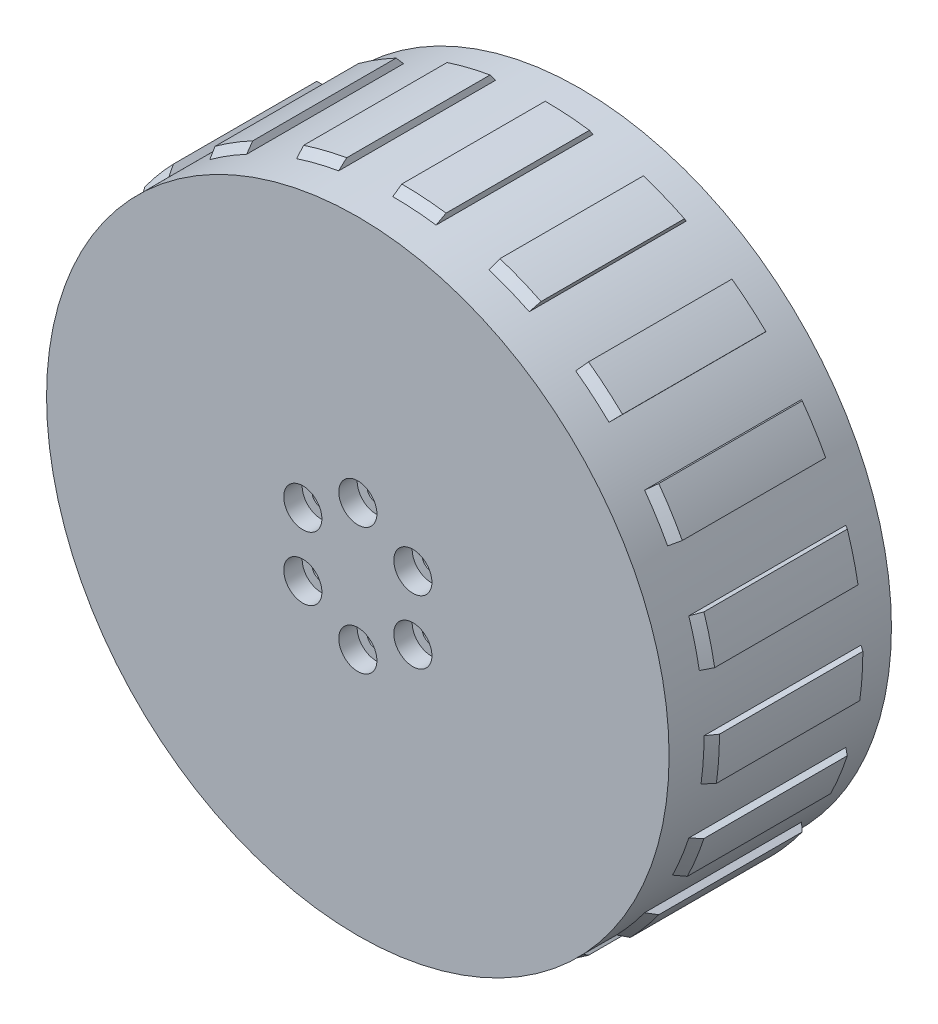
ISO-10303-21;
HEADER;
FILE_DESCRIPTION(('STEP AP214'),'2;1');
FILE_NAME('part.step','',(''),(''),'','','');
FILE_SCHEMA(('AUTOMOTIVE_DESIGN { 1 0 10303 214 1 1 1 1 }'));
ENDSEC;
DATA;
#1=APPLICATION_CONTEXT('core data for automotive mechanical design processes');
#2=APPLICATION_PROTOCOL_DEFINITION('international standard','automotive_design',2000,#1);
#3=PRODUCT_CONTEXT('',#1,'mechanical');
#4=PRODUCT('Part','Part','',(#3));
#5=PRODUCT_RELATED_PRODUCT_CATEGORY('part','',(#4));
#6=PRODUCT_DEFINITION_FORMATION('','',#4);
#7=PRODUCT_DEFINITION_CONTEXT('part definition',#1,'design');
#8=PRODUCT_DEFINITION('design','',#6,#7);
#9=PRODUCT_DEFINITION_SHAPE('','',#8);
#10=(LENGTH_UNIT() NAMED_UNIT(*) SI_UNIT(.MILLI.,.METRE.));
#11=(NAMED_UNIT(*) PLANE_ANGLE_UNIT() SI_UNIT($,.RADIAN.));
#12=(NAMED_UNIT(*) SI_UNIT($,.STERADIAN.) SOLID_ANGLE_UNIT());
#13=UNCERTAINTY_MEASURE_WITH_UNIT(LENGTH_MEASURE(1.E-05),#10,'distance_accuracy_value','');
#14=(GEOMETRIC_REPRESENTATION_CONTEXT(3) GLOBAL_UNCERTAINTY_ASSIGNED_CONTEXT((#13)) GLOBAL_UNIT_ASSIGNED_CONTEXT((#10,
#11,#12)) REPRESENTATION_CONTEXT('',''));
#15=CARTESIAN_POINT('',(0.,0.,0.));
#16=DIRECTION('',(0.,0.,1.));
#17=DIRECTION('',(1.,0.,0.));
#18=AXIS2_PLACEMENT_3D('',#15,#16,#17);
#19=CARTESIAN_POINT('',(0.,0.,-25.));
#20=DIRECTION('',(0.,0.,1.));
#21=DIRECTION('',(1.,0.,0.));
#22=AXIS2_PLACEMENT_3D('',#19,#20,#21);
#23=CYLINDRICAL_SURFACE('',#22,49.);
#24=CARTESIAN_POINT('',(0.,0.,-25.));
#25=DIRECTION('',(0.,0.,1.));
#26=DIRECTION('',(1.,0.,0.));
#27=AXIS2_PLACEMENT_3D('',#24,#25,#26);
#28=CIRCLE('',#27,49.);
#29=CARTESIAN_POINT('',(49.,0.,-25.));
#30=VERTEX_POINT('',#29);
#31=EDGE_CURVE('E645',#30,#30,#28,.T.);
#32=ORIENTED_EDGE('',*,*,#31,.T.);
#33=EDGE_LOOP('',(#32));
#34=FACE_BOUND('',#33,.T.);
#35=CARTESIAN_POINT('',(0.,0.,10.));
#36=DIRECTION('',(0.,0.,1.));
#37=DIRECTION('',(1.,0.,0.));
#38=AXIS2_PLACEMENT_3D('',#35,#36,#37);
#39=CIRCLE('',#38,49.);
#40=CARTESIAN_POINT('',(49.,0.,10.));
#41=VERTEX_POINT('',#40);
#42=EDGE_CURVE('E641',#41,#41,#39,.T.);
#43=ORIENTED_EDGE('',*,*,#42,.F.);
#44=EDGE_LOOP('',(#43));
#45=FACE_BOUND('',#44,.T.);
#46=DIRECTION('',(0.,0.,-1.));
#47=VECTOR('',#46,1.);
#48=CARTESIAN_POINT('',(6.81948194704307,48.5231353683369,4.5));
#49=LINE('',#48,#47);
#50=CARTESIAN_POINT('',(6.81948194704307,48.523135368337,4.5));
#51=VERTEX_POINT('',#50);
#52=CARTESIAN_POINT('',(6.81948194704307,48.5231353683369,-20.2002075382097));
#53=VERTEX_POINT('',#52);
#54=EDGE_CURVE('E541',#51,#53,#49,.T.);
#55=ORIENTED_EDGE('',*,*,#54,.F.);
#56=CARTESIAN_POINT('',(0.,0.,4.5));
#57=DIRECTION('',(0.,0.,-1.));
#58=DIRECTION('',(-1.,0.,0.));
#59=AXIS2_PLACEMENT_3D('',#56,#57,#58);
#60=CIRCLE('',#59,49.);
#61=CARTESIAN_POINT('',(0.,49.,4.5));
#62=VERTEX_POINT('',#61);
#63=EDGE_CURVE('E555',#62,#51,#60,.T.);
#64=ORIENTED_EDGE('',*,*,#63,.F.);
#65=DIRECTION('',(0.,0.,-1.));
#66=VECTOR('',#65,1.);
#67=CARTESIAN_POINT('',(0.,49.,4.5));
#68=LINE('',#67,#66);
#69=CARTESIAN_POINT('',(0.,49.,-20.2002075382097));
#70=VERTEX_POINT('',#69);
#71=EDGE_CURVE('E559',#62,#70,#68,.T.);
#72=ORIENTED_EDGE('',*,*,#71,.T.);
#73=CARTESIAN_POINT('',(0.,0.,-20.2002075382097));
#74=DIRECTION('',(0.,0.,1.));
#75=DIRECTION('',(1.,0.,0.));
#76=AXIS2_PLACEMENT_3D('',#73,#74,#75);
#77=CIRCLE('',#76,49.);
#78=EDGE_CURVE('E558',#70,#53,#77,.F.);
#79=ORIENTED_EDGE('',*,*,#78,.T.);
#80=EDGE_LOOP('',(#55,#64,#72,#79));
#81=FACE_BOUND('',#80,.T.);
#82=DIRECTION('',(0.,0.,-1.));
#83=VECTOR('',#82,1.);
#84=CARTESIAN_POINT('',(21.4801861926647,44.0409082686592,4.5));
#85=LINE('',#84,#83);
#86=CARTESIAN_POINT('',(21.4801861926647,44.0409082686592,4.5));
#87=VERTEX_POINT('',#86);
#88=CARTESIAN_POINT('',(21.4801861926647,44.0409082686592,-20.2002075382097));
#89=VERTEX_POINT('',#88);
#90=EDGE_CURVE('E570',#87,#89,#85,.T.);
#91=ORIENTED_EDGE('',*,*,#90,.F.);
#92=CARTESIAN_POINT('',(0.,0.,4.5));
#93=DIRECTION('',(0.,0.,-1.));
#94=DIRECTION('',(-0.951056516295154,0.309016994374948,0.));
#95=AXIS2_PLACEMENT_3D('',#92,#93,#94);
#96=CIRCLE('',#95,49.);
#97=CARTESIAN_POINT('',(15.1418327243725,46.6017692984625,4.5));
#98=VERTEX_POINT('',#97);
#99=EDGE_CURVE('E1252',#98,#87,#96,.T.);
#100=ORIENTED_EDGE('',*,*,#99,.F.);
#101=DIRECTION('',(0.,0.,-1.));
#102=VECTOR('',#101,1.);
#103=CARTESIAN_POINT('',(15.1418327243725,46.6017692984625,4.5));
#104=LINE('',#103,#102);
#105=CARTESIAN_POINT('',(15.1418327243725,46.6017692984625,-20.2002075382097));
#106=VERTEX_POINT('',#105);
#107=EDGE_CURVE('E565',#98,#106,#104,.T.);
#108=ORIENTED_EDGE('',*,*,#107,.T.);
#109=CARTESIAN_POINT('',(0.,0.,-20.2002075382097));
#110=DIRECTION('',(0.,0.,1.));
#111=DIRECTION('',(1.,0.,0.));
#112=AXIS2_PLACEMENT_3D('',#109,#110,#111);
#113=CIRCLE('',#112,49.);
#114=EDGE_CURVE('E694',#106,#89,#113,.F.);
#115=ORIENTED_EDGE('',*,*,#114,.T.);
#116=EDGE_LOOP('',(#91,#100,#108,#115));
#117=FACE_BOUND('',#116,.T.);
#118=DIRECTION('',(0.,0.,-1.));
#119=VECTOR('',#118,1.);
#120=CARTESIAN_POINT('',(34.0382601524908,35.2476502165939,4.5));
#121=LINE('',#120,#119);
#122=CARTESIAN_POINT('',(34.0382601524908,35.247650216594,4.5));
#123=VERTEX_POINT('',#122);
#124=CARTESIAN_POINT('',(34.0382601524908,35.2476502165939,-20.2002075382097));
#125=VERTEX_POINT('',#124);
#126=EDGE_CURVE('E1253',#123,#125,#121,.T.);
#127=ORIENTED_EDGE('',*,*,#126,.F.);
#128=CARTESIAN_POINT('',(0.,0.,4.5));
#129=DIRECTION('',(0.,0.,-1.));
#130=DIRECTION('',(-0.809016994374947,0.587785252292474,0.));
#131=AXIS2_PLACEMENT_3D('',#128,#129,#130);
#132=CIRCLE('',#131,49.);
#133=CARTESIAN_POINT('',(28.8014773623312,39.6418327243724,4.5));
#134=VERTEX_POINT('',#133);
#135=EDGE_CURVE('E1237',#134,#123,#132,.T.);
#136=ORIENTED_EDGE('',*,*,#135,.F.);
#137=DIRECTION('',(0.,0.,-1.));
#138=VECTOR('',#137,1.);
#139=CARTESIAN_POINT('',(28.8014773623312,39.6418327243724,4.5));
#140=LINE('',#139,#138);
#141=CARTESIAN_POINT('',(28.8014773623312,39.6418327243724,-20.2002075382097));
#142=VERTEX_POINT('',#141);
#143=EDGE_CURVE('E1249',#134,#142,#140,.T.);
#144=ORIENTED_EDGE('',*,*,#143,.T.);
#145=CARTESIAN_POINT('',(0.,0.,-20.2002075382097));
#146=DIRECTION('',(0.,0.,1.));
#147=DIRECTION('',(1.,0.,0.));
#148=AXIS2_PLACEMENT_3D('',#145,#146,#147);
#149=CIRCLE('',#148,49.);
#150=EDGE_CURVE('E710',#142,#125,#149,.F.);
#151=ORIENTED_EDGE('',*,*,#150,.T.);
#152=EDGE_LOOP('',(#127,#136,#144,#151));
#153=FACE_BOUND('',#152,.T.);
#154=DIRECTION('',(0.,0.,-1.));
#155=VECTOR('',#154,1.);
#156=CARTESIAN_POINT('',(43.2644320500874,23.0041065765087,4.5));
#157=LINE('',#156,#155);
#158=CARTESIAN_POINT('',(43.2644320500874,23.0041065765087,4.5));
#159=VERTEX_POINT('',#158);
#160=CARTESIAN_POINT('',(43.2644320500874,23.0041065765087,-20.2002075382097));
#161=VERTEX_POINT('',#160);
#162=EDGE_CURVE('E1238',#159,#161,#157,.T.);
#163=ORIENTED_EDGE('',*,*,#162,.F.);
#164=CARTESIAN_POINT('',(0.,0.,4.5));
#165=DIRECTION('',(0.,0.,-1.));
#166=DIRECTION('',(-0.587785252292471,0.809016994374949,0.));
#167=AXIS2_PLACEMENT_3D('',#164,#165,#166);
#168=CIRCLE('',#167,49.);
#169=CARTESIAN_POINT('',(39.6418327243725,28.8014773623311,4.5));
#170=VERTEX_POINT('',#169);
#171=EDGE_CURVE('E1222',#170,#159,#168,.T.);
#172=ORIENTED_EDGE('',*,*,#171,.F.);
#173=DIRECTION('',(0.,0.,-1.));
#174=VECTOR('',#173,1.);
#175=CARTESIAN_POINT('',(39.6418327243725,28.8014773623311,4.5));
#176=LINE('',#175,#174);
#177=CARTESIAN_POINT('',(39.6418327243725,28.8014773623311,-20.2002075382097));
#178=VERTEX_POINT('',#177);
#179=EDGE_CURVE('E1234',#170,#178,#176,.T.);
#180=ORIENTED_EDGE('',*,*,#179,.T.);
#181=CARTESIAN_POINT('',(0.,0.,-20.2002075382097));
#182=DIRECTION('',(0.,0.,1.));
#183=DIRECTION('',(1.,0.,0.));
#184=AXIS2_PLACEMENT_3D('',#181,#182,#183);
#185=CIRCLE('',#184,49.);
#186=EDGE_CURVE('E726',#178,#161,#185,.F.);
#187=ORIENTED_EDGE('',*,*,#186,.T.);
#188=EDGE_LOOP('',(#163,#172,#180,#187));
#189=FACE_BOUND('',#188,.T.);
#190=DIRECTION('',(0.,0.,-1.));
#191=VECTOR('',#190,1.);
#192=CARTESIAN_POINT('',(48.2555798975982,8.50876070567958,4.5));
#193=LINE('',#192,#191);
#194=CARTESIAN_POINT('',(48.2555798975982,8.50876070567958,4.5));
#195=VERTEX_POINT('',#194);
#196=CARTESIAN_POINT('',(48.2555798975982,8.50876070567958,-20.2002075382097));
#197=VERTEX_POINT('',#196);
#198=EDGE_CURVE('E1223',#195,#197,#193,.T.);
#199=ORIENTED_EDGE('',*,*,#198,.F.);
#200=CARTESIAN_POINT('',(0.,0.,4.5));
#201=DIRECTION('',(0.,0.,-1.));
#202=DIRECTION('',(-0.309016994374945,0.951056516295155,0.));
#203=AXIS2_PLACEMENT_3D('',#200,#201,#202);
#204=CIRCLE('',#203,49.);
#205=CARTESIAN_POINT('',(46.6017692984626,15.1418327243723,4.5));
#206=VERTEX_POINT('',#205);
#207=EDGE_CURVE('E1207',#206,#195,#204,.T.);
#208=ORIENTED_EDGE('',*,*,#207,.F.);
#209=DIRECTION('',(0.,0.,-1.));
#210=VECTOR('',#209,1.);
#211=CARTESIAN_POINT('',(46.6017692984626,15.1418327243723,4.5));
#212=LINE('',#211,#210);
#213=CARTESIAN_POINT('',(46.6017692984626,15.1418327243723,-20.2002075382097));
#214=VERTEX_POINT('',#213);
#215=EDGE_CURVE('E1219',#206,#214,#212,.T.);
#216=ORIENTED_EDGE('',*,*,#215,.T.);
#217=CARTESIAN_POINT('',(0.,0.,-20.2002075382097));
#218=DIRECTION('',(0.,0.,1.));
#219=DIRECTION('',(1.,0.,0.));
#220=AXIS2_PLACEMENT_3D('',#217,#218,#219);
#221=CIRCLE('',#220,49.);
#222=EDGE_CURVE('E742',#214,#197,#221,.F.);
#223=ORIENTED_EDGE('',*,*,#222,.T.);
#224=EDGE_LOOP('',(#199,#208,#216,#223));
#225=FACE_BOUND('',#224,.T.);
#226=DIRECTION('',(0.,0.,-1.));
#227=VECTOR('',#226,1.);
#228=CARTESIAN_POINT('',(48.5231353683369,-6.81948194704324,4.5));
#229=LINE('',#228,#227);
#230=CARTESIAN_POINT('',(48.5231353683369,-6.81948194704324,4.5));
#231=VERTEX_POINT('',#230);
#232=CARTESIAN_POINT('',(48.5231353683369,-6.81948194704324,-20.2002075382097));
#233=VERTEX_POINT('',#232);
#234=EDGE_CURVE('E1208',#231,#233,#229,.T.);
#235=ORIENTED_EDGE('',*,*,#234,.F.);
#236=CARTESIAN_POINT('',(0.,0.,4.5));
#237=DIRECTION('',(0.,0.,-1.));
#238=DIRECTION('',(0.,1.,0.));
#239=AXIS2_PLACEMENT_3D('',#236,#237,#238);
#240=CIRCLE('',#239,49.);
#241=CARTESIAN_POINT('',(49.,-1.71082585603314E-13,4.5));
#242=VERTEX_POINT('',#241);
#243=EDGE_CURVE('E1192',#242,#231,#240,.T.);
#244=ORIENTED_EDGE('',*,*,#243,.F.);
#245=DIRECTION('',(0.,0.,-1.));
#246=VECTOR('',#245,1.);
#247=CARTESIAN_POINT('',(49.,-1.71082585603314E-13,4.5));
#248=LINE('',#247,#246);
#249=CARTESIAN_POINT('',(49.,-1.71082585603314E-13,-20.2002075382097));
#250=VERTEX_POINT('',#249);
#251=EDGE_CURVE('E1204',#242,#250,#248,.T.);
#252=ORIENTED_EDGE('',*,*,#251,.T.);
#253=CARTESIAN_POINT('',(0.,0.,-20.2002075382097));
#254=DIRECTION('',(0.,0.,1.));
#255=DIRECTION('',(1.,0.,0.));
#256=AXIS2_PLACEMENT_3D('',#253,#254,#255);
#257=CIRCLE('',#256,49.);
#258=EDGE_CURVE('E758',#250,#233,#257,.F.);
#259=ORIENTED_EDGE('',*,*,#258,.T.);
#260=EDGE_LOOP('',(#235,#244,#252,#259));
#261=FACE_BOUND('',#260,.T.);
#262=DIRECTION('',(0.,0.,-1.));
#263=VECTOR('',#262,1.);
#264=CARTESIAN_POINT('',(44.0409082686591,-21.4801861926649,4.5));
#265=LINE('',#264,#263);
#266=CARTESIAN_POINT('',(44.0409082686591,-21.4801861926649,4.5));
#267=VERTEX_POINT('',#266);
#268=CARTESIAN_POINT('',(44.0409082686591,-21.4801861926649,-20.2002075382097));
#269=VERTEX_POINT('',#268);
#270=EDGE_CURVE('E1193',#267,#269,#265,.T.);
#271=ORIENTED_EDGE('',*,*,#270,.F.);
#272=CARTESIAN_POINT('',(0.,0.,4.5));
#273=DIRECTION('',(0.,0.,-1.));
#274=DIRECTION('',(0.309016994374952,0.951056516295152,0.));
#275=AXIS2_PLACEMENT_3D('',#272,#273,#274);
#276=CIRCLE('',#275,49.);
#277=CARTESIAN_POINT('',(46.6017692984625,-15.1418327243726,4.5));
#278=VERTEX_POINT('',#277);
#279=EDGE_CURVE('E1177',#278,#267,#276,.T.);
#280=ORIENTED_EDGE('',*,*,#279,.F.);
#281=DIRECTION('',(0.,0.,-1.));
#282=VECTOR('',#281,1.);
#283=CARTESIAN_POINT('',(46.6017692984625,-15.1418327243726,4.5));
#284=LINE('',#283,#282);
#285=CARTESIAN_POINT('',(46.6017692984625,-15.1418327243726,-20.2002075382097));
#286=VERTEX_POINT('',#285);
#287=EDGE_CURVE('E1189',#278,#286,#284,.T.);
#288=ORIENTED_EDGE('',*,*,#287,.T.);
#289=CARTESIAN_POINT('',(0.,0.,-20.2002075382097));
#290=DIRECTION('',(0.,0.,1.));
#291=DIRECTION('',(1.,0.,0.));
#292=AXIS2_PLACEMENT_3D('',#289,#290,#291);
#293=CIRCLE('',#292,49.);
#294=EDGE_CURVE('E774',#286,#269,#293,.F.);
#295=ORIENTED_EDGE('',*,*,#294,.T.);
#296=EDGE_LOOP('',(#271,#280,#288,#295));
#297=FACE_BOUND('',#296,.T.);
#298=DIRECTION('',(0.,0.,-1.));
#299=VECTOR('',#298,1.);
#300=CARTESIAN_POINT('',(35.2476502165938,-34.0382601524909,4.5));
#301=LINE('',#300,#299);
#302=CARTESIAN_POINT('',(35.2476502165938,-34.0382601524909,4.5));
#303=VERTEX_POINT('',#302);
#304=CARTESIAN_POINT('',(35.2476502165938,-34.0382601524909,-20.2002075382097));
#305=VERTEX_POINT('',#304);
#306=EDGE_CURVE('E1178',#303,#305,#301,.T.);
#307=ORIENTED_EDGE('',*,*,#306,.F.);
#308=CARTESIAN_POINT('',(0.,0.,4.5));
#309=DIRECTION('',(0.,0.,-1.));
#310=DIRECTION('',(0.587785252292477,0.809016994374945,0.));
#311=AXIS2_PLACEMENT_3D('',#308,#309,#310);
#312=CIRCLE('',#311,49.);
#313=CARTESIAN_POINT('',(39.6418327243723,-28.8014773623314,4.5));
#314=VERTEX_POINT('',#313);
#315=EDGE_CURVE('E1162',#314,#303,#312,.T.);
#316=ORIENTED_EDGE('',*,*,#315,.F.);
#317=DIRECTION('',(0.,0.,-1.));
#318=VECTOR('',#317,1.);
#319=CARTESIAN_POINT('',(39.6418327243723,-28.8014773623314,4.5));
#320=LINE('',#319,#318);
#321=CARTESIAN_POINT('',(39.6418327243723,-28.8014773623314,-20.2002075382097));
#322=VERTEX_POINT('',#321);
#323=EDGE_CURVE('E1174',#314,#322,#320,.T.);
#324=ORIENTED_EDGE('',*,*,#323,.T.);
#325=CARTESIAN_POINT('',(0.,0.,-20.2002075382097));
#326=DIRECTION('',(0.,0.,1.));
#327=DIRECTION('',(1.,0.,0.));
#328=AXIS2_PLACEMENT_3D('',#325,#326,#327);
#329=CIRCLE('',#328,49.);
#330=EDGE_CURVE('E790',#322,#305,#329,.F.);
#331=ORIENTED_EDGE('',*,*,#330,.T.);
#332=EDGE_LOOP('',(#307,#316,#324,#331));
#333=FACE_BOUND('',#332,.T.);
#334=DIRECTION('',(0.,0.,-1.));
#335=VECTOR('',#334,1.);
#336=CARTESIAN_POINT('',(23.0041065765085,-43.2644320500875,4.5));
#337=LINE('',#336,#335);
#338=CARTESIAN_POINT('',(23.0041065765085,-43.2644320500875,4.5));
#339=VERTEX_POINT('',#338);
#340=CARTESIAN_POINT('',(23.0041065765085,-43.2644320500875,-20.2002075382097));
#341=VERTEX_POINT('',#340);
#342=EDGE_CURVE('E1163',#339,#341,#337,.T.);
#343=ORIENTED_EDGE('',*,*,#342,.F.);
#344=CARTESIAN_POINT('',(0.,0.,4.5));
#345=DIRECTION('',(0.,0.,-1.));
#346=DIRECTION('',(0.809016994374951,0.587785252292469,0.));
#347=AXIS2_PLACEMENT_3D('',#344,#345,#346);
#348=CIRCLE('',#347,49.);
#349=CARTESIAN_POINT('',(28.801477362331,-39.6418327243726,4.5));
#350=VERTEX_POINT('',#349);
#351=EDGE_CURVE('E1147',#350,#339,#348,.T.);
#352=ORIENTED_EDGE('',*,*,#351,.F.);
#353=DIRECTION('',(0.,0.,-1.));
#354=VECTOR('',#353,1.);
#355=CARTESIAN_POINT('',(28.801477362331,-39.6418327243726,4.5));
#356=LINE('',#355,#354);
#357=CARTESIAN_POINT('',(28.801477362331,-39.6418327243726,-20.2002075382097));
#358=VERTEX_POINT('',#357);
#359=EDGE_CURVE('E1159',#350,#358,#356,.T.);
#360=ORIENTED_EDGE('',*,*,#359,.T.);
#361=CARTESIAN_POINT('',(0.,0.,-20.2002075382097));
#362=DIRECTION('',(0.,0.,1.));
#363=DIRECTION('',(1.,0.,0.));
#364=AXIS2_PLACEMENT_3D('',#361,#362,#363);
#365=CIRCLE('',#364,49.);
#366=EDGE_CURVE('E806',#358,#341,#365,.F.);
#367=ORIENTED_EDGE('',*,*,#366,.T.);
#368=EDGE_LOOP('',(#343,#352,#360,#367));
#369=FACE_BOUND('',#368,.T.);
#370=DIRECTION('',(0.,0.,-1.));
#371=VECTOR('',#370,1.);
#372=CARTESIAN_POINT('',(8.5087607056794,-48.2555798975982,4.5));
#373=LINE('',#372,#371);
#374=CARTESIAN_POINT('',(8.5087607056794,-48.2555798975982,4.5));
#375=VERTEX_POINT('',#374);
#376=CARTESIAN_POINT('',(8.5087607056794,-48.2555798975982,-20.2002075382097));
#377=VERTEX_POINT('',#376);
#378=EDGE_CURVE('E1148',#375,#377,#373,.T.);
#379=ORIENTED_EDGE('',*,*,#378,.F.);
#380=CARTESIAN_POINT('',(0.,0.,4.5));
#381=DIRECTION('',(0.,0.,-1.));
#382=DIRECTION('',(0.951056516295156,0.309016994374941,0.));
#383=AXIS2_PLACEMENT_3D('',#380,#381,#382);
#384=CIRCLE('',#383,49.);
#385=CARTESIAN_POINT('',(15.1418327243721,-46.6017692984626,4.5));
#386=VERTEX_POINT('',#385);
#387=EDGE_CURVE('E1132',#386,#375,#384,.T.);
#388=ORIENTED_EDGE('',*,*,#387,.F.);
#389=DIRECTION('',(0.,0.,-1.));
#390=VECTOR('',#389,1.);
#391=CARTESIAN_POINT('',(15.1418327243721,-46.6017692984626,4.5));
#392=LINE('',#391,#390);
#393=CARTESIAN_POINT('',(15.1418327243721,-46.6017692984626,-20.2002075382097));
#394=VERTEX_POINT('',#393);
#395=EDGE_CURVE('E1144',#386,#394,#392,.T.);
#396=ORIENTED_EDGE('',*,*,#395,.T.);
#397=CARTESIAN_POINT('',(0.,0.,-20.2002075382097));
#398=DIRECTION('',(0.,0.,1.));
#399=DIRECTION('',(1.,0.,0.));
#400=AXIS2_PLACEMENT_3D('',#397,#398,#399);
#401=CIRCLE('',#400,49.);
#402=EDGE_CURVE('E822',#394,#377,#401,.F.);
#403=ORIENTED_EDGE('',*,*,#402,.T.);
#404=EDGE_LOOP('',(#379,#388,#396,#403));
#405=FACE_BOUND('',#404,.T.);
#406=DIRECTION('',(0.,0.,-1.));
#407=VECTOR('',#406,1.);
#408=CARTESIAN_POINT('',(-6.81948194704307,-48.5231353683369,4.5));
#409=LINE('',#408,#407);
#410=CARTESIAN_POINT('',(-6.81948194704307,-48.523135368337,4.5));
#411=VERTEX_POINT('',#410);
#412=CARTESIAN_POINT('',(-6.81948194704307,-48.5231353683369,-20.2002075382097));
#413=VERTEX_POINT('',#412);
#414=EDGE_CURVE('E1133',#411,#413,#409,.T.);
#415=ORIENTED_EDGE('',*,*,#414,.F.);
#416=CARTESIAN_POINT('',(0.,0.,4.5));
#417=DIRECTION('',(0.,0.,-1.));
#418=DIRECTION('',(1.,0.,0.));
#419=AXIS2_PLACEMENT_3D('',#416,#417,#418);
#420=CIRCLE('',#419,49.);
#421=CARTESIAN_POINT('',(0.,-49.,4.5));
#422=VERTEX_POINT('',#421);
#423=EDGE_CURVE('E1117',#422,#411,#420,.T.);
#424=ORIENTED_EDGE('',*,*,#423,.F.);
#425=DIRECTION('',(0.,0.,-1.));
#426=VECTOR('',#425,1.);
#427=CARTESIAN_POINT('',(0.,-49.,4.5));
#428=LINE('',#427,#426);
#429=CARTESIAN_POINT('',(0.,-49.,-20.2002075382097));
#430=VERTEX_POINT('',#429);
#431=EDGE_CURVE('E1129',#422,#430,#428,.T.);
#432=ORIENTED_EDGE('',*,*,#431,.T.);
#433=CARTESIAN_POINT('',(0.,0.,-20.2002075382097));
#434=DIRECTION('',(0.,0.,1.));
#435=DIRECTION('',(1.,0.,0.));
#436=AXIS2_PLACEMENT_3D('',#433,#434,#435);
#437=CIRCLE('',#436,49.);
#438=EDGE_CURVE('E838',#430,#413,#437,.F.);
#439=ORIENTED_EDGE('',*,*,#438,.T.);
#440=EDGE_LOOP('',(#415,#424,#432,#439));
#441=FACE_BOUND('',#440,.T.);
#442=DIRECTION('',(0.,0.,-1.));
#443=VECTOR('',#442,1.);
#444=CARTESIAN_POINT('',(-21.480186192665,-44.0409082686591,4.5));
#445=LINE('',#444,#443);
#446=CARTESIAN_POINT('',(-21.480186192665,-44.0409082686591,4.5));
#447=VERTEX_POINT('',#446);
#448=CARTESIAN_POINT('',(-21.480186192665,-44.0409082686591,-20.2002075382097));
#449=VERTEX_POINT('',#448);
#450=EDGE_CURVE('E1118',#447,#449,#445,.T.);
#451=ORIENTED_EDGE('',*,*,#450,.F.);
#452=CARTESIAN_POINT('',(0.,0.,4.5));
#453=DIRECTION('',(0.,0.,-1.));
#454=DIRECTION('',(0.951056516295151,-0.309016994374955,0.));
#455=AXIS2_PLACEMENT_3D('',#452,#453,#454);
#456=CIRCLE('',#455,49.);
#457=CARTESIAN_POINT('',(-15.1418327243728,-46.6017692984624,4.5));
#458=VERTEX_POINT('',#457);
#459=EDGE_CURVE('E1102',#458,#447,#456,.T.);
#460=ORIENTED_EDGE('',*,*,#459,.F.);
#461=DIRECTION('',(0.,0.,-1.));
#462=VECTOR('',#461,1.);
#463=CARTESIAN_POINT('',(-15.1418327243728,-46.6017692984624,4.5));
#464=LINE('',#463,#462);
#465=CARTESIAN_POINT('',(-15.1418327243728,-46.6017692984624,-20.2002075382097));
#466=VERTEX_POINT('',#465);
#467=EDGE_CURVE('E1114',#458,#466,#464,.T.);
#468=ORIENTED_EDGE('',*,*,#467,.T.);
#469=CARTESIAN_POINT('',(0.,0.,-20.2002075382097));
#470=DIRECTION('',(0.,0.,1.));
#471=DIRECTION('',(1.,0.,0.));
#472=AXIS2_PLACEMENT_3D('',#469,#470,#471);
#473=CIRCLE('',#472,49.);
#474=EDGE_CURVE('E854',#466,#449,#473,.F.);
#475=ORIENTED_EDGE('',*,*,#474,.T.);
#476=EDGE_LOOP('',(#451,#460,#468,#475));
#477=FACE_BOUND('',#476,.T.);
#478=DIRECTION('',(0.,0.,-1.));
#479=VECTOR('',#478,1.);
#480=CARTESIAN_POINT('',(-34.0382601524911,-35.2476502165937,4.5));
#481=LINE('',#480,#479);
#482=CARTESIAN_POINT('',(-34.0382601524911,-35.2476502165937,4.5));
#483=VERTEX_POINT('',#482);
#484=CARTESIAN_POINT('',(-34.0382601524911,-35.2476502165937,-20.2002075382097));
#485=VERTEX_POINT('',#484);
#486=EDGE_CURVE('E1103',#483,#485,#481,.T.);
#487=ORIENTED_EDGE('',*,*,#486,.F.);
#488=CARTESIAN_POINT('',(0.,0.,4.5));
#489=DIRECTION('',(0.,0.,-1.));
#490=DIRECTION('',(0.809016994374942,-0.58778525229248,0.));
#491=AXIS2_PLACEMENT_3D('',#488,#489,#490);
#492=CIRCLE('',#491,49.);
#493=CARTESIAN_POINT('',(-28.8014773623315,-39.6418327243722,4.5));
#494=VERTEX_POINT('',#493);
#495=EDGE_CURVE('E1087',#494,#483,#492,.T.);
#496=ORIENTED_EDGE('',*,*,#495,.F.);
#497=DIRECTION('',(0.,0.,-1.));
#498=VECTOR('',#497,1.);
#499=CARTESIAN_POINT('',(-28.8014773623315,-39.6418327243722,4.5));
#500=LINE('',#499,#498);
#501=CARTESIAN_POINT('',(-28.8014773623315,-39.6418327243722,-20.2002075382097));
#502=VERTEX_POINT('',#501);
#503=EDGE_CURVE('E1099',#494,#502,#500,.T.);
#504=ORIENTED_EDGE('',*,*,#503,.T.);
#505=CARTESIAN_POINT('',(0.,0.,-20.2002075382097));
#506=DIRECTION('',(0.,0.,1.));
#507=DIRECTION('',(1.,0.,0.));
#508=AXIS2_PLACEMENT_3D('',#505,#506,#507);
#509=CIRCLE('',#508,49.);
#510=EDGE_CURVE('E870',#502,#485,#509,.F.);
#511=ORIENTED_EDGE('',*,*,#510,.T.);
#512=EDGE_LOOP('',(#487,#496,#504,#511));
#513=FACE_BOUND('',#512,.T.);
#514=DIRECTION('',(0.,0.,-1.));
#515=VECTOR('',#514,1.);
#516=CARTESIAN_POINT('',(-43.2644320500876,-23.0041065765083,4.5));
#517=LINE('',#516,#515);
#518=CARTESIAN_POINT('',(-43.2644320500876,-23.0041065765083,4.5));
#519=VERTEX_POINT('',#518);
#520=CARTESIAN_POINT('',(-43.2644320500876,-23.0041065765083,-20.2002075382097));
#521=VERTEX_POINT('',#520);
#522=EDGE_CURVE('E1088',#519,#521,#517,.T.);
#523=ORIENTED_EDGE('',*,*,#522,.F.);
#524=CARTESIAN_POINT('',(0.,0.,4.5));
#525=DIRECTION('',(0.,0.,-1.));
#526=DIRECTION('',(0.587785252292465,-0.809016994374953,0.));
#527=AXIS2_PLACEMENT_3D('',#524,#525,#526);
#528=CIRCLE('',#527,49.);
#529=CARTESIAN_POINT('',(-39.6418327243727,-28.8014773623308,4.5));
#530=VERTEX_POINT('',#529);
#531=EDGE_CURVE('E1072',#530,#519,#528,.T.);
#532=ORIENTED_EDGE('',*,*,#531,.F.);
#533=DIRECTION('',(0.,0.,-1.));
#534=VECTOR('',#533,1.);
#535=CARTESIAN_POINT('',(-39.6418327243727,-28.8014773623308,4.5));
#536=LINE('',#535,#534);
#537=CARTESIAN_POINT('',(-39.6418327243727,-28.8014773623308,-20.2002075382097));
#538=VERTEX_POINT('',#537);
#539=EDGE_CURVE('E1084',#530,#538,#536,.T.);
#540=ORIENTED_EDGE('',*,*,#539,.T.);
#541=CARTESIAN_POINT('',(0.,0.,-20.2002075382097));
#542=DIRECTION('',(0.,0.,1.));
#543=DIRECTION('',(1.,0.,0.));
#544=AXIS2_PLACEMENT_3D('',#541,#542,#543);
#545=CIRCLE('',#544,49.);
#546=EDGE_CURVE('E886',#538,#521,#545,.F.);
#547=ORIENTED_EDGE('',*,*,#546,.T.);
#548=EDGE_LOOP('',(#523,#532,#540,#547));
#549=FACE_BOUND('',#548,.T.);
#550=DIRECTION('',(0.,0.,-1.));
#551=VECTOR('',#550,1.);
#552=CARTESIAN_POINT('',(-48.2555798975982,-8.50876070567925,4.5));
#553=LINE('',#552,#551);
#554=CARTESIAN_POINT('',(-48.2555798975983,-8.50876070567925,4.5));
#555=VERTEX_POINT('',#554);
#556=CARTESIAN_POINT('',(-48.2555798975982,-8.50876070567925,-20.2002075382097));
#557=VERTEX_POINT('',#556);
#558=EDGE_CURVE('E1073',#555,#557,#553,.T.);
#559=ORIENTED_EDGE('',*,*,#558,.F.);
#560=CARTESIAN_POINT('',(0.,0.,4.5));
#561=DIRECTION('',(0.,0.,-1.));
#562=DIRECTION('',(0.309016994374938,-0.951056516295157,0.));
#563=AXIS2_PLACEMENT_3D('',#560,#561,#562);
#564=CIRCLE('',#563,49.);
#565=CARTESIAN_POINT('',(-46.6017692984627,-15.141832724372,4.5));
#566=VERTEX_POINT('',#565);
#567=EDGE_CURVE('E1057',#566,#555,#564,.T.);
#568=ORIENTED_EDGE('',*,*,#567,.F.);
#569=DIRECTION('',(0.,0.,-1.));
#570=VECTOR('',#569,1.);
#571=CARTESIAN_POINT('',(-46.6017692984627,-15.141832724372,4.5));
#572=LINE('',#571,#570);
#573=CARTESIAN_POINT('',(-46.6017692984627,-15.141832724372,-20.2002075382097));
#574=VERTEX_POINT('',#573);
#575=EDGE_CURVE('E1069',#566,#574,#572,.T.);
#576=ORIENTED_EDGE('',*,*,#575,.T.);
#577=CARTESIAN_POINT('',(0.,0.,-20.2002075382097));
#578=DIRECTION('',(0.,0.,1.));
#579=DIRECTION('',(1.,0.,0.));
#580=AXIS2_PLACEMENT_3D('',#577,#578,#579);
#581=CIRCLE('',#580,49.);
#582=EDGE_CURVE('E902',#574,#557,#581,.F.);
#583=ORIENTED_EDGE('',*,*,#582,.T.);
#584=EDGE_LOOP('',(#559,#568,#576,#583));
#585=FACE_BOUND('',#584,.T.);
#586=DIRECTION('',(0.,0.,-1.));
#587=VECTOR('',#586,1.);
#588=CARTESIAN_POINT('',(-48.5231353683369,6.81948194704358,4.5));
#589=LINE('',#588,#587);
#590=CARTESIAN_POINT('',(-48.5231353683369,6.81948194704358,4.5));
#591=VERTEX_POINT('',#590);
#592=CARTESIAN_POINT('',(-48.5231353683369,6.81948194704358,-20.2002075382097));
#593=VERTEX_POINT('',#592);
#594=EDGE_CURVE('E1058',#591,#593,#589,.T.);
#595=ORIENTED_EDGE('',*,*,#594,.F.);
#596=CARTESIAN_POINT('',(0.,0.,4.5));
#597=DIRECTION('',(0.,0.,-1.));
#598=DIRECTION('',(0.,-1.,0.));
#599=AXIS2_PLACEMENT_3D('',#596,#597,#598);
#600=CIRCLE('',#599,49.);
#601=CARTESIAN_POINT('',(-49.,5.13247756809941E-13,4.5));
#602=VERTEX_POINT('',#601);
#603=EDGE_CURVE('E1042',#602,#591,#600,.T.);
#604=ORIENTED_EDGE('',*,*,#603,.F.);
#605=DIRECTION('',(0.,0.,-1.));
#606=VECTOR('',#605,1.);
#607=CARTESIAN_POINT('',(-49.,5.13247756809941E-13,4.5));
#608=LINE('',#607,#606);
#609=CARTESIAN_POINT('',(-49.,5.13247756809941E-13,-20.2002075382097));
#610=VERTEX_POINT('',#609);
#611=EDGE_CURVE('E1054',#602,#610,#608,.T.);
#612=ORIENTED_EDGE('',*,*,#611,.T.);
#613=CARTESIAN_POINT('',(0.,0.,-20.2002075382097));
#614=DIRECTION('',(0.,0.,1.));
#615=DIRECTION('',(1.,0.,0.));
#616=AXIS2_PLACEMENT_3D('',#613,#614,#615);
#617=CIRCLE('',#616,49.);
#618=EDGE_CURVE('E918',#610,#593,#617,.F.);
#619=ORIENTED_EDGE('',*,*,#618,.T.);
#620=EDGE_LOOP('',(#595,#604,#612,#619));
#621=FACE_BOUND('',#620,.T.);
#622=DIRECTION('',(0.,0.,-1.));
#623=VECTOR('',#622,1.);
#624=CARTESIAN_POINT('',(-44.040908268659,21.4801861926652,4.5));
#625=LINE('',#624,#623);
#626=CARTESIAN_POINT('',(-44.040908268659,21.4801861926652,4.5));
#627=VERTEX_POINT('',#626);
#628=CARTESIAN_POINT('',(-44.040908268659,21.4801861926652,-20.2002075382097));
#629=VERTEX_POINT('',#628);
#630=EDGE_CURVE('E1043',#627,#629,#625,.T.);
#631=ORIENTED_EDGE('',*,*,#630,.F.);
#632=CARTESIAN_POINT('',(0.,0.,4.5));
#633=DIRECTION('',(0.,0.,-1.));
#634=DIRECTION('',(-0.309016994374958,-0.95105651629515,0.));
#635=AXIS2_PLACEMENT_3D('',#632,#633,#634);
#636=CIRCLE('',#635,49.);
#637=CARTESIAN_POINT('',(-46.6017692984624,15.141832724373,4.5));
#638=VERTEX_POINT('',#637);
#639=EDGE_CURVE('E1027',#638,#627,#636,.T.);
#640=ORIENTED_EDGE('',*,*,#639,.F.);
#641=DIRECTION('',(0.,0.,-1.));
#642=VECTOR('',#641,1.);
#643=CARTESIAN_POINT('',(-46.6017692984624,15.141832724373,4.5));
#644=LINE('',#643,#642);
#645=CARTESIAN_POINT('',(-46.6017692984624,15.141832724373,-20.2002075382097));
#646=VERTEX_POINT('',#645);
#647=EDGE_CURVE('E1039',#638,#646,#644,.T.);
#648=ORIENTED_EDGE('',*,*,#647,.T.);
#649=CARTESIAN_POINT('',(0.,0.,-20.2002075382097));
#650=DIRECTION('',(0.,0.,1.));
#651=DIRECTION('',(1.,0.,0.));
#652=AXIS2_PLACEMENT_3D('',#649,#650,#651);
#653=CIRCLE('',#652,49.);
#654=EDGE_CURVE('E934',#646,#629,#653,.F.);
#655=ORIENTED_EDGE('',*,*,#654,.T.);
#656=EDGE_LOOP('',(#631,#640,#648,#655));
#657=FACE_BOUND('',#656,.T.);
#658=DIRECTION('',(0.,0.,-1.));
#659=VECTOR('',#658,1.);
#660=CARTESIAN_POINT('',(-35.2476502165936,34.0382601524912,4.5));
#661=LINE('',#660,#659);
#662=CARTESIAN_POINT('',(-35.2476502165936,34.0382601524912,4.5));
#663=VERTEX_POINT('',#662);
#664=CARTESIAN_POINT('',(-35.2476502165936,34.0382601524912,-20.2002075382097));
#665=VERTEX_POINT('',#664);
#666=EDGE_CURVE('E1028',#663,#665,#661,.T.);
#667=ORIENTED_EDGE('',*,*,#666,.F.);
#668=CARTESIAN_POINT('',(0.,0.,4.5));
#669=DIRECTION('',(0.,0.,-1.));
#670=DIRECTION('',(-0.587785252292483,-0.80901699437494,0.));
#671=AXIS2_PLACEMENT_3D('',#668,#669,#670);
#672=CIRCLE('',#671,49.);
#673=CARTESIAN_POINT('',(-39.6418327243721,28.8014773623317,4.5));
#674=VERTEX_POINT('',#673);
#675=EDGE_CURVE('E1012',#674,#663,#672,.T.);
#676=ORIENTED_EDGE('',*,*,#675,.F.);
#677=DIRECTION('',(0.,0.,-1.));
#678=VECTOR('',#677,1.);
#679=CARTESIAN_POINT('',(-39.6418327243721,28.8014773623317,4.5));
#680=LINE('',#679,#678);
#681=CARTESIAN_POINT('',(-39.6418327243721,28.8014773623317,-20.2002075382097));
#682=VERTEX_POINT('',#681);
#683=EDGE_CURVE('E1024',#674,#682,#680,.T.);
#684=ORIENTED_EDGE('',*,*,#683,.T.);
#685=CARTESIAN_POINT('',(0.,0.,-20.2002075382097));
#686=DIRECTION('',(0.,0.,1.));
#687=DIRECTION('',(1.,0.,0.));
#688=AXIS2_PLACEMENT_3D('',#685,#686,#687);
#689=CIRCLE('',#688,49.);
#690=EDGE_CURVE('E950',#682,#665,#689,.F.);
#691=ORIENTED_EDGE('',*,*,#690,.T.);
#692=EDGE_LOOP('',(#667,#676,#684,#691));
#693=FACE_BOUND('',#692,.T.);
#694=DIRECTION('',(0.,0.,-1.));
#695=VECTOR('',#694,1.);
#696=CARTESIAN_POINT('',(-23.0041065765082,43.2644320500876,4.5));
#697=LINE('',#696,#695);
#698=CARTESIAN_POINT('',(-23.0041065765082,43.2644320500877,4.5));
#699=VERTEX_POINT('',#698);
#700=CARTESIAN_POINT('',(-23.0041065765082,43.2644320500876,-20.2002075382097));
#701=VERTEX_POINT('',#700);
#702=EDGE_CURVE('E1013',#699,#701,#697,.T.);
#703=ORIENTED_EDGE('',*,*,#702,.F.);
#704=CARTESIAN_POINT('',(0.,0.,4.5));
#705=DIRECTION('',(0.,0.,-1.));
#706=DIRECTION('',(-0.809016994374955,-0.587785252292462,0.));
#707=AXIS2_PLACEMENT_3D('',#704,#705,#706);
#708=CIRCLE('',#707,49.);
#709=CARTESIAN_POINT('',(-28.8014773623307,39.6418327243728,4.5));
#710=VERTEX_POINT('',#709);
#711=EDGE_CURVE('E1001',#710,#699,#708,.T.);
#712=ORIENTED_EDGE('',*,*,#711,.F.);
#713=DIRECTION('',(0.,0.,-1.));
#714=VECTOR('',#713,1.);
#715=CARTESIAN_POINT('',(-28.8014773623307,39.6418327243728,4.5));
#716=LINE('',#715,#714);
#717=CARTESIAN_POINT('',(-28.8014773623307,39.6418327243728,-20.2002075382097));
#718=VERTEX_POINT('',#717);
#719=EDGE_CURVE('E1009',#710,#718,#716,.T.);
#720=ORIENTED_EDGE('',*,*,#719,.T.);
#721=CARTESIAN_POINT('',(0.,0.,-20.2002075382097));
#722=DIRECTION('',(0.,0.,1.));
#723=DIRECTION('',(1.,0.,0.));
#724=AXIS2_PLACEMENT_3D('',#721,#722,#723);
#725=CIRCLE('',#724,49.);
#726=EDGE_CURVE('E966',#718,#701,#725,.F.);
#727=ORIENTED_EDGE('',*,*,#726,.T.);
#728=EDGE_LOOP('',(#703,#712,#720,#727));
#729=FACE_BOUND('',#728,.T.);
#730=DIRECTION('',(0.,0.,-1.));
#731=VECTOR('',#730,1.);
#732=CARTESIAN_POINT('',(-8.50876070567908,48.2555798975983,4.5));
#733=LINE('',#732,#731);
#734=CARTESIAN_POINT('',(-8.50876070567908,48.2555798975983,4.5));
#735=VERTEX_POINT('',#734);
#736=CARTESIAN_POINT('',(-8.50876070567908,48.2555798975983,-20.2002075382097));
#737=VERTEX_POINT('',#736);
#738=EDGE_CURVE('E997',#735,#737,#733,.T.);
#739=ORIENTED_EDGE('',*,*,#738,.F.);
#740=CARTESIAN_POINT('',(0.,0.,4.5));
#741=DIRECTION('',(0.,0.,-1.));
#742=DIRECTION('',(-0.951056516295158,-0.309016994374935,0.));
#743=AXIS2_PLACEMENT_3D('',#740,#741,#742);
#744=CIRCLE('',#743,49.);
#745=CARTESIAN_POINT('',(-15.1418327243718,46.6017692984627,4.5));
#746=VERTEX_POINT('',#745);
#747=EDGE_CURVE('E991',#746,#735,#744,.T.);
#748=ORIENTED_EDGE('',*,*,#747,.F.);
#749=DIRECTION('',(0.,0.,-1.));
#750=VECTOR('',#749,1.);
#751=CARTESIAN_POINT('',(-15.1418327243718,46.6017692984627,4.5));
#752=LINE('',#751,#750);
#753=CARTESIAN_POINT('',(-15.1418327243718,46.6017692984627,-20.2002075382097));
#754=VERTEX_POINT('',#753);
#755=EDGE_CURVE('E982',#746,#754,#752,.T.);
#756=ORIENTED_EDGE('',*,*,#755,.T.);
#757=CARTESIAN_POINT('',(0.,0.,-20.2002075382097));
#758=DIRECTION('',(0.,0.,1.));
#759=DIRECTION('',(1.,0.,0.));
#760=AXIS2_PLACEMENT_3D('',#757,#758,#759);
#761=CIRCLE('',#760,49.);
#762=EDGE_CURVE('E11',#754,#737,#761,.F.);
#763=ORIENTED_EDGE('',*,*,#762,.T.);
#764=EDGE_LOOP('',(#739,#748,#756,#763));
#765=FACE_BOUND('',#764,.T.);
#766=ADVANCED_FACE('F41',(#34,#45,#81,#117,#153,#189,#225,#261,#297,#333,#369,#405,#441,#477,
#513,#549,#585,#621,#657,#693,#729,#765),#23,.T.);
#767=CARTESIAN_POINT('',(0.,0.,0.));
#768=DIRECTION('',(0.,0.,-1.));
#769=DIRECTION('',(1.,0.,0.));
#770=AXIS2_PLACEMENT_3D('',#767,#768,#769);
#771=CONICAL_SURFACE('',#770,41.5,0.0872664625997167);
#772=CARTESIAN_POINT('',(0.,0.,-4.56422128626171));
#773=DIRECTION('',(0.,0.,-1.));
#774=DIRECTION('',(-1.,0.,0.));
#775=AXIS2_PLACEMENT_3D('',#772,#773,#774);
#776=CIRCLE('',#775,41.8993176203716);
#777=CARTESIAN_POINT('',(-41.8993176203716,0.,-4.56422128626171));
#778=VERTEX_POINT('',#777);
#779=EDGE_CURVE('E665',#778,#778,#776,.F.);
#780=ORIENTED_EDGE('',*,*,#779,.T.);
#781=EDGE_LOOP('',(#780));
#782=FACE_BOUND('',#781,.T.);
#783=CARTESIAN_POINT('',(0.,0.,-25.));
#784=DIRECTION('',(0.,0.,1.));
#785=DIRECTION('',(1.,0.,0.));
#786=AXIS2_PLACEMENT_3D('',#783,#784,#785);
#787=CIRCLE('',#786,43.6872165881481);
#788=CARTESIAN_POINT('',(43.6872165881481,0.,-25.));
#789=VERTEX_POINT('',#788);
#790=EDGE_CURVE('E644',#789,#789,#787,.T.);
#791=ORIENTED_EDGE('',*,*,#790,.F.);
#792=EDGE_LOOP('',(#791));
#793=FACE_BOUND('',#792,.T.);
#794=ADVANCED_FACE('F1299',(#782,#793),#771,.F.);
#795=CARTESIAN_POINT('',(0.,0.,-25.));
#796=DIRECTION('',(0.,0.,1.));
#797=DIRECTION('',(1.,0.,0.));
#798=AXIS2_PLACEMENT_3D('',#795,#796,#797);
#799=PLANE('',#798);
#800=ORIENTED_EDGE('',*,*,#790,.T.);
#801=EDGE_LOOP('',(#800));
#802=FACE_BOUND('',#801,.T.);
#803=ORIENTED_EDGE('',*,*,#31,.F.);
#804=EDGE_LOOP('',(#803));
#805=FACE_BOUND('',#804,.T.);
#806=ADVANCED_FACE('F1305',(#802,#805),#799,.F.);
#807=CARTESIAN_POINT('',(0.,0.,10.));
#808=DIRECTION('',(0.,0.,1.));
#809=DIRECTION('',(1.,0.,0.));
#810=AXIS2_PLACEMENT_3D('',#807,#808,#809);
#811=PLANE('',#810);
#812=CARTESIAN_POINT('',(0.,-10.,10.));
#813=DIRECTION('',(0.,0.,1.));
#814=DIRECTION('',(1.,0.,0.));
#815=AXIS2_PLACEMENT_3D('',#812,#813,#814);
#816=CIRCLE('',#815,3.);
#817=CARTESIAN_POINT('',(3.,-10.,10.));
#818=VERTEX_POINT('',#817);
#819=EDGE_CURVE('E576',#818,#818,#816,.T.);
#820=ORIENTED_EDGE('',*,*,#819,.F.);
#821=EDGE_LOOP('',(#820));
#822=FACE_BOUND('',#821,.T.);
#823=CARTESIAN_POINT('',(8.6602540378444,-4.99999999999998,10.));
#824=DIRECTION('',(0.,0.,1.));
#825=DIRECTION('',(1.,0.,0.));
#826=AXIS2_PLACEMENT_3D('',#823,#824,#825);
#827=CIRCLE('',#826,3.);
#828=CARTESIAN_POINT('',(11.6602540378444,-4.99999999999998,10.));
#829=VERTEX_POINT('',#828);
#830=EDGE_CURVE('E588',#829,#829,#827,.T.);
#831=ORIENTED_EDGE('',*,*,#830,.F.);
#832=EDGE_LOOP('',(#831));
#833=FACE_BOUND('',#832,.T.);
#834=CARTESIAN_POINT('',(8.66025403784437,5.00000000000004,10.));
#835=DIRECTION('',(0.,0.,1.));
#836=DIRECTION('',(1.,0.,0.));
#837=AXIS2_PLACEMENT_3D('',#834,#835,#836);
#838=CIRCLE('',#837,3.);
#839=CARTESIAN_POINT('',(11.6602540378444,5.00000000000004,10.));
#840=VERTEX_POINT('',#839);
#841=EDGE_CURVE('E598',#840,#840,#838,.T.);
#842=ORIENTED_EDGE('',*,*,#841,.F.);
#843=EDGE_LOOP('',(#842));
#844=FACE_BOUND('',#843,.T.);
#845=CARTESIAN_POINT('',(0.,10.,10.));
#846=DIRECTION('',(0.,0.,1.));
#847=DIRECTION('',(1.,0.,0.));
#848=AXIS2_PLACEMENT_3D('',#845,#846,#847);
#849=CIRCLE('',#848,3.);
#850=CARTESIAN_POINT('',(2.99999999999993,10.,10.));
#851=VERTEX_POINT('',#850);
#852=EDGE_CURVE('E608',#851,#851,#849,.T.);
#853=ORIENTED_EDGE('',*,*,#852,.F.);
#854=EDGE_LOOP('',(#853));
#855=FACE_BOUND('',#854,.T.);
#856=CARTESIAN_POINT('',(-8.66025403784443,4.99999999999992,10.));
#857=DIRECTION('',(0.,0.,1.));
#858=DIRECTION('',(1.,0.,0.));
#859=AXIS2_PLACEMENT_3D('',#856,#857,#858);
#860=CIRCLE('',#859,3.);
#861=CARTESIAN_POINT('',(-5.66025403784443,4.99999999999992,10.));
#862=VERTEX_POINT('',#861);
#863=EDGE_CURVE('E618',#862,#862,#860,.T.);
#864=ORIENTED_EDGE('',*,*,#863,.F.);
#865=EDGE_LOOP('',(#864));
#866=FACE_BOUND('',#865,.T.);
#867=CARTESIAN_POINT('',(-8.66025403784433,-5.0000000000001,10.));
#868=DIRECTION('',(0.,0.,1.));
#869=DIRECTION('',(1.,0.,0.));
#870=AXIS2_PLACEMENT_3D('',#867,#868,#869);
#871=CIRCLE('',#870,3.);
#872=CARTESIAN_POINT('',(-5.66025403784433,-5.0000000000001,10.));
#873=VERTEX_POINT('',#872);
#874=EDGE_CURVE('E628',#873,#873,#871,.T.);
#875=ORIENTED_EDGE('',*,*,#874,.F.);
#876=EDGE_LOOP('',(#875));
#877=FACE_BOUND('',#876,.T.);
#878=ORIENTED_EDGE('',*,*,#42,.T.);
#879=EDGE_LOOP('',(#878));
#880=FACE_BOUND('',#879,.T.);
#881=ADVANCED_FACE('F1431',(#822,#833,#844,#855,#866,#877,#880),#811,.T.);
#882=CARTESIAN_POINT('',(0.,0.,0.));
#883=DIRECTION('',(0.,0.,1.));
#884=DIRECTION('',(1.,0.,0.));
#885=AXIS2_PLACEMENT_3D('',#882,#883,#884);
#886=PLANE('',#885);
#887=CARTESIAN_POINT('',(0.,0.,0.));
#888=DIRECTION('',(0.,0.,1.));
#889=DIRECTION('',(1.,0.,0.));
#890=AXIS2_PLACEMENT_3D('',#887,#888,#889);
#891=CIRCLE('',#890,14.5);
#892=CARTESIAN_POINT('',(14.5,0.,0.));
#893=VERTEX_POINT('',#892);
#894=EDGE_CURVE('E550',#893,#893,#891,.T.);
#895=ORIENTED_EDGE('',*,*,#894,.T.);
#896=EDGE_LOOP('',(#895));
#897=FACE_BOUND('',#896,.T.);
#898=CARTESIAN_POINT('',(0.,0.,0.));
#899=DIRECTION('',(0.,0.,1.));
#900=DIRECTION('',(1.,0.,0.));
#901=AXIS2_PLACEMENT_3D('',#898,#899,#900);
#902=CIRCLE('',#901,36.9183441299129);
#903=CARTESIAN_POINT('',(36.9183441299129,0.,0.));
#904=VERTEX_POINT('',#903);
#905=EDGE_CURVE('E648',#904,#904,#902,.F.);
#906=ORIENTED_EDGE('',*,*,#905,.T.);
#907=EDGE_LOOP('',(#906));
#908=FACE_BOUND('',#907,.T.);
#909=ADVANCED_FACE('F1428',(#897,#908),#886,.F.);
#910=CARTESIAN_POINT('',(0.,0.,-1.));
#911=DIRECTION('',(0.,0.,-1.));
#912=DIRECTION('',(-1.,0.,0.));
#913=AXIS2_PLACEMENT_3D('',#910,#911,#912);
#914=PLANE('',#913);
#915=CARTESIAN_POINT('',(0.,-10.,-0.999999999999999));
#916=DIRECTION('',(0.,0.,-1.));
#917=DIRECTION('',(-1.,0.,0.));
#918=AXIS2_PLACEMENT_3D('',#915,#916,#917);
#919=CIRCLE('',#918,1.45);
#920=CARTESIAN_POINT('',(-1.45,-10.,-0.999999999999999));
#921=VERTEX_POINT('',#920);
#922=EDGE_CURVE('E587',#921,#921,#919,.T.);
#923=ORIENTED_EDGE('',*,*,#922,.F.);
#924=EDGE_LOOP('',(#923));
#925=FACE_BOUND('',#924,.T.);
#926=CARTESIAN_POINT('',(8.6602540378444,-4.99999999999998,-0.999999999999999));
#927=DIRECTION('',(0.,0.,-1.));
#928=DIRECTION('',(-1.,0.,0.));
#929=AXIS2_PLACEMENT_3D('',#926,#927,#928);
#930=CIRCLE('',#929,1.45);
#931=CARTESIAN_POINT('',(7.2102540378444,-4.99999999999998,-0.999999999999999));
#932=VERTEX_POINT('',#931);
#933=EDGE_CURVE('E597',#932,#932,#930,.T.);
#934=ORIENTED_EDGE('',*,*,#933,.F.);
#935=EDGE_LOOP('',(#934));
#936=FACE_BOUND('',#935,.T.);
#937=CARTESIAN_POINT('',(8.66025403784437,5.00000000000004,-0.999999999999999));
#938=DIRECTION('',(0.,0.,-1.));
#939=DIRECTION('',(-1.,0.,0.));
#940=AXIS2_PLACEMENT_3D('',#937,#938,#939);
#941=CIRCLE('',#940,1.45);
#942=CARTESIAN_POINT('',(7.21025403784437,5.00000000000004,-0.999999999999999));
#943=VERTEX_POINT('',#942);
#944=EDGE_CURVE('E607',#943,#943,#941,.T.);
#945=ORIENTED_EDGE('',*,*,#944,.F.);
#946=EDGE_LOOP('',(#945));
#947=FACE_BOUND('',#946,.T.);
#948=CARTESIAN_POINT('',(0.,10.,-0.999999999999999));
#949=DIRECTION('',(0.,0.,-1.));
#950=DIRECTION('',(-1.,0.,0.));
#951=AXIS2_PLACEMENT_3D('',#948,#949,#950);
#952=CIRCLE('',#951,1.45);
#953=CARTESIAN_POINT('',(-1.45000000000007,10.,-0.999999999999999));
#954=VERTEX_POINT('',#953);
#955=EDGE_CURVE('E617',#954,#954,#952,.T.);
#956=ORIENTED_EDGE('',*,*,#955,.F.);
#957=EDGE_LOOP('',(#956));
#958=FACE_BOUND('',#957,.T.);
#959=CARTESIAN_POINT('',(-8.66025403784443,4.99999999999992,-0.999999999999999));
#960=DIRECTION('',(0.,0.,-1.));
#961=DIRECTION('',(-1.,0.,0.));
#962=AXIS2_PLACEMENT_3D('',#959,#960,#961);
#963=CIRCLE('',#962,1.45);
#964=CARTESIAN_POINT('',(-10.1102540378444,4.99999999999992,-0.999999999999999));
#965=VERTEX_POINT('',#964);
#966=EDGE_CURVE('E627',#965,#965,#963,.T.);
#967=ORIENTED_EDGE('',*,*,#966,.F.);
#968=EDGE_LOOP('',(#967));
#969=FACE_BOUND('',#968,.T.);
#970=CARTESIAN_POINT('',(-8.66025403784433,-5.0000000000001,-0.999999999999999));
#971=DIRECTION('',(0.,0.,-1.));
#972=DIRECTION('',(-1.,0.,0.));
#973=AXIS2_PLACEMENT_3D('',#970,#971,#972);
#974=CIRCLE('',#973,1.45);
#975=CARTESIAN_POINT('',(-10.1102540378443,-5.0000000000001,-0.999999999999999));
#976=VERTEX_POINT('',#975);
#977=EDGE_CURVE('E637',#976,#976,#974,.T.);
#978=ORIENTED_EDGE('',*,*,#977,.F.);
#979=EDGE_LOOP('',(#978));
#980=FACE_BOUND('',#979,.T.);
#981=CARTESIAN_POINT('',(0.,0.,-1.));
#982=DIRECTION('',(0.,0.,-1.));
#983=DIRECTION('',(-1.,0.,0.));
#984=AXIS2_PLACEMENT_3D('',#981,#982,#983);
#985=CIRCLE('',#984,13.5);
#986=CARTESIAN_POINT('',(-13.5,0.,-1.));
#987=VERTEX_POINT('',#986);
#988=EDGE_CURVE('E638',#987,#987,#985,.T.);
#989=ORIENTED_EDGE('',*,*,#988,.T.);
#990=EDGE_LOOP('',(#989));
#991=FACE_BOUND('',#990,.T.);
#992=ADVANCED_FACE('F1424',(#925,#936,#947,#958,#969,#980,#991),#914,.T.);
#993=CARTESIAN_POINT('',(-8.66025403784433,-5.0000000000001,10.));
#994=DIRECTION('',(0.,0.,1.));
#995=DIRECTION('',(1.,0.,0.));
#996=AXIS2_PLACEMENT_3D('',#993,#994,#995);
#997=CYLINDRICAL_SURFACE('',#996,1.45);
#998=ORIENTED_EDGE('',*,*,#977,.T.);
#999=EDGE_LOOP('',(#998));
#1000=FACE_BOUND('',#999,.T.);
#1001=CARTESIAN_POINT('',(-8.66025403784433,-5.0000000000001,7.1));
#1002=DIRECTION('',(0.,0.,1.));
#1003=DIRECTION('',(1.,0.,0.));
#1004=AXIS2_PLACEMENT_3D('',#1001,#1002,#1003);
#1005=CIRCLE('',#1004,1.45);
#1006=CARTESIAN_POINT('',(-7.21025403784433,-5.0000000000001,7.1));
#1007=VERTEX_POINT('',#1006);
#1008=EDGE_CURVE('E634',#1007,#1007,#1005,.T.);
#1009=ORIENTED_EDGE('',*,*,#1008,.T.);
#1010=EDGE_LOOP('',(#1009));
#1011=FACE_BOUND('',#1010,.T.);
#1012=ADVANCED_FACE('F1420',(#1000,#1011),#997,.F.);
#1013=CARTESIAN_POINT('',(-7.21025403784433,-5.0000000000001,7.1));
#1014=DIRECTION('',(0.,0.,-1.));
#1015=DIRECTION('',(-1.,0.,0.));
#1016=AXIS2_PLACEMENT_3D('',#1013,#1014,#1015);
#1017=PLANE('',#1016);
#1018=ORIENTED_EDGE('',*,*,#1008,.F.);
#1019=EDGE_LOOP('',(#1018));
#1020=FACE_BOUND('',#1019,.T.);
#1021=CARTESIAN_POINT('',(-8.66025403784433,-5.0000000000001,7.1));
#1022=DIRECTION('',(0.,0.,1.));
#1023=DIRECTION('',(1.,0.,0.));
#1024=AXIS2_PLACEMENT_3D('',#1021,#1022,#1023);
#1025=CIRCLE('',#1024,3.);
#1026=CARTESIAN_POINT('',(-5.66025403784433,-5.0000000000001,7.1));
#1027=VERTEX_POINT('',#1026);
#1028=EDGE_CURVE('E631',#1027,#1027,#1025,.T.);
#1029=ORIENTED_EDGE('',*,*,#1028,.T.);
#1030=EDGE_LOOP('',(#1029));
#1031=FACE_BOUND('',#1030,.T.);
#1032=ADVANCED_FACE('F1416',(#1020,#1031),#1017,.F.);
#1033=CARTESIAN_POINT('',(-8.66025403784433,-5.0000000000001,10.));
#1034=DIRECTION('',(0.,0.,1.));
#1035=DIRECTION('',(1.,0.,0.));
#1036=AXIS2_PLACEMENT_3D('',#1033,#1034,#1035);
#1037=CYLINDRICAL_SURFACE('',#1036,3.);
#1038=ORIENTED_EDGE('',*,*,#1028,.F.);
#1039=EDGE_LOOP('',(#1038));
#1040=FACE_BOUND('',#1039,.T.);
#1041=ORIENTED_EDGE('',*,*,#874,.T.);
#1042=EDGE_LOOP('',(#1041));
#1043=FACE_BOUND('',#1042,.T.);
#1044=ADVANCED_FACE('F1412',(#1040,#1043),#1037,.F.);
#1045=CARTESIAN_POINT('',(-8.66025403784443,4.99999999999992,10.));
#1046=DIRECTION('',(0.,0.,1.));
#1047=DIRECTION('',(1.,0.,0.));
#1048=AXIS2_PLACEMENT_3D('',#1045,#1046,#1047);
#1049=CYLINDRICAL_SURFACE('',#1048,1.45);
#1050=ORIENTED_EDGE('',*,*,#966,.T.);
#1051=EDGE_LOOP('',(#1050));
#1052=FACE_BOUND('',#1051,.T.);
#1053=CARTESIAN_POINT('',(-8.66025403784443,4.99999999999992,7.1));
#1054=DIRECTION('',(0.,0.,1.));
#1055=DIRECTION('',(1.,0.,0.));
#1056=AXIS2_PLACEMENT_3D('',#1053,#1054,#1055);
#1057=CIRCLE('',#1056,1.45);
#1058=CARTESIAN_POINT('',(-7.21025403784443,4.99999999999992,7.1));
#1059=VERTEX_POINT('',#1058);
#1060=EDGE_CURVE('E624',#1059,#1059,#1057,.T.);
#1061=ORIENTED_EDGE('',*,*,#1060,.T.);
#1062=EDGE_LOOP('',(#1061));
#1063=FACE_BOUND('',#1062,.T.);
#1064=ADVANCED_FACE('F1408',(#1052,#1063),#1049,.F.);
#1065=CARTESIAN_POINT('',(-7.21025403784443,4.99999999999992,7.1));
#1066=DIRECTION('',(0.,0.,-1.));
#1067=DIRECTION('',(-1.,0.,0.));
#1068=AXIS2_PLACEMENT_3D('',#1065,#1066,#1067);
#1069=PLANE('',#1068);
#1070=ORIENTED_EDGE('',*,*,#1060,.F.);
#1071=EDGE_LOOP('',(#1070));
#1072=FACE_BOUND('',#1071,.T.);
#1073=CARTESIAN_POINT('',(-8.66025403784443,4.99999999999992,7.1));
#1074=DIRECTION('',(0.,0.,1.));
#1075=DIRECTION('',(1.,0.,0.));
#1076=AXIS2_PLACEMENT_3D('',#1073,#1074,#1075);
#1077=CIRCLE('',#1076,3.);
#1078=CARTESIAN_POINT('',(-5.66025403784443,4.99999999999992,7.1));
#1079=VERTEX_POINT('',#1078);
#1080=EDGE_CURVE('E621',#1079,#1079,#1077,.T.);
#1081=ORIENTED_EDGE('',*,*,#1080,.T.);
#1082=EDGE_LOOP('',(#1081));
#1083=FACE_BOUND('',#1082,.T.);
#1084=ADVANCED_FACE('F1404',(#1072,#1083),#1069,.F.);
#1085=CARTESIAN_POINT('',(-8.66025403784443,4.99999999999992,10.));
#1086=DIRECTION('',(0.,0.,1.));
#1087=DIRECTION('',(1.,0.,0.));
#1088=AXIS2_PLACEMENT_3D('',#1085,#1086,#1087);
#1089=CYLINDRICAL_SURFACE('',#1088,3.);
#1090=ORIENTED_EDGE('',*,*,#1080,.F.);
#1091=EDGE_LOOP('',(#1090));
#1092=FACE_BOUND('',#1091,.T.);
#1093=ORIENTED_EDGE('',*,*,#863,.T.);
#1094=EDGE_LOOP('',(#1093));
#1095=FACE_BOUND('',#1094,.T.);
#1096=ADVANCED_FACE('F1400',(#1092,#1095),#1089,.F.);
#1097=CARTESIAN_POINT('',(0.,10.,10.));
#1098=DIRECTION('',(0.,0.,1.));
#1099=DIRECTION('',(1.,0.,0.));
#1100=AXIS2_PLACEMENT_3D('',#1097,#1098,#1099);
#1101=CYLINDRICAL_SURFACE('',#1100,1.45);
#1102=ORIENTED_EDGE('',*,*,#955,.T.);
#1103=EDGE_LOOP('',(#1102));
#1104=FACE_BOUND('',#1103,.T.);
#1105=CARTESIAN_POINT('',(0.,10.,7.1));
#1106=DIRECTION('',(0.,0.,1.));
#1107=DIRECTION('',(1.,0.,0.));
#1108=AXIS2_PLACEMENT_3D('',#1105,#1106,#1107);
#1109=CIRCLE('',#1108,1.45);
#1110=CARTESIAN_POINT('',(1.44999999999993,10.,7.1));
#1111=VERTEX_POINT('',#1110);
#1112=EDGE_CURVE('E614',#1111,#1111,#1109,.T.);
#1113=ORIENTED_EDGE('',*,*,#1112,.T.);
#1114=EDGE_LOOP('',(#1113));
#1115=FACE_BOUND('',#1114,.T.);
#1116=ADVANCED_FACE('F1396',(#1104,#1115),#1101,.F.);
#1117=CARTESIAN_POINT('',(1.44999999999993,10.,7.1));
#1118=DIRECTION('',(0.,0.,-1.));
#1119=DIRECTION('',(-1.,0.,0.));
#1120=AXIS2_PLACEMENT_3D('',#1117,#1118,#1119);
#1121=PLANE('',#1120);
#1122=ORIENTED_EDGE('',*,*,#1112,.F.);
#1123=EDGE_LOOP('',(#1122));
#1124=FACE_BOUND('',#1123,.T.);
#1125=CARTESIAN_POINT('',(0.,10.,7.1));
#1126=DIRECTION('',(0.,0.,1.));
#1127=DIRECTION('',(1.,0.,0.));
#1128=AXIS2_PLACEMENT_3D('',#1125,#1126,#1127);
#1129=CIRCLE('',#1128,3.);
#1130=CARTESIAN_POINT('',(2.99999999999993,10.,7.1));
#1131=VERTEX_POINT('',#1130);
#1132=EDGE_CURVE('E611',#1131,#1131,#1129,.T.);
#1133=ORIENTED_EDGE('',*,*,#1132,.T.);
#1134=EDGE_LOOP('',(#1133));
#1135=FACE_BOUND('',#1134,.T.);
#1136=ADVANCED_FACE('F1392',(#1124,#1135),#1121,.F.);
#1137=CARTESIAN_POINT('',(0.,10.,10.));
#1138=DIRECTION('',(0.,0.,1.));
#1139=DIRECTION('',(1.,0.,0.));
#1140=AXIS2_PLACEMENT_3D('',#1137,#1138,#1139);
#1141=CYLINDRICAL_SURFACE('',#1140,3.);
#1142=ORIENTED_EDGE('',*,*,#1132,.F.);
#1143=EDGE_LOOP('',(#1142));
#1144=FACE_BOUND('',#1143,.T.);
#1145=ORIENTED_EDGE('',*,*,#852,.T.);
#1146=EDGE_LOOP('',(#1145));
#1147=FACE_BOUND('',#1146,.T.);
#1148=ADVANCED_FACE('F1388',(#1144,#1147),#1141,.F.);
#1149=CARTESIAN_POINT('',(8.66025403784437,5.00000000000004,10.));
#1150=DIRECTION('',(0.,0.,1.));
#1151=DIRECTION('',(1.,0.,0.));
#1152=AXIS2_PLACEMENT_3D('',#1149,#1150,#1151);
#1153=CYLINDRICAL_SURFACE('',#1152,1.45);
#1154=ORIENTED_EDGE('',*,*,#944,.T.);
#1155=EDGE_LOOP('',(#1154));
#1156=FACE_BOUND('',#1155,.T.);
#1157=CARTESIAN_POINT('',(8.66025403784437,5.00000000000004,7.1));
#1158=DIRECTION('',(0.,0.,1.));
#1159=DIRECTION('',(1.,0.,0.));
#1160=AXIS2_PLACEMENT_3D('',#1157,#1158,#1159);
#1161=CIRCLE('',#1160,1.45);
#1162=CARTESIAN_POINT('',(10.1102540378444,5.00000000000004,7.1));
#1163=VERTEX_POINT('',#1162);
#1164=EDGE_CURVE('E604',#1163,#1163,#1161,.T.);
#1165=ORIENTED_EDGE('',*,*,#1164,.T.);
#1166=EDGE_LOOP('',(#1165));
#1167=FACE_BOUND('',#1166,.T.);
#1168=ADVANCED_FACE('F1384',(#1156,#1167),#1153,.F.);
#1169=CARTESIAN_POINT('',(10.1102540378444,5.00000000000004,7.1));
#1170=DIRECTION('',(0.,0.,-1.));
#1171=DIRECTION('',(-1.,0.,0.));
#1172=AXIS2_PLACEMENT_3D('',#1169,#1170,#1171);
#1173=PLANE('',#1172);
#1174=ORIENTED_EDGE('',*,*,#1164,.F.);
#1175=EDGE_LOOP('',(#1174));
#1176=FACE_BOUND('',#1175,.T.);
#1177=CARTESIAN_POINT('',(8.66025403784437,5.00000000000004,7.1));
#1178=DIRECTION('',(0.,0.,1.));
#1179=DIRECTION('',(1.,0.,0.));
#1180=AXIS2_PLACEMENT_3D('',#1177,#1178,#1179);
#1181=CIRCLE('',#1180,3.);
#1182=CARTESIAN_POINT('',(11.6602540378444,5.00000000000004,7.1));
#1183=VERTEX_POINT('',#1182);
#1184=EDGE_CURVE('E601',#1183,#1183,#1181,.T.);
#1185=ORIENTED_EDGE('',*,*,#1184,.T.);
#1186=EDGE_LOOP('',(#1185));
#1187=FACE_BOUND('',#1186,.T.);
#1188=ADVANCED_FACE('F1380',(#1176,#1187),#1173,.F.);
#1189=CARTESIAN_POINT('',(8.66025403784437,5.00000000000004,10.));
#1190=DIRECTION('',(0.,0.,1.));
#1191=DIRECTION('',(1.,0.,0.));
#1192=AXIS2_PLACEMENT_3D('',#1189,#1190,#1191);
#1193=CYLINDRICAL_SURFACE('',#1192,3.);
#1194=ORIENTED_EDGE('',*,*,#1184,.F.);
#1195=EDGE_LOOP('',(#1194));
#1196=FACE_BOUND('',#1195,.T.);
#1197=ORIENTED_EDGE('',*,*,#841,.T.);
#1198=EDGE_LOOP('',(#1197));
#1199=FACE_BOUND('',#1198,.T.);
#1200=ADVANCED_FACE('F1376',(#1196,#1199),#1193,.F.);
#1201=CARTESIAN_POINT('',(8.6602540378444,-4.99999999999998,10.));
#1202=DIRECTION('',(0.,0.,1.));
#1203=DIRECTION('',(1.,0.,0.));
#1204=AXIS2_PLACEMENT_3D('',#1201,#1202,#1203);
#1205=CYLINDRICAL_SURFACE('',#1204,1.45);
#1206=ORIENTED_EDGE('',*,*,#933,.T.);
#1207=EDGE_LOOP('',(#1206));
#1208=FACE_BOUND('',#1207,.T.);
#1209=CARTESIAN_POINT('',(8.6602540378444,-4.99999999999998,7.1));
#1210=DIRECTION('',(0.,0.,1.));
#1211=DIRECTION('',(1.,0.,0.));
#1212=AXIS2_PLACEMENT_3D('',#1209,#1210,#1211);
#1213=CIRCLE('',#1212,1.45);
#1214=CARTESIAN_POINT('',(10.1102540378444,-4.99999999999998,7.1));
#1215=VERTEX_POINT('',#1214);
#1216=EDGE_CURVE('E594',#1215,#1215,#1213,.T.);
#1217=ORIENTED_EDGE('',*,*,#1216,.T.);
#1218=EDGE_LOOP('',(#1217));
#1219=FACE_BOUND('',#1218,.T.);
#1220=ADVANCED_FACE('F1372',(#1208,#1219),#1205,.F.);
#1221=CARTESIAN_POINT('',(10.1102540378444,-4.99999999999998,7.1));
#1222=DIRECTION('',(0.,0.,-1.));
#1223=DIRECTION('',(-1.,0.,0.));
#1224=AXIS2_PLACEMENT_3D('',#1221,#1222,#1223);
#1225=PLANE('',#1224);
#1226=ORIENTED_EDGE('',*,*,#1216,.F.);
#1227=EDGE_LOOP('',(#1226));
#1228=FACE_BOUND('',#1227,.T.);
#1229=CARTESIAN_POINT('',(8.6602540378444,-4.99999999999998,7.1));
#1230=DIRECTION('',(0.,0.,1.));
#1231=DIRECTION('',(1.,0.,0.));
#1232=AXIS2_PLACEMENT_3D('',#1229,#1230,#1231);
#1233=CIRCLE('',#1232,3.);
#1234=CARTESIAN_POINT('',(11.6602540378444,-4.99999999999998,7.1));
#1235=VERTEX_POINT('',#1234);
#1236=EDGE_CURVE('E591',#1235,#1235,#1233,.T.);
#1237=ORIENTED_EDGE('',*,*,#1236,.T.);
#1238=EDGE_LOOP('',(#1237));
#1239=FACE_BOUND('',#1238,.T.);
#1240=ADVANCED_FACE('F1368',(#1228,#1239),#1225,.F.);
#1241=CARTESIAN_POINT('',(8.6602540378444,-4.99999999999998,10.));
#1242=DIRECTION('',(0.,0.,1.));
#1243=DIRECTION('',(1.,0.,0.));
#1244=AXIS2_PLACEMENT_3D('',#1241,#1242,#1243);
#1245=CYLINDRICAL_SURFACE('',#1244,3.);
#1246=ORIENTED_EDGE('',*,*,#1236,.F.);
#1247=EDGE_LOOP('',(#1246));
#1248=FACE_BOUND('',#1247,.T.);
#1249=ORIENTED_EDGE('',*,*,#830,.T.);
#1250=EDGE_LOOP('',(#1249));
#1251=FACE_BOUND('',#1250,.T.);
#1252=ADVANCED_FACE('F1364',(#1248,#1251),#1245,.F.);
#1253=CARTESIAN_POINT('',(0.,-10.,10.));
#1254=DIRECTION('',(0.,0.,1.));
#1255=DIRECTION('',(1.,0.,0.));
#1256=AXIS2_PLACEMENT_3D('',#1253,#1254,#1255);
#1257=CYLINDRICAL_SURFACE('',#1256,1.45);
#1258=ORIENTED_EDGE('',*,*,#922,.T.);
#1259=EDGE_LOOP('',(#1258));
#1260=FACE_BOUND('',#1259,.T.);
#1261=CARTESIAN_POINT('',(0.,-10.,7.1));
#1262=DIRECTION('',(0.,0.,1.));
#1263=DIRECTION('',(1.,0.,0.));
#1264=AXIS2_PLACEMENT_3D('',#1261,#1262,#1263);
#1265=CIRCLE('',#1264,1.45);
#1266=CARTESIAN_POINT('',(1.45,-10.,7.1));
#1267=VERTEX_POINT('',#1266);
#1268=EDGE_CURVE('E584',#1267,#1267,#1265,.T.);
#1269=ORIENTED_EDGE('',*,*,#1268,.T.);
#1270=EDGE_LOOP('',(#1269));
#1271=FACE_BOUND('',#1270,.T.);
#1272=ADVANCED_FACE('F1360',(#1260,#1271),#1257,.F.);
#1273=CARTESIAN_POINT('',(1.45,-10.,7.1));
#1274=DIRECTION('',(0.,0.,-1.));
#1275=DIRECTION('',(-1.,0.,0.));
#1276=AXIS2_PLACEMENT_3D('',#1273,#1274,#1275);
#1277=PLANE('',#1276);
#1278=ORIENTED_EDGE('',*,*,#1268,.F.);
#1279=EDGE_LOOP('',(#1278));
#1280=FACE_BOUND('',#1279,.T.);
#1281=CARTESIAN_POINT('',(0.,-10.,7.1));
#1282=DIRECTION('',(0.,0.,1.));
#1283=DIRECTION('',(1.,0.,0.));
#1284=AXIS2_PLACEMENT_3D('',#1281,#1282,#1283);
#1285=CIRCLE('',#1284,3.);
#1286=CARTESIAN_POINT('',(3.,-10.,7.1));
#1287=VERTEX_POINT('',#1286);
#1288=EDGE_CURVE('E581',#1287,#1287,#1285,.T.);
#1289=ORIENTED_EDGE('',*,*,#1288,.T.);
#1290=EDGE_LOOP('',(#1289));
#1291=FACE_BOUND('',#1290,.T.);
#1292=ADVANCED_FACE('F1356',(#1280,#1291),#1277,.F.);
#1293=CARTESIAN_POINT('',(0.,-10.,10.));
#1294=DIRECTION('',(0.,0.,1.));
#1295=DIRECTION('',(1.,0.,0.));
#1296=AXIS2_PLACEMENT_3D('',#1293,#1294,#1295);
#1297=CYLINDRICAL_SURFACE('',#1296,3.);
#1298=ORIENTED_EDGE('',*,*,#1288,.F.);
#1299=EDGE_LOOP('',(#1298));
#1300=FACE_BOUND('',#1299,.T.);
#1301=ORIENTED_EDGE('',*,*,#819,.T.);
#1302=EDGE_LOOP('',(#1301));
#1303=FACE_BOUND('',#1302,.T.);
#1304=ADVANCED_FACE('F1316',(#1300,#1303),#1297,.F.);
#1305=CARTESIAN_POINT('',(0.,0.,-5.));
#1306=DIRECTION('',(0.,0.,1.));
#1307=DIRECTION('',(1.,0.,0.));
#1308=AXIS2_PLACEMENT_3D('',#1305,#1306,#1307);
#1309=TOROIDAL_SURFACE('',#1308,36.9183441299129,5.);
#1310=ORIENTED_EDGE('',*,*,#779,.F.);
#1311=EDGE_LOOP('',(#1310));
#1312=FACE_BOUND('',#1311,.T.);
#1313=ORIENTED_EDGE('',*,*,#905,.F.);
#1314=EDGE_LOOP('',(#1313));
#1315=FACE_BOUND('',#1314,.T.);
#1316=ADVANCED_FACE('F1312',(#1312,#1315),#1309,.F.);
#1317=CARTESIAN_POINT('',(0.,0.,-0.999999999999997));
#1318=DIRECTION('',(0.,0.,1.));
#1319=DIRECTION('',(1.,0.,0.));
#1320=AXIS2_PLACEMENT_3D('',#1317,#1318,#1319);
#1321=CONICAL_SURFACE('',#1320,13.5,0.785398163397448);
#1322=ORIENTED_EDGE('',*,*,#894,.F.);
#1323=EDGE_LOOP('',(#1322));
#1324=FACE_BOUND('',#1323,.T.);
#1325=ORIENTED_EDGE('',*,*,#988,.F.);
#1326=EDGE_LOOP('',(#1325));
#1327=FACE_BOUND('',#1326,.T.);
#1328=ADVANCED_FACE('F1315',(#1324,#1327),#1321,.T.);
#1329=CARTESIAN_POINT('',(0.,0.,4.5));
#1330=DIRECTION('',(1.,0.,0.));
#1331=DIRECTION('',(0.,0.,-1.));
#1332=AXIS2_PLACEMENT_3D('',#1329,#1330,#1331);
#1333=PLANE('',#1332);
#1334=DIRECTION('',(0.,0.,-1.));
#1335=VECTOR('',#1334,1.);
#1336=CARTESIAN_POINT('',(0.,50.,4.5));
#1337=LINE('',#1336,#1335);
#1338=CARTESIAN_POINT('',(0.,50.,3.07185199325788));
#1339=VERTEX_POINT('',#1338);
#1340=CARTESIAN_POINT('',(0.,50.,-19.5));
#1341=VERTEX_POINT('',#1340);
#1342=EDGE_CURVE('E564',#1339,#1341,#1337,.T.);
#1343=ORIENTED_EDGE('',*,*,#1342,.T.);
#1344=DIRECTION('',(0.,0.819152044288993,0.573576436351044));
#1345=VECTOR('',#1344,1.);
#1346=CARTESIAN_POINT('',(0.,0.,-54.5103769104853));
#1347=LINE('',#1346,#1345);
#1348=EDGE_CURVE('E677',#1341,#70,#1347,.F.);
#1349=ORIENTED_EDGE('',*,*,#1348,.T.);
#1350=ORIENTED_EDGE('',*,*,#71,.F.);
#1351=DIRECTION('',(0.,-0.573576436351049,0.81915204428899));
#1352=VECTOR('',#1351,1.);
#1353=CARTESIAN_POINT('',(0.,0.,74.4792523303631));
#1354=LINE('',#1353,#1352);
#1355=EDGE_CURVE('E563',#62,#1339,#1354,.F.);
#1356=ORIENTED_EDGE('',*,*,#1355,.T.);
#1357=EDGE_LOOP('',(#1343,#1349,#1350,#1356));
#1358=FACE_BOUND('',#1357,.T.);
#1359=ADVANCED_FACE('F1324',(#1358),#1333,.F.);
#1360=CARTESIAN_POINT('',(0.,0.,4.5));
#1361=DIRECTION('',(0.990268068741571,-0.139173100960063,0.));
#1362=DIRECTION('',(0.139173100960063,0.990268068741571,0.));
#1363=AXIS2_PLACEMENT_3D('',#1360,#1361,#1362);
#1364=PLANE('',#1363);
#1365=ORIENTED_EDGE('',*,*,#54,.T.);
#1366=DIRECTION('',(0.114003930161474,0.811180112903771,0.573576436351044));
#1367=VECTOR('',#1366,1.);
#1368=CARTESIAN_POINT('',(0.,0.,-54.5103769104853));
#1369=LINE('',#1368,#1367);
#1370=CARTESIAN_POINT('',(6.95865504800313,49.5134034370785,-19.5));
#1371=VERTEX_POINT('',#1370);
#1372=EDGE_CURVE('E549',#53,#1371,#1369,.T.);
#1373=ORIENTED_EDGE('',*,*,#1372,.T.);
#1374=DIRECTION('',(0.,0.,-1.));
#1375=VECTOR('',#1374,1.);
#1376=CARTESIAN_POINT('',(6.95865504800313,49.5134034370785,4.5));
#1377=LINE('',#1376,#1375);
#1378=CARTESIAN_POINT('',(6.95865504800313,49.5134034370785,3.07185199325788));
#1379=VERTEX_POINT('',#1378);
#1380=EDGE_CURVE('E544',#1379,#1371,#1377,.T.);
#1381=ORIENTED_EDGE('',*,*,#1380,.F.);
#1382=DIRECTION('',(-0.0798264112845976,-0.567994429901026,0.81915204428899));
#1383=VECTOR('',#1382,1.);
#1384=CARTESIAN_POINT('',(0.,0.,74.4792523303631));
#1385=LINE('',#1384,#1383);
#1386=EDGE_CURVE('E538',#1379,#51,#1385,.T.);
#1387=ORIENTED_EDGE('',*,*,#1386,.T.);
#1388=EDGE_LOOP('',(#1365,#1373,#1381,#1387));
#1389=FACE_BOUND('',#1388,.T.);
#1390=ADVANCED_FACE('F540',(#1389),#1364,.T.);
#1391=CARTESIAN_POINT('',(0.,0.,4.5));
#1392=DIRECTION('',(0.,0.,-1.));
#1393=DIRECTION('',(-1.,0.,0.));
#1394=AXIS2_PLACEMENT_3D('',#1391,#1392,#1393);
#1395=CYLINDRICAL_SURFACE('',#1394,50.);
#1396=ORIENTED_EDGE('',*,*,#1380,.T.);
#1397=CARTESIAN_POINT('',(0.,0.,-19.5));
#1398=DIRECTION('',(0.,0.,-1.));
#1399=DIRECTION('',(-1.,0.,0.));
#1400=AXIS2_PLACEMENT_3D('',#1397,#1398,#1399);
#1401=CIRCLE('',#1400,50.);
#1402=EDGE_CURVE('E673',#1371,#1341,#1401,.F.);
#1403=ORIENTED_EDGE('',*,*,#1402,.T.);
#1404=ORIENTED_EDGE('',*,*,#1342,.F.);
#1405=CARTESIAN_POINT('',(0.,0.,3.07185199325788));
#1406=DIRECTION('',(0.,0.,-1.));
#1407=DIRECTION('',(-1.,0.,0.));
#1408=AXIS2_PLACEMENT_3D('',#1405,#1406,#1407);
#1409=CIRCLE('',#1408,50.);
#1410=EDGE_CURVE('E671',#1339,#1379,#1409,.T.);
#1411=ORIENTED_EDGE('',*,*,#1410,.T.);
#1412=EDGE_LOOP('',(#1396,#1403,#1404,#1411));
#1413=FACE_BOUND('',#1412,.T.);
#1414=ADVANCED_FACE('F1331',(#1413),#1395,.T.);
#1415=CARTESIAN_POINT('',(0.,0.,-20.5));
#1416=DIRECTION('',(0.,0.,1.));
#1417=DIRECTION('',(1.,0.,0.));
#1418=AXIS2_PLACEMENT_3D('',#1415,#1416,#1417);
#1419=CONICAL_SURFACE('',#1418,48.5718519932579,0.959931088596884);
#1420=ORIENTED_EDGE('',*,*,#1348,.F.);
#1421=ORIENTED_EDGE('',*,*,#1402,.F.);
#1422=ORIENTED_EDGE('',*,*,#1372,.F.);
#1423=ORIENTED_EDGE('',*,*,#78,.F.);
#1424=EDGE_LOOP('',(#1420,#1421,#1422,#1423));
#1425=FACE_BOUND('',#1424,.T.);
#1426=ADVANCED_FACE('F1326',(#1425),#1419,.T.);
#1427=CARTESIAN_POINT('',(0.,0.,3.07185199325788));
#1428=DIRECTION('',(0.,0.,-1.));
#1429=DIRECTION('',(-1.,0.,0.));
#1430=AXIS2_PLACEMENT_3D('',#1427,#1428,#1429);
#1431=CONICAL_SURFACE('',#1430,50.,0.610865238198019);
#1432=ORIENTED_EDGE('',*,*,#1355,.F.);
#1433=ORIENTED_EDGE('',*,*,#63,.T.);
#1434=ORIENTED_EDGE('',*,*,#1386,.F.);
#1435=ORIENTED_EDGE('',*,*,#1410,.F.);
#1436=EDGE_LOOP('',(#1432,#1433,#1434,#1435));
#1437=FACE_BOUND('',#1436,.T.);
#1438=ADVANCED_FACE('F562',(#1437),#1431,.T.);
#1439=CARTESIAN_POINT('',(0.,0.,4.5));
#1440=DIRECTION('',(0.951056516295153,-0.309016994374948,0.));
#1441=DIRECTION('',(0.309016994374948,0.951056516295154,0.));
#1442=AXIS2_PLACEMENT_3D('',#1439,#1440,#1441);
#1443=PLANE('',#1442);
#1444=DIRECTION('',(0.,0.,-1.));
#1445=VECTOR('',#1444,1.);
#1446=CARTESIAN_POINT('',(15.4508497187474,47.5528258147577,4.5));
#1447=LINE('',#1446,#1445);
#1448=CARTESIAN_POINT('',(15.4508497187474,47.5528258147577,3.07185199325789));
#1449=VERTEX_POINT('',#1448);
#1450=CARTESIAN_POINT('',(15.4508497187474,47.5528258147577,-19.5));
#1451=VERTEX_POINT('',#1450);
#1452=EDGE_CURVE('E574',#1449,#1451,#1447,.T.);
#1453=ORIENTED_EDGE('',*,*,#1452,.T.);
#1454=DIRECTION('',(0.253131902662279,0.779059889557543,0.573576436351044));
#1455=VECTOR('',#1454,1.);
#1456=CARTESIAN_POINT('',(0.,0.,-54.5103769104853));
#1457=LINE('',#1456,#1455);
#1458=EDGE_CURVE('E692',#1451,#106,#1457,.F.);
#1459=ORIENTED_EDGE('',*,*,#1458,.T.);
#1460=ORIENTED_EDGE('',*,*,#107,.F.);
#1461=DIRECTION('',(-0.177244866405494,-0.545503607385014,0.819152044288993));
#1462=VECTOR('',#1461,1.);
#1463=CARTESIAN_POINT('',(0.,0.,74.4792523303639));
#1464=LINE('',#1463,#1462);
#1465=EDGE_CURVE('E690',#98,#1449,#1464,.F.);
#1466=ORIENTED_EDGE('',*,*,#1465,.T.);
#1467=EDGE_LOOP('',(#1453,#1459,#1460,#1466));
#1468=FACE_BOUND('',#1467,.T.);
#1469=ADVANCED_FACE('F1272',(#1468),#1443,.F.);
#1470=CARTESIAN_POINT('',(0.,0.,4.5));
#1471=DIRECTION('',(0.898794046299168,-0.438371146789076,0.));
#1472=DIRECTION('',(0.438371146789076,0.898794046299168,0.));
#1473=AXIS2_PLACEMENT_3D('',#1470,#1471,#1472);
#1474=PLANE('',#1473);
#1475=ORIENTED_EDGE('',*,*,#90,.T.);
#1476=DIRECTION('',(0.359092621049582,0.73624898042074,0.573576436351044));
#1477=VECTOR('',#1476,1.);
#1478=CARTESIAN_POINT('',(0.,0.,-54.5103769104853));
#1479=LINE('',#1478,#1477);
#1480=CARTESIAN_POINT('',(21.9185573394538,44.9397023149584,-19.5));
#1481=VERTEX_POINT('',#1480);
#1482=EDGE_CURVE('E682',#89,#1481,#1479,.T.);
#1483=ORIENTED_EDGE('',*,*,#1482,.T.);
#1484=DIRECTION('',(0.,0.,-1.));
#1485=VECTOR('',#1484,1.);
#1486=CARTESIAN_POINT('',(21.9185573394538,44.9397023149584,4.5));
#1487=LINE('',#1486,#1485);
#1488=CARTESIAN_POINT('',(21.9185573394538,44.9397023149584,3.07185199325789));
#1489=VERTEX_POINT('',#1488);
#1490=EDGE_CURVE('E1264',#1489,#1481,#1487,.T.);
#1491=ORIENTED_EDGE('',*,*,#1490,.F.);
#1492=DIRECTION('',(-0.251439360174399,-0.515527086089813,0.819152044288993));
#1493=VECTOR('',#1492,1.);
#1494=CARTESIAN_POINT('',(0.,0.,74.4792523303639));
#1495=LINE('',#1494,#1493);
#1496=EDGE_CURVE('E680',#1489,#87,#1495,.T.);
#1497=ORIENTED_EDGE('',*,*,#1496,.T.);
#1498=EDGE_LOOP('',(#1475,#1483,#1491,#1497));
#1499=FACE_BOUND('',#1498,.T.);
#1500=ADVANCED_FACE('F1281',(#1499),#1474,.T.);
#1501=CARTESIAN_POINT('',(0.,0.,4.5));
#1502=DIRECTION('',(0.,0.,-1.));
#1503=DIRECTION('',(-1.,0.,0.));
#1504=AXIS2_PLACEMENT_3D('',#1501,#1502,#1503);
#1505=CYLINDRICAL_SURFACE('',#1504,50.);
#1506=ORIENTED_EDGE('',*,*,#1490,.T.);
#1507=CARTESIAN_POINT('',(0.,0.,-19.5));
#1508=DIRECTION('',(0.,0.,-1.));
#1509=DIRECTION('',(-1.,0.,0.));
#1510=AXIS2_PLACEMENT_3D('',#1507,#1508,#1509);
#1511=CIRCLE('',#1510,50.);
#1512=EDGE_CURVE('E687',#1481,#1451,#1511,.F.);
#1513=ORIENTED_EDGE('',*,*,#1512,.T.);
#1514=ORIENTED_EDGE('',*,*,#1452,.F.);
#1515=CARTESIAN_POINT('',(0.,0.,3.07185199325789));
#1516=DIRECTION('',(0.,0.,-1.));
#1517=DIRECTION('',(-1.,0.,0.));
#1518=AXIS2_PLACEMENT_3D('',#1515,#1516,#1517);
#1519=CIRCLE('',#1518,50.);
#1520=EDGE_CURVE('E684',#1449,#1489,#1519,.T.);
#1521=ORIENTED_EDGE('',*,*,#1520,.T.);
#1522=EDGE_LOOP('',(#1506,#1513,#1514,#1521));
#1523=FACE_BOUND('',#1522,.T.);
#1524=ADVANCED_FACE('F1276',(#1523),#1505,.T.);
#1525=CARTESIAN_POINT('',(0.,0.,4.5));
#1526=DIRECTION('',(0.809016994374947,-0.587785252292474,0.));
#1527=DIRECTION('',(0.587785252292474,0.809016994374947,0.));
#1528=AXIS2_PLACEMENT_3D('',#1525,#1526,#1527);
#1529=PLANE('',#1528);
#1530=DIRECTION('',(0.,0.,-1.));
#1531=VECTOR('',#1530,1.);
#1532=CARTESIAN_POINT('',(29.3892626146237,40.4508497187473,4.5));
#1533=LINE('',#1532,#1531);
#1534=CARTESIAN_POINT('',(29.3892626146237,40.4508497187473,3.07185199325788));
#1535=VERTEX_POINT('',#1534);
#1536=CARTESIAN_POINT('',(29.3892626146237,40.4508497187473,-19.5));
#1537=VERTEX_POINT('',#1536);
#1538=EDGE_CURVE('E1248',#1535,#1537,#1533,.T.);
#1539=ORIENTED_EDGE('',*,*,#1538,.T.);
#1540=DIRECTION('',(0.481485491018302,0.662707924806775,0.573576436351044));
#1541=VECTOR('',#1540,1.);
#1542=CARTESIAN_POINT('',(0.,0.,-54.5103769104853));
#1543=LINE('',#1542,#1541);
#1544=EDGE_CURVE('E708',#1537,#142,#1543,.F.);
#1545=ORIENTED_EDGE('',*,*,#1544,.T.);
#1546=ORIENTED_EDGE('',*,*,#143,.F.);
#1547=DIRECTION('',(-0.337139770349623,-0.464033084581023,0.819152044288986));
#1548=VECTOR('',#1547,1.);
#1549=CARTESIAN_POINT('',(0.,0.,74.4792523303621));
#1550=LINE('',#1549,#1548);
#1551=EDGE_CURVE('E706',#134,#1535,#1550,.F.);
#1552=ORIENTED_EDGE('',*,*,#1551,.T.);
#1553=EDGE_LOOP('',(#1539,#1545,#1546,#1552));
#1554=FACE_BOUND('',#1553,.T.);
#1555=ADVANCED_FACE('F1542',(#1554),#1529,.F.);
#1556=CARTESIAN_POINT('',(0.,0.,4.5));
#1557=DIRECTION('',(0.719339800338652,-0.694658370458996,0.));
#1558=DIRECTION('',(0.694658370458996,0.719339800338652,0.));
#1559=AXIS2_PLACEMENT_3D('',#1556,#1557,#1558);
#1560=PLANE('',#1559);
#1561=ORIENTED_EDGE('',*,*,#126,.T.);
#1562=DIRECTION('',(0.569030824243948,0.589248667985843,0.573576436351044));
#1563=VECTOR('',#1562,1.);
#1564=CARTESIAN_POINT('',(0.,0.,-54.5103769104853));
#1565=LINE('',#1564,#1563);
#1566=CARTESIAN_POINT('',(34.7329185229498,35.9669900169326,-19.5));
#1567=VERTEX_POINT('',#1566);
#1568=EDGE_CURVE('E698',#125,#1567,#1565,.T.);
#1569=ORIENTED_EDGE('',*,*,#1568,.T.);
#1570=DIRECTION('',(0.,0.,-1.));
#1571=VECTOR('',#1570,1.);
#1572=CARTESIAN_POINT('',(34.7329185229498,35.9669900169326,4.5));
#1573=LINE('',#1572,#1571);
#1574=CARTESIAN_POINT('',(34.7329185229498,35.9669900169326,3.07185199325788));
#1575=VERTEX_POINT('',#1574);
#1576=EDGE_CURVE('E1256',#1575,#1567,#1573,.T.);
#1577=ORIENTED_EDGE('',*,*,#1576,.F.);
#1578=DIRECTION('',(-0.398439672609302,-0.412596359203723,0.819152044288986));
#1579=VECTOR('',#1578,1.);
#1580=CARTESIAN_POINT('',(0.,0.,74.4792523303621));
#1581=LINE('',#1580,#1579);
#1582=EDGE_CURVE('E696',#1575,#123,#1581,.T.);
#1583=ORIENTED_EDGE('',*,*,#1582,.T.);
#1584=EDGE_LOOP('',(#1561,#1569,#1577,#1583));
#1585=FACE_BOUND('',#1584,.T.);
#1586=ADVANCED_FACE('F1550',(#1585),#1560,.T.);
#1587=CARTESIAN_POINT('',(0.,0.,4.5));
#1588=DIRECTION('',(0.,0.,-1.));
#1589=DIRECTION('',(-1.,0.,0.));
#1590=AXIS2_PLACEMENT_3D('',#1587,#1588,#1589);
#1591=CYLINDRICAL_SURFACE('',#1590,50.);
#1592=ORIENTED_EDGE('',*,*,#1576,.T.);
#1593=CARTESIAN_POINT('',(0.,0.,-19.5));
#1594=DIRECTION('',(0.,0.,-1.));
#1595=DIRECTION('',(-1.,0.,0.));
#1596=AXIS2_PLACEMENT_3D('',#1593,#1594,#1595);
#1597=CIRCLE('',#1596,50.);
#1598=EDGE_CURVE('E703',#1567,#1537,#1597,.F.);
#1599=ORIENTED_EDGE('',*,*,#1598,.T.);
#1600=ORIENTED_EDGE('',*,*,#1538,.F.);
#1601=CARTESIAN_POINT('',(0.,0.,3.07185199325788));
#1602=DIRECTION('',(0.,0.,-1.));
#1603=DIRECTION('',(-1.,0.,0.));
#1604=AXIS2_PLACEMENT_3D('',#1601,#1602,#1603);
#1605=CIRCLE('',#1604,50.);
#1606=EDGE_CURVE('E700',#1535,#1575,#1605,.T.);
#1607=ORIENTED_EDGE('',*,*,#1606,.T.);
#1608=EDGE_LOOP('',(#1592,#1599,#1600,#1607));
#1609=FACE_BOUND('',#1608,.T.);
#1610=ADVANCED_FACE('F1560',(#1609),#1591,.T.);
#1611=CARTESIAN_POINT('',(0.,0.,4.5));
#1612=DIRECTION('',(0.587785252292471,-0.809016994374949,0.));
#1613=DIRECTION('',(0.809016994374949,0.587785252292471,0.));
#1614=AXIS2_PLACEMENT_3D('',#1611,#1612,#1613);
#1615=PLANE('',#1614);
#1616=DIRECTION('',(0.,0.,-1.));
#1617=VECTOR('',#1616,1.);
#1618=CARTESIAN_POINT('',(40.4508497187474,29.3892626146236,4.5));
#1619=LINE('',#1618,#1617);
#1620=CARTESIAN_POINT('',(40.4508497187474,29.3892626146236,3.07185199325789));
#1621=VERTEX_POINT('',#1620);
#1622=CARTESIAN_POINT('',(40.4508497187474,29.3892626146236,-19.5));
#1623=VERTEX_POINT('',#1622);
#1624=EDGE_CURVE('E1233',#1621,#1623,#1619,.T.);
#1625=ORIENTED_EDGE('',*,*,#1624,.T.);
#1626=DIRECTION('',(0.662707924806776,0.4814854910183,0.573576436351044));
#1627=VECTOR('',#1626,1.);
#1628=CARTESIAN_POINT('',(0.,0.,-54.5103769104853));
#1629=LINE('',#1628,#1627);
#1630=EDGE_CURVE('E724',#1623,#178,#1629,.F.);
#1631=ORIENTED_EDGE('',*,*,#1630,.T.);
#1632=ORIENTED_EDGE('',*,*,#179,.F.);
#1633=DIRECTION('',(-0.464033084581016,-0.337139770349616,0.819152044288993));
#1634=VECTOR('',#1633,1.);
#1635=CARTESIAN_POINT('',(0.,0.,74.4792523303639));
#1636=LINE('',#1635,#1634);
#1637=EDGE_CURVE('E722',#170,#1621,#1636,.F.);
#1638=ORIENTED_EDGE('',*,*,#1637,.T.);
#1639=EDGE_LOOP('',(#1625,#1631,#1632,#1638));
#1640=FACE_BOUND('',#1639,.T.);
#1641=ADVANCED_FACE('F1570',(#1640),#1615,.F.);
#1642=CARTESIAN_POINT('',(0.,0.,4.5));
#1643=DIRECTION('',(0.469471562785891,-0.882947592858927,0.));
#1644=DIRECTION('',(0.882947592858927,0.469471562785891,0.));
#1645=AXIS2_PLACEMENT_3D('',#1642,#1643,#1644);
#1646=PLANE('',#1645);
#1647=ORIENTED_EDGE('',*,*,#162,.T.);
#1648=DIRECTION('',(0.723268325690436,0.384568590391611,0.573576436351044));
#1649=VECTOR('',#1648,1.);
#1650=CARTESIAN_POINT('',(0.,0.,-54.5103769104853));
#1651=LINE('',#1650,#1649);
#1652=CARTESIAN_POINT('',(44.1473796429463,23.4735781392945,-19.5));
#1653=VERTEX_POINT('',#1652);
#1654=EDGE_CURVE('E714',#161,#1653,#1651,.T.);
#1655=ORIENTED_EDGE('',*,*,#1654,.T.);
#1656=DIRECTION('',(0.,0.,-1.));
#1657=VECTOR('',#1656,1.);
#1658=CARTESIAN_POINT('',(44.1473796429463,23.4735781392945,4.5));
#1659=LINE('',#1658,#1657);
#1660=CARTESIAN_POINT('',(44.1473796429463,23.4735781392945,3.07185199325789));
#1661=VERTEX_POINT('',#1660);
#1662=EDGE_CURVE('E1241',#1661,#1653,#1659,.T.);
#1663=ORIENTED_EDGE('',*,*,#1662,.F.);
#1664=DIRECTION('',(-0.506437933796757,-0.269277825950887,0.819152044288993));
#1665=VECTOR('',#1664,1.);
#1666=CARTESIAN_POINT('',(0.,0.,74.4792523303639));
#1667=LINE('',#1666,#1665);
#1668=EDGE_CURVE('E712',#1661,#159,#1667,.T.);
#1669=ORIENTED_EDGE('',*,*,#1668,.T.);
#1670=EDGE_LOOP('',(#1647,#1655,#1663,#1669));
#1671=FACE_BOUND('',#1670,.T.);
#1672=ADVANCED_FACE('F1580',(#1671),#1646,.T.);
#1673=CARTESIAN_POINT('',(0.,0.,4.5));
#1674=DIRECTION('',(0.,0.,-1.));
#1675=DIRECTION('',(-1.,0.,0.));
#1676=AXIS2_PLACEMENT_3D('',#1673,#1674,#1675);
#1677=CYLINDRICAL_SURFACE('',#1676,50.);
#1678=ORIENTED_EDGE('',*,*,#1662,.T.);
#1679=CARTESIAN_POINT('',(0.,0.,-19.5));
#1680=DIRECTION('',(0.,0.,-1.));
#1681=DIRECTION('',(-1.,0.,0.));
#1682=AXIS2_PLACEMENT_3D('',#1679,#1680,#1681);
#1683=CIRCLE('',#1682,50.);
#1684=EDGE_CURVE('E719',#1653,#1623,#1683,.F.);
#1685=ORIENTED_EDGE('',*,*,#1684,.T.);
#1686=ORIENTED_EDGE('',*,*,#1624,.F.);
#1687=CARTESIAN_POINT('',(0.,0.,3.07185199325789));
#1688=DIRECTION('',(0.,0.,-1.));
#1689=DIRECTION('',(-1.,0.,0.));
#1690=AXIS2_PLACEMENT_3D('',#1687,#1688,#1689);
#1691=CIRCLE('',#1690,50.);
#1692=EDGE_CURVE('E716',#1621,#1661,#1691,.T.);
#1693=ORIENTED_EDGE('',*,*,#1692,.T.);
#1694=EDGE_LOOP('',(#1678,#1685,#1686,#1693));
#1695=FACE_BOUND('',#1694,.T.);
#1696=ADVANCED_FACE('F1590',(#1695),#1677,.T.);
#1697=CARTESIAN_POINT('',(0.,0.,4.5));
#1698=DIRECTION('',(0.309016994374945,-0.951056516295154,0.));
#1699=DIRECTION('',(0.951056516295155,0.309016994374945,0.));
#1700=AXIS2_PLACEMENT_3D('',#1697,#1698,#1699);
#1701=PLANE('',#1700);
#1702=DIRECTION('',(0.,0.,-1.));
#1703=VECTOR('',#1702,1.);
#1704=CARTESIAN_POINT('',(47.5528258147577,15.4508497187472,4.5));
#1705=LINE('',#1704,#1703);
#1706=CARTESIAN_POINT('',(47.5528258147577,15.4508497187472,3.07185199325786));
#1707=VERTEX_POINT('',#1706);
#1708=CARTESIAN_POINT('',(47.5528258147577,15.4508497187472,-19.5));
#1709=VERTEX_POINT('',#1708);
#1710=EDGE_CURVE('E1218',#1707,#1709,#1705,.T.);
#1711=ORIENTED_EDGE('',*,*,#1710,.T.);
#1712=DIRECTION('',(0.779059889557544,0.253131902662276,0.573576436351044));
#1713=VECTOR('',#1712,1.);
#1714=CARTESIAN_POINT('',(0.,0.,-54.5103769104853));
#1715=LINE('',#1714,#1713);
#1716=EDGE_CURVE('E740',#1709,#214,#1715,.F.);
#1717=ORIENTED_EDGE('',*,*,#1716,.T.);
#1718=ORIENTED_EDGE('',*,*,#215,.F.);
#1719=DIRECTION('',(-0.545503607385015,-0.177244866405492,0.819152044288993));
#1720=VECTOR('',#1719,1.);
#1721=CARTESIAN_POINT('',(0.,0.,74.4792523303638));
#1722=LINE('',#1721,#1720);
#1723=EDGE_CURVE('E738',#206,#1707,#1722,.F.);
#1724=ORIENTED_EDGE('',*,*,#1723,.T.);
#1725=EDGE_LOOP('',(#1711,#1717,#1718,#1724));
#1726=FACE_BOUND('',#1725,.T.);
#1727=ADVANCED_FACE('F1600',(#1726),#1701,.F.);
#1728=CARTESIAN_POINT('',(0.,0.,4.5));
#1729=DIRECTION('',(0.17364817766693,-0.984807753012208,0.));
#1730=DIRECTION('',(0.984807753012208,0.17364817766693,0.));
#1731=AXIS2_PLACEMENT_3D('',#1728,#1729,#1730);
#1732=PLANE('',#1731);
#1733=ORIENTED_EDGE('',*,*,#198,.T.);
#1734=DIRECTION('',(0.8067072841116,0.142244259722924,0.573576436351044));
#1735=VECTOR('',#1734,1.);
#1736=CARTESIAN_POINT('',(0.,0.,-54.5103769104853));
#1737=LINE('',#1736,#1735);
#1738=CARTESIAN_POINT('',(49.2403876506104,8.68240888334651,-19.5));
#1739=VERTEX_POINT('',#1738);
#1740=EDGE_CURVE('E730',#197,#1739,#1737,.T.);
#1741=ORIENTED_EDGE('',*,*,#1740,.T.);
#1742=DIRECTION('',(0.,0.,-1.));
#1743=VECTOR('',#1742,1.);
#1744=CARTESIAN_POINT('',(49.2403876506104,8.68240888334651,4.5));
#1745=LINE('',#1744,#1743);
#1746=CARTESIAN_POINT('',(49.2403876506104,8.68240888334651,3.07185199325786));
#1747=VERTEX_POINT('',#1746);
#1748=EDGE_CURVE('E1226',#1747,#1739,#1745,.T.);
#1749=ORIENTED_EDGE('',*,*,#1748,.F.);
#1750=DIRECTION('',(-0.564862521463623,-0.099600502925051,0.819152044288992));
#1751=VECTOR('',#1750,1.);
#1752=CARTESIAN_POINT('',(0.,0.,74.4792523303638));
#1753=LINE('',#1752,#1751);
#1754=EDGE_CURVE('E728',#1747,#195,#1753,.T.);
#1755=ORIENTED_EDGE('',*,*,#1754,.T.);
#1756=EDGE_LOOP('',(#1733,#1741,#1749,#1755));
#1757=FACE_BOUND('',#1756,.T.);
#1758=ADVANCED_FACE('F1610',(#1757),#1732,.T.);
#1759=CARTESIAN_POINT('',(0.,0.,4.5));
#1760=DIRECTION('',(0.,0.,-1.));
#1761=DIRECTION('',(-1.,0.,0.));
#1762=AXIS2_PLACEMENT_3D('',#1759,#1760,#1761);
#1763=CYLINDRICAL_SURFACE('',#1762,50.);
#1764=ORIENTED_EDGE('',*,*,#1748,.T.);
#1765=CARTESIAN_POINT('',(0.,0.,-19.5));
#1766=DIRECTION('',(0.,0.,-1.));
#1767=DIRECTION('',(-1.,0.,0.));
#1768=AXIS2_PLACEMENT_3D('',#1765,#1766,#1767);
#1769=CIRCLE('',#1768,50.);
#1770=EDGE_CURVE('E735',#1739,#1709,#1769,.F.);
#1771=ORIENTED_EDGE('',*,*,#1770,.T.);
#1772=ORIENTED_EDGE('',*,*,#1710,.F.);
#1773=CARTESIAN_POINT('',(0.,0.,3.07185199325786));
#1774=DIRECTION('',(0.,0.,-1.));
#1775=DIRECTION('',(-1.,0.,0.));
#1776=AXIS2_PLACEMENT_3D('',#1773,#1774,#1775);
#1777=CIRCLE('',#1776,50.);
#1778=EDGE_CURVE('E732',#1707,#1747,#1777,.T.);
#1779=ORIENTED_EDGE('',*,*,#1778,.T.);
#1780=EDGE_LOOP('',(#1764,#1771,#1772,#1779));
#1781=FACE_BOUND('',#1780,.T.);
#1782=ADVANCED_FACE('F1620',(#1781),#1763,.T.);
#1783=CARTESIAN_POINT('',(0.,0.,4.5));
#1784=DIRECTION('',(0.,-1.,0.));
#1785=DIRECTION('',(1.,0.,0.));
#1786=AXIS2_PLACEMENT_3D('',#1783,#1784,#1785);
#1787=PLANE('',#1786);
#1788=DIRECTION('',(0.,0.,-1.));
#1789=VECTOR('',#1788,1.);
#1790=CARTESIAN_POINT('',(50.,-1.74574066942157E-13,4.5));
#1791=LINE('',#1790,#1789);
#1792=CARTESIAN_POINT('',(50.,-1.74574066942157E-13,3.07185199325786));
#1793=VERTEX_POINT('',#1792);
#1794=CARTESIAN_POINT('',(50.,-1.74574066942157E-13,-19.5));
#1795=VERTEX_POINT('',#1794);
#1796=EDGE_CURVE('E1203',#1793,#1795,#1791,.T.);
#1797=ORIENTED_EDGE('',*,*,#1796,.T.);
#1798=DIRECTION('',(0.819152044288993,0.,0.573576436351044));
#1799=VECTOR('',#1798,1.);
#1800=CARTESIAN_POINT('',(0.,0.,-54.5103769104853));
#1801=LINE('',#1800,#1799);
#1802=EDGE_CURVE('E756',#1795,#250,#1801,.F.);
#1803=ORIENTED_EDGE('',*,*,#1802,.T.);
#1804=ORIENTED_EDGE('',*,*,#251,.F.);
#1805=DIRECTION('',(-0.573576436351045,0.,0.819152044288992));
#1806=VECTOR('',#1805,1.);
#1807=CARTESIAN_POINT('',(0.,0.,74.4792523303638));
#1808=LINE('',#1807,#1806);
#1809=EDGE_CURVE('E754',#242,#1793,#1808,.F.);
#1810=ORIENTED_EDGE('',*,*,#1809,.T.);
#1811=EDGE_LOOP('',(#1797,#1803,#1804,#1810));
#1812=FACE_BOUND('',#1811,.T.);
#1813=ADVANCED_FACE('F1630',(#1812),#1787,.F.);
#1814=CARTESIAN_POINT('',(0.,0.,4.5));
#1815=DIRECTION('',(-0.139173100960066,-0.99026806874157,0.));
#1816=DIRECTION('',(0.99026806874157,-0.139173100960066,0.));
#1817=AXIS2_PLACEMENT_3D('',#1814,#1815,#1816);
#1818=PLANE('',#1817);
#1819=ORIENTED_EDGE('',*,*,#234,.T.);
#1820=DIRECTION('',(0.811180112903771,-0.114003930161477,0.573576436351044));
#1821=VECTOR('',#1820,1.);
#1822=CARTESIAN_POINT('',(0.,0.,-54.5103769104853));
#1823=LINE('',#1822,#1821);
#1824=CARTESIAN_POINT('',(49.5134034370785,-6.95865504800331,-19.5));
#1825=VERTEX_POINT('',#1824);
#1826=EDGE_CURVE('E746',#233,#1825,#1823,.T.);
#1827=ORIENTED_EDGE('',*,*,#1826,.T.);
#1828=DIRECTION('',(0.,0.,-1.));
#1829=VECTOR('',#1828,1.);
#1830=CARTESIAN_POINT('',(49.5134034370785,-6.95865504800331,4.5));
#1831=LINE('',#1830,#1829);
#1832=CARTESIAN_POINT('',(49.5134034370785,-6.95865504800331,3.07185199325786));
#1833=VERTEX_POINT('',#1832);
#1834=EDGE_CURVE('E1211',#1833,#1825,#1831,.T.);
#1835=ORIENTED_EDGE('',*,*,#1834,.F.);
#1836=DIRECTION('',(-0.567994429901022,0.0798264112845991,0.819152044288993));
#1837=VECTOR('',#1836,1.);
#1838=CARTESIAN_POINT('',(0.,0.,74.4792523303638));
#1839=LINE('',#1838,#1837);
#1840=EDGE_CURVE('E744',#1833,#231,#1839,.T.);
#1841=ORIENTED_EDGE('',*,*,#1840,.T.);
#1842=EDGE_LOOP('',(#1819,#1827,#1835,#1841));
#1843=FACE_BOUND('',#1842,.T.);
#1844=ADVANCED_FACE('F1640',(#1843),#1818,.T.);
#1845=CARTESIAN_POINT('',(0.,0.,4.5));
#1846=DIRECTION('',(0.,0.,-1.));
#1847=DIRECTION('',(-1.,0.,0.));
#1848=AXIS2_PLACEMENT_3D('',#1845,#1846,#1847);
#1849=CYLINDRICAL_SURFACE('',#1848,50.);
#1850=ORIENTED_EDGE('',*,*,#1834,.T.);
#1851=CARTESIAN_POINT('',(0.,0.,-19.5));
#1852=DIRECTION('',(0.,0.,-1.));
#1853=DIRECTION('',(-1.,0.,0.));
#1854=AXIS2_PLACEMENT_3D('',#1851,#1852,#1853);
#1855=CIRCLE('',#1854,50.);
#1856=EDGE_CURVE('E751',#1825,#1795,#1855,.F.);
#1857=ORIENTED_EDGE('',*,*,#1856,.T.);
#1858=ORIENTED_EDGE('',*,*,#1796,.F.);
#1859=CARTESIAN_POINT('',(0.,0.,3.07185199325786));
#1860=DIRECTION('',(0.,0.,-1.));
#1861=DIRECTION('',(-1.,0.,0.));
#1862=AXIS2_PLACEMENT_3D('',#1859,#1860,#1861);
#1863=CIRCLE('',#1862,50.);
#1864=EDGE_CURVE('E748',#1793,#1833,#1863,.T.);
#1865=ORIENTED_EDGE('',*,*,#1864,.T.);
#1866=EDGE_LOOP('',(#1850,#1857,#1858,#1865));
#1867=FACE_BOUND('',#1866,.T.);
#1868=ADVANCED_FACE('F1650',(#1867),#1849,.T.);
#1869=CARTESIAN_POINT('',(0.,0.,4.5));
#1870=DIRECTION('',(-0.309016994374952,-0.951056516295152,0.));
#1871=DIRECTION('',(0.951056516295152,-0.309016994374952,0.));
#1872=AXIS2_PLACEMENT_3D('',#1869,#1870,#1871);
#1873=PLANE('',#1872);
#1874=DIRECTION('',(0.,0.,-1.));
#1875=VECTOR('',#1874,1.);
#1876=CARTESIAN_POINT('',(47.5528258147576,-15.4508497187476,4.5));
#1877=LINE('',#1876,#1875);
#1878=CARTESIAN_POINT('',(47.5528258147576,-15.4508497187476,3.07185199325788));
#1879=VERTEX_POINT('',#1878);
#1880=CARTESIAN_POINT('',(47.5528258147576,-15.4508497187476,-19.5));
#1881=VERTEX_POINT('',#1880);
#1882=EDGE_CURVE('E1188',#1879,#1881,#1877,.T.);
#1883=ORIENTED_EDGE('',*,*,#1882,.T.);
#1884=DIRECTION('',(0.779059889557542,-0.253131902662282,0.573576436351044));
#1885=VECTOR('',#1884,1.);
#1886=CARTESIAN_POINT('',(0.,0.,-54.5103769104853));
#1887=LINE('',#1886,#1885);
#1888=EDGE_CURVE('E772',#1881,#286,#1887,.F.);
#1889=ORIENTED_EDGE('',*,*,#1888,.T.);
#1890=ORIENTED_EDGE('',*,*,#287,.F.);
#1891=DIRECTION('',(-0.545503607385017,0.177244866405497,0.81915204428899));
#1892=VECTOR('',#1891,1.);
#1893=CARTESIAN_POINT('',(0.,0.,74.4792523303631));
#1894=LINE('',#1893,#1892);
#1895=EDGE_CURVE('E770',#278,#1879,#1894,.F.);
#1896=ORIENTED_EDGE('',*,*,#1895,.T.);
#1897=EDGE_LOOP('',(#1883,#1889,#1890,#1896));
#1898=FACE_BOUND('',#1897,.T.);
#1899=ADVANCED_FACE('F1660',(#1898),#1873,.F.);
#1900=CARTESIAN_POINT('',(0.,0.,4.5));
#1901=DIRECTION('',(-0.438371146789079,-0.898794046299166,0.));
#1902=DIRECTION('',(0.898794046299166,-0.438371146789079,0.));
#1903=AXIS2_PLACEMENT_3D('',#1900,#1901,#1902);
#1904=PLANE('',#1903);
#1905=ORIENTED_EDGE('',*,*,#270,.T.);
#1906=DIRECTION('',(0.736248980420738,-0.359092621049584,0.573576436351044));
#1907=VECTOR('',#1906,1.);
#1908=CARTESIAN_POINT('',(0.,0.,-54.5103769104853));
#1909=LINE('',#1908,#1907);
#1910=CARTESIAN_POINT('',(44.9397023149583,-21.9185573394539,-19.5));
#1911=VERTEX_POINT('',#1910);
#1912=EDGE_CURVE('E762',#269,#1911,#1909,.T.);
#1913=ORIENTED_EDGE('',*,*,#1912,.T.);
#1914=DIRECTION('',(0.,0.,-1.));
#1915=VECTOR('',#1914,1.);
#1916=CARTESIAN_POINT('',(44.9397023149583,-21.9185573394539,4.5));
#1917=LINE('',#1916,#1915);
#1918=CARTESIAN_POINT('',(44.9397023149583,-21.9185573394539,3.07185199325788));
#1919=VERTEX_POINT('',#1918);
#1920=EDGE_CURVE('E1196',#1919,#1911,#1917,.T.);
#1921=ORIENTED_EDGE('',*,*,#1920,.F.);
#1922=DIRECTION('',(-0.515527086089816,0.251439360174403,0.81915204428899));
#1923=VECTOR('',#1922,1.);
#1924=CARTESIAN_POINT('',(0.,0.,74.4792523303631));
#1925=LINE('',#1924,#1923);
#1926=EDGE_CURVE('E760',#1919,#267,#1925,.T.);
#1927=ORIENTED_EDGE('',*,*,#1926,.T.);
#1928=EDGE_LOOP('',(#1905,#1913,#1921,#1927));
#1929=FACE_BOUND('',#1928,.T.);
#1930=ADVANCED_FACE('F1670',(#1929),#1904,.T.);
#1931=CARTESIAN_POINT('',(0.,0.,4.5));
#1932=DIRECTION('',(0.,0.,-1.));
#1933=DIRECTION('',(-1.,0.,0.));
#1934=AXIS2_PLACEMENT_3D('',#1931,#1932,#1933);
#1935=CYLINDRICAL_SURFACE('',#1934,50.);
#1936=ORIENTED_EDGE('',*,*,#1920,.T.);
#1937=CARTESIAN_POINT('',(0.,0.,-19.5));
#1938=DIRECTION('',(0.,0.,-1.));
#1939=DIRECTION('',(-1.,0.,0.));
#1940=AXIS2_PLACEMENT_3D('',#1937,#1938,#1939);
#1941=CIRCLE('',#1940,50.);
#1942=EDGE_CURVE('E767',#1911,#1881,#1941,.F.);
#1943=ORIENTED_EDGE('',*,*,#1942,.T.);
#1944=ORIENTED_EDGE('',*,*,#1882,.F.);
#1945=CARTESIAN_POINT('',(0.,0.,3.07185199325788));
#1946=DIRECTION('',(0.,0.,-1.));
#1947=DIRECTION('',(-1.,0.,0.));
#1948=AXIS2_PLACEMENT_3D('',#1945,#1946,#1947);
#1949=CIRCLE('',#1948,50.);
#1950=EDGE_CURVE('E764',#1879,#1919,#1949,.T.);
#1951=ORIENTED_EDGE('',*,*,#1950,.T.);
#1952=EDGE_LOOP('',(#1936,#1943,#1944,#1951));
#1953=FACE_BOUND('',#1952,.T.);
#1954=ADVANCED_FACE('F1680',(#1953),#1935,.T.);
#1955=CARTESIAN_POINT('',(0.,0.,4.5));
#1956=DIRECTION('',(-0.587785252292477,-0.809016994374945,0.));
#1957=DIRECTION('',(0.809016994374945,-0.587785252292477,0.));
#1958=AXIS2_PLACEMENT_3D('',#1955,#1956,#1957);
#1959=PLANE('',#1958);
#1960=DIRECTION('',(0.,0.,-1.));
#1961=VECTOR('',#1960,1.);
#1962=CARTESIAN_POINT('',(40.4508497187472,-29.3892626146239,4.5));
#1963=LINE('',#1962,#1961);
#1964=CARTESIAN_POINT('',(40.4508497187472,-29.3892626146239,3.07185199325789));
#1965=VERTEX_POINT('',#1964);
#1966=CARTESIAN_POINT('',(40.4508497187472,-29.3892626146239,-19.5));
#1967=VERTEX_POINT('',#1966);
#1968=EDGE_CURVE('E1173',#1965,#1967,#1963,.T.);
#1969=ORIENTED_EDGE('',*,*,#1968,.T.);
#1970=DIRECTION('',(0.662707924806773,-0.481485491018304,0.573576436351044));
#1971=VECTOR('',#1970,1.);
#1972=CARTESIAN_POINT('',(0.,0.,-54.5103769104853));
#1973=LINE('',#1972,#1971);
#1974=EDGE_CURVE('E788',#1967,#322,#1973,.F.);
#1975=ORIENTED_EDGE('',*,*,#1974,.T.);
#1976=ORIENTED_EDGE('',*,*,#323,.F.);
#1977=DIRECTION('',(-0.464033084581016,0.33713977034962,0.819152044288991));
#1978=VECTOR('',#1977,1.);
#1979=CARTESIAN_POINT('',(0.,0.,74.4792523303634));
#1980=LINE('',#1979,#1978);
#1981=EDGE_CURVE('E786',#314,#1965,#1980,.F.);
#1982=ORIENTED_EDGE('',*,*,#1981,.T.);
#1983=EDGE_LOOP('',(#1969,#1975,#1976,#1982));
#1984=FACE_BOUND('',#1983,.T.);
#1985=ADVANCED_FACE('F1690',(#1984),#1959,.F.);
#1986=CARTESIAN_POINT('',(0.,0.,4.5));
#1987=DIRECTION('',(-0.694658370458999,-0.71933980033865,0.));
#1988=DIRECTION('',(0.71933980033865,-0.694658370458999,0.));
#1989=AXIS2_PLACEMENT_3D('',#1986,#1987,#1988);
#1990=PLANE('',#1989);
#1991=ORIENTED_EDGE('',*,*,#306,.T.);
#1992=DIRECTION('',(0.589248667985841,-0.56903082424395,0.573576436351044));
#1993=VECTOR('',#1992,1.);
#1994=CARTESIAN_POINT('',(0.,0.,-54.5103769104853));
#1995=LINE('',#1994,#1993);
#1996=CARTESIAN_POINT('',(35.9669900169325,-34.7329185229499,-19.5));
#1997=VERTEX_POINT('',#1996);
#1998=EDGE_CURVE('E778',#305,#1997,#1995,.T.);
#1999=ORIENTED_EDGE('',*,*,#1998,.T.);
#2000=DIRECTION('',(0.,0.,-1.));
#2001=VECTOR('',#2000,1.);
#2002=CARTESIAN_POINT('',(35.9669900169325,-34.7329185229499,4.5));
#2003=LINE('',#2002,#2001);
#2004=CARTESIAN_POINT('',(35.9669900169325,-34.7329185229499,3.07185199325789));
#2005=VERTEX_POINT('',#2004);
#2006=EDGE_CURVE('E1181',#2005,#1997,#2003,.T.);
#2007=ORIENTED_EDGE('',*,*,#2006,.F.);
#2008=DIRECTION('',(-0.412596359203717,0.398439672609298,0.819152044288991));
#2009=VECTOR('',#2008,1.);
#2010=CARTESIAN_POINT('',(0.,0.,74.4792523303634));
#2011=LINE('',#2010,#2009);
#2012=EDGE_CURVE('E776',#2005,#303,#2011,.T.);
#2013=ORIENTED_EDGE('',*,*,#2012,.T.);
#2014=EDGE_LOOP('',(#1991,#1999,#2007,#2013));
#2015=FACE_BOUND('',#2014,.T.);
#2016=ADVANCED_FACE('F1700',(#2015),#1990,.T.);
#2017=CARTESIAN_POINT('',(0.,0.,4.5));
#2018=DIRECTION('',(0.,0.,-1.));
#2019=DIRECTION('',(-1.,0.,0.));
#2020=AXIS2_PLACEMENT_3D('',#2017,#2018,#2019);
#2021=CYLINDRICAL_SURFACE('',#2020,50.);
#2022=ORIENTED_EDGE('',*,*,#2006,.T.);
#2023=CARTESIAN_POINT('',(0.,0.,-19.5));
#2024=DIRECTION('',(0.,0.,-1.));
#2025=DIRECTION('',(-1.,0.,0.));
#2026=AXIS2_PLACEMENT_3D('',#2023,#2024,#2025);
#2027=CIRCLE('',#2026,50.);
#2028=EDGE_CURVE('E783',#1997,#1967,#2027,.F.);
#2029=ORIENTED_EDGE('',*,*,#2028,.T.);
#2030=ORIENTED_EDGE('',*,*,#1968,.F.);
#2031=CARTESIAN_POINT('',(0.,0.,3.07185199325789));
#2032=DIRECTION('',(0.,0.,-1.));
#2033=DIRECTION('',(-1.,0.,0.));
#2034=AXIS2_PLACEMENT_3D('',#2031,#2032,#2033);
#2035=CIRCLE('',#2034,50.);
#2036=EDGE_CURVE('E780',#1965,#2005,#2035,.T.);
#2037=ORIENTED_EDGE('',*,*,#2036,.T.);
#2038=EDGE_LOOP('',(#2022,#2029,#2030,#2037));
#2039=FACE_BOUND('',#2038,.T.);
#2040=ADVANCED_FACE('F1710',(#2039),#2021,.T.);
#2041=CARTESIAN_POINT('',(0.,0.,4.5));
#2042=DIRECTION('',(-0.809016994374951,-0.587785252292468,0.));
#2043=DIRECTION('',(0.587785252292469,-0.809016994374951,0.));
#2044=AXIS2_PLACEMENT_3D('',#2041,#2042,#2043);
#2045=PLANE('',#2044);
#2046=DIRECTION('',(0.,0.,-1.));
#2047=VECTOR('',#2046,1.);
#2048=CARTESIAN_POINT('',(29.3892626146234,-40.4508497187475,4.5));
#2049=LINE('',#2048,#2047);
#2050=CARTESIAN_POINT('',(29.3892626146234,-40.4508497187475,3.0718519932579));
#2051=VERTEX_POINT('',#2050);
#2052=CARTESIAN_POINT('',(29.3892626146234,-40.4508497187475,-19.5));
#2053=VERTEX_POINT('',#2052);
#2054=EDGE_CURVE('E1158',#2051,#2053,#2049,.T.);
#2055=ORIENTED_EDGE('',*,*,#2054,.T.);
#2056=DIRECTION('',(0.481485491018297,-0.662707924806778,0.573576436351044));
#2057=VECTOR('',#2056,1.);
#2058=CARTESIAN_POINT('',(0.,0.,-54.5103769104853));
#2059=LINE('',#2058,#2057);
#2060=EDGE_CURVE('E804',#2053,#358,#2059,.F.);
#2061=ORIENTED_EDGE('',*,*,#2060,.T.);
#2062=ORIENTED_EDGE('',*,*,#359,.F.);
#2063=DIRECTION('',(-0.337139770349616,0.464033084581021,0.81915204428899));
#2064=VECTOR('',#2063,1.);
#2065=CARTESIAN_POINT('',(0.,0.,74.4792523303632));
#2066=LINE('',#2065,#2064);
#2067=EDGE_CURVE('E802',#350,#2051,#2066,.F.);
#2068=ORIENTED_EDGE('',*,*,#2067,.T.);
#2069=EDGE_LOOP('',(#2055,#2061,#2062,#2068));
#2070=FACE_BOUND('',#2069,.T.);
#2071=ADVANCED_FACE('F1720',(#2070),#2045,.F.);
#2072=CARTESIAN_POINT('',(0.,0.,4.5));
#2073=DIRECTION('',(-0.882947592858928,-0.469471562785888,0.));
#2074=DIRECTION('',(0.469471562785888,-0.882947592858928,0.));
#2075=AXIS2_PLACEMENT_3D('',#2072,#2073,#2074);
#2076=PLANE('',#2075);
#2077=ORIENTED_EDGE('',*,*,#342,.T.);
#2078=DIRECTION('',(0.384568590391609,-0.723268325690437,0.573576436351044));
#2079=VECTOR('',#2078,1.);
#2080=CARTESIAN_POINT('',(0.,0.,-54.5103769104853));
#2081=LINE('',#2080,#2079);
#2082=CARTESIAN_POINT('',(23.4735781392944,-44.1473796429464,-19.5));
#2083=VERTEX_POINT('',#2082);
#2084=EDGE_CURVE('E794',#341,#2083,#2081,.T.);
#2085=ORIENTED_EDGE('',*,*,#2084,.T.);
#2086=DIRECTION('',(0.,0.,-1.));
#2087=VECTOR('',#2086,1.);
#2088=CARTESIAN_POINT('',(23.4735781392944,-44.1473796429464,4.5));
#2089=LINE('',#2088,#2087);
#2090=CARTESIAN_POINT('',(23.4735781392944,-44.1473796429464,3.0718519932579));
#2091=VERTEX_POINT('',#2090);
#2092=EDGE_CURVE('E1166',#2091,#2083,#2089,.T.);
#2093=ORIENTED_EDGE('',*,*,#2092,.F.);
#2094=DIRECTION('',(-0.269277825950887,0.506437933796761,0.81915204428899));
#2095=VECTOR('',#2094,1.);
#2096=CARTESIAN_POINT('',(0.,0.,74.4792523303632));
#2097=LINE('',#2096,#2095);
#2098=EDGE_CURVE('E792',#2091,#339,#2097,.T.);
#2099=ORIENTED_EDGE('',*,*,#2098,.T.);
#2100=EDGE_LOOP('',(#2077,#2085,#2093,#2099));
#2101=FACE_BOUND('',#2100,.T.);
#2102=ADVANCED_FACE('F1730',(#2101),#2076,.T.);
#2103=CARTESIAN_POINT('',(0.,0.,4.5));
#2104=DIRECTION('',(0.,0.,-1.));
#2105=DIRECTION('',(-1.,0.,0.));
#2106=AXIS2_PLACEMENT_3D('',#2103,#2104,#2105);
#2107=CYLINDRICAL_SURFACE('',#2106,50.);
#2108=ORIENTED_EDGE('',*,*,#2092,.T.);
#2109=CARTESIAN_POINT('',(0.,0.,-19.5));
#2110=DIRECTION('',(0.,0.,-1.));
#2111=DIRECTION('',(-1.,0.,0.));
#2112=AXIS2_PLACEMENT_3D('',#2109,#2110,#2111);
#2113=CIRCLE('',#2112,50.);
#2114=EDGE_CURVE('E799',#2083,#2053,#2113,.F.);
#2115=ORIENTED_EDGE('',*,*,#2114,.T.);
#2116=ORIENTED_EDGE('',*,*,#2054,.F.);
#2117=CARTESIAN_POINT('',(0.,0.,3.0718519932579));
#2118=DIRECTION('',(0.,0.,-1.));
#2119=DIRECTION('',(-1.,0.,0.));
#2120=AXIS2_PLACEMENT_3D('',#2117,#2118,#2119);
#2121=CIRCLE('',#2120,50.);
#2122=EDGE_CURVE('E796',#2051,#2091,#2121,.T.);
#2123=ORIENTED_EDGE('',*,*,#2122,.T.);
#2124=EDGE_LOOP('',(#2108,#2115,#2116,#2123));
#2125=FACE_BOUND('',#2124,.T.);
#2126=ADVANCED_FACE('F1740',(#2125),#2107,.T.);
#2127=CARTESIAN_POINT('',(0.,0.,4.5));
#2128=DIRECTION('',(-0.951056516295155,-0.309016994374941,0.));
#2129=DIRECTION('',(0.309016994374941,-0.951056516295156,0.));
#2130=AXIS2_PLACEMENT_3D('',#2127,#2128,#2129);
#2131=PLANE('',#2130);
#2132=DIRECTION('',(0.,0.,-1.));
#2133=VECTOR('',#2132,1.);
#2134=CARTESIAN_POINT('',(15.4508497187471,-47.5528258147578,4.5));
#2135=LINE('',#2134,#2133);
#2136=CARTESIAN_POINT('',(15.4508497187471,-47.5528258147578,3.07185199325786));
#2137=VERTEX_POINT('',#2136);
#2138=CARTESIAN_POINT('',(15.4508497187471,-47.5528258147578,-19.5));
#2139=VERTEX_POINT('',#2138);
#2140=EDGE_CURVE('E1143',#2137,#2139,#2135,.T.);
#2141=ORIENTED_EDGE('',*,*,#2140,.T.);
#2142=DIRECTION('',(0.253131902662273,-0.779059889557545,0.573576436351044));
#2143=VECTOR('',#2142,1.);
#2144=CARTESIAN_POINT('',(0.,0.,-54.5103769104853));
#2145=LINE('',#2144,#2143);
#2146=EDGE_CURVE('E820',#2139,#394,#2145,.F.);
#2147=ORIENTED_EDGE('',*,*,#2146,.T.);
#2148=ORIENTED_EDGE('',*,*,#395,.F.);
#2149=DIRECTION('',(-0.17724486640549,0.545503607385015,0.819152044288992));
#2150=VECTOR('',#2149,1.);
#2151=CARTESIAN_POINT('',(0.,0.,74.4792523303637));
#2152=LINE('',#2151,#2150);
#2153=EDGE_CURVE('E818',#386,#2137,#2152,.F.);
#2154=ORIENTED_EDGE('',*,*,#2153,.T.);
#2155=EDGE_LOOP('',(#2141,#2147,#2148,#2154));
#2156=FACE_BOUND('',#2155,.T.);
#2157=ADVANCED_FACE('F1750',(#2156),#2131,.F.);
#2158=CARTESIAN_POINT('',(0.,0.,4.5));
#2159=DIRECTION('',(-0.984807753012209,-0.173648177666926,0.));
#2160=DIRECTION('',(0.173648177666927,-0.984807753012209,0.));
#2161=AXIS2_PLACEMENT_3D('',#2158,#2159,#2160);
#2162=PLANE('',#2161);
#2163=ORIENTED_EDGE('',*,*,#378,.T.);
#2164=DIRECTION('',(0.142244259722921,-0.806707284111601,0.573576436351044));
#2165=VECTOR('',#2164,1.);
#2166=CARTESIAN_POINT('',(0.,0.,-54.5103769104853));
#2167=LINE('',#2166,#2165);
#2168=CARTESIAN_POINT('',(8.68240888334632,-49.2403876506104,-19.5));
#2169=VERTEX_POINT('',#2168);
#2170=EDGE_CURVE('E810',#377,#2169,#2167,.T.);
#2171=ORIENTED_EDGE('',*,*,#2170,.T.);
#2172=DIRECTION('',(0.,0.,-1.));
#2173=VECTOR('',#2172,1.);
#2174=CARTESIAN_POINT('',(8.68240888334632,-49.2403876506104,4.5));
#2175=LINE('',#2174,#2173);
#2176=CARTESIAN_POINT('',(8.68240888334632,-49.2403876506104,3.07185199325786));
#2177=VERTEX_POINT('',#2176);
#2178=EDGE_CURVE('E1151',#2177,#2169,#2175,.T.);
#2179=ORIENTED_EDGE('',*,*,#2178,.F.);
#2180=DIRECTION('',(-0.0996005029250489,0.564862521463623,0.819152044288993));
#2181=VECTOR('',#2180,1.);
#2182=CARTESIAN_POINT('',(0.,0.,74.4792523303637));
#2183=LINE('',#2182,#2181);
#2184=EDGE_CURVE('E808',#2177,#375,#2183,.T.);
#2185=ORIENTED_EDGE('',*,*,#2184,.T.);
#2186=EDGE_LOOP('',(#2163,#2171,#2179,#2185));
#2187=FACE_BOUND('',#2186,.T.);
#2188=ADVANCED_FACE('F1760',(#2187),#2162,.T.);
#2189=CARTESIAN_POINT('',(0.,0.,4.5));
#2190=DIRECTION('',(0.,0.,-1.));
#2191=DIRECTION('',(-1.,0.,0.));
#2192=AXIS2_PLACEMENT_3D('',#2189,#2190,#2191);
#2193=CYLINDRICAL_SURFACE('',#2192,50.);
#2194=ORIENTED_EDGE('',*,*,#2178,.T.);
#2195=CARTESIAN_POINT('',(0.,0.,-19.5));
#2196=DIRECTION('',(0.,0.,-1.));
#2197=DIRECTION('',(-1.,0.,0.));
#2198=AXIS2_PLACEMENT_3D('',#2195,#2196,#2197);
#2199=CIRCLE('',#2198,50.);
#2200=EDGE_CURVE('E815',#2169,#2139,#2199,.F.);
#2201=ORIENTED_EDGE('',*,*,#2200,.T.);
#2202=ORIENTED_EDGE('',*,*,#2140,.F.);
#2203=CARTESIAN_POINT('',(0.,0.,3.07185199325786));
#2204=DIRECTION('',(0.,0.,-1.));
#2205=DIRECTION('',(-1.,0.,0.));
#2206=AXIS2_PLACEMENT_3D('',#2203,#2204,#2205);
#2207=CIRCLE('',#2206,50.);
#2208=EDGE_CURVE('E812',#2137,#2177,#2207,.T.);
#2209=ORIENTED_EDGE('',*,*,#2208,.T.);
#2210=EDGE_LOOP('',(#2194,#2201,#2202,#2209));
#2211=FACE_BOUND('',#2210,.T.);
#2212=ADVANCED_FACE('F1770',(#2211),#2193,.T.);
#2213=CARTESIAN_POINT('',(0.,0.,4.5));
#2214=DIRECTION('',(-1.,0.,0.));
#2215=DIRECTION('',(0.,0.,1.));
#2216=AXIS2_PLACEMENT_3D('',#2213,#2214,#2215);
#2217=PLANE('',#2216);
#2218=DIRECTION('',(0.,0.,-1.));
#2219=VECTOR('',#2218,1.);
#2220=CARTESIAN_POINT('',(0.,-50.,4.5));
#2221=LINE('',#2220,#2219);
#2222=CARTESIAN_POINT('',(0.,-50.,3.07185199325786));
#2223=VERTEX_POINT('',#2222);
#2224=CARTESIAN_POINT('',(0.,-50.,-19.5));
#2225=VERTEX_POINT('',#2224);
#2226=EDGE_CURVE('E1128',#2223,#2225,#2221,.T.);
#2227=ORIENTED_EDGE('',*,*,#2226,.T.);
#2228=DIRECTION('',(0.,-0.819152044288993,0.573576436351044));
#2229=VECTOR('',#2228,1.);
#2230=CARTESIAN_POINT('',(0.,0.,-54.5103769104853));
#2231=LINE('',#2230,#2229);
#2232=EDGE_CURVE('E836',#2225,#430,#2231,.F.);
#2233=ORIENTED_EDGE('',*,*,#2232,.T.);
#2234=ORIENTED_EDGE('',*,*,#431,.F.);
#2235=DIRECTION('',(0.,0.573576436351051,0.819152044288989));
#2236=VECTOR('',#2235,1.);
#2237=CARTESIAN_POINT('',(0.,0.,74.4792523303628));
#2238=LINE('',#2237,#2236);
#2239=EDGE_CURVE('E834',#422,#2223,#2238,.F.);
#2240=ORIENTED_EDGE('',*,*,#2239,.T.);
#2241=EDGE_LOOP('',(#2227,#2233,#2234,#2240));
#2242=FACE_BOUND('',#2241,.T.);
#2243=ADVANCED_FACE('F1780',(#2242),#2217,.F.);
#2244=CARTESIAN_POINT('',(0.,0.,4.5));
#2245=DIRECTION('',(-0.990268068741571,0.139173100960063,0.));
#2246=DIRECTION('',(-0.139173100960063,-0.990268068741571,0.));
#2247=AXIS2_PLACEMENT_3D('',#2244,#2245,#2246);
#2248=PLANE('',#2247);
#2249=ORIENTED_EDGE('',*,*,#414,.T.);
#2250=DIRECTION('',(-0.114003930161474,-0.811180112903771,0.573576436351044));
#2251=VECTOR('',#2250,1.);
#2252=CARTESIAN_POINT('',(0.,0.,-54.5103769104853));
#2253=LINE('',#2252,#2251);
#2254=CARTESIAN_POINT('',(-6.95865504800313,-49.5134034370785,-19.5));
#2255=VERTEX_POINT('',#2254);
#2256=EDGE_CURVE('E826',#413,#2255,#2253,.T.);
#2257=ORIENTED_EDGE('',*,*,#2256,.T.);
#2258=DIRECTION('',(0.,0.,-1.));
#2259=VECTOR('',#2258,1.);
#2260=CARTESIAN_POINT('',(-6.95865504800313,-49.5134034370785,4.5));
#2261=LINE('',#2260,#2259);
#2262=CARTESIAN_POINT('',(-6.95865504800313,-49.5134034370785,3.07185199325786));
#2263=VERTEX_POINT('',#2262);
#2264=EDGE_CURVE('E1136',#2263,#2255,#2261,.T.);
#2265=ORIENTED_EDGE('',*,*,#2264,.F.);
#2266=DIRECTION('',(0.0798264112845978,0.567994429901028,0.819152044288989));
#2267=VECTOR('',#2266,1.);
#2268=CARTESIAN_POINT('',(0.,0.,74.4792523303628));
#2269=LINE('',#2268,#2267);
#2270=EDGE_CURVE('E824',#2263,#411,#2269,.T.);
#2271=ORIENTED_EDGE('',*,*,#2270,.T.);
#2272=EDGE_LOOP('',(#2249,#2257,#2265,#2271));
#2273=FACE_BOUND('',#2272,.T.);
#2274=ADVANCED_FACE('F1790',(#2273),#2248,.T.);
#2275=CARTESIAN_POINT('',(0.,0.,4.5));
#2276=DIRECTION('',(0.,0.,-1.));
#2277=DIRECTION('',(-1.,0.,0.));
#2278=AXIS2_PLACEMENT_3D('',#2275,#2276,#2277);
#2279=CYLINDRICAL_SURFACE('',#2278,50.);
#2280=ORIENTED_EDGE('',*,*,#2264,.T.);
#2281=CARTESIAN_POINT('',(0.,0.,-19.5));
#2282=DIRECTION('',(0.,0.,-1.));
#2283=DIRECTION('',(-1.,0.,0.));
#2284=AXIS2_PLACEMENT_3D('',#2281,#2282,#2283);
#2285=CIRCLE('',#2284,50.);
#2286=EDGE_CURVE('E831',#2255,#2225,#2285,.F.);
#2287=ORIENTED_EDGE('',*,*,#2286,.T.);
#2288=ORIENTED_EDGE('',*,*,#2226,.F.);
#2289=CARTESIAN_POINT('',(0.,0.,3.07185199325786));
#2290=DIRECTION('',(0.,0.,-1.));
#2291=DIRECTION('',(-1.,0.,0.));
#2292=AXIS2_PLACEMENT_3D('',#2289,#2290,#2291);
#2293=CIRCLE('',#2292,50.);
#2294=EDGE_CURVE('E828',#2223,#2263,#2293,.T.);
#2295=ORIENTED_EDGE('',*,*,#2294,.T.);
#2296=EDGE_LOOP('',(#2280,#2287,#2288,#2295));
#2297=FACE_BOUND('',#2296,.T.);
#2298=ADVANCED_FACE('F1800',(#2297),#2279,.T.);
#2299=CARTESIAN_POINT('',(0.,0.,4.5));
#2300=DIRECTION('',(-0.951056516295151,0.309016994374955,0.));
#2301=DIRECTION('',(-0.309016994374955,-0.951056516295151,0.));
#2302=AXIS2_PLACEMENT_3D('',#2299,#2300,#2301);
#2303=PLANE('',#2302);
#2304=DIRECTION('',(0.,0.,-1.));
#2305=VECTOR('',#2304,1.);
#2306=CARTESIAN_POINT('',(-15.4508497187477,-47.5528258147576,4.5));
#2307=LINE('',#2306,#2305);
#2308=CARTESIAN_POINT('',(-15.4508497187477,-47.5528258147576,3.07185199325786));
#2309=VERTEX_POINT('',#2308);
#2310=CARTESIAN_POINT('',(-15.4508497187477,-47.5528258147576,-19.5));
#2311=VERTEX_POINT('',#2310);
#2312=EDGE_CURVE('E1113',#2309,#2311,#2307,.T.);
#2313=ORIENTED_EDGE('',*,*,#2312,.T.);
#2314=DIRECTION('',(-0.253131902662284,-0.77905988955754,0.573576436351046));
#2315=VECTOR('',#2314,1.);
#2316=CARTESIAN_POINT('',(0.,0.,-54.5103769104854));
#2317=LINE('',#2316,#2315);
#2318=EDGE_CURVE('E852',#2311,#466,#2317,.F.);
#2319=ORIENTED_EDGE('',*,*,#2318,.T.);
#2320=ORIENTED_EDGE('',*,*,#467,.F.);
#2321=DIRECTION('',(0.177244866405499,0.545503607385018,0.819152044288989));
#2322=VECTOR('',#2321,1.);
#2323=CARTESIAN_POINT('',(0.,0.,74.4792523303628));
#2324=LINE('',#2323,#2322);
#2325=EDGE_CURVE('E850',#458,#2309,#2324,.F.);
#2326=ORIENTED_EDGE('',*,*,#2325,.T.);
#2327=EDGE_LOOP('',(#2313,#2319,#2320,#2326));
#2328=FACE_BOUND('',#2327,.T.);
#2329=ADVANCED_FACE('F1810',(#2328),#2303,.F.);
#2330=CARTESIAN_POINT('',(0.,0.,4.5));
#2331=DIRECTION('',(-0.898794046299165,0.438371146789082,0.));
#2332=DIRECTION('',(-0.438371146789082,-0.898794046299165,0.));
#2333=AXIS2_PLACEMENT_3D('',#2330,#2331,#2332);
#2334=PLANE('',#2333);
#2335=ORIENTED_EDGE('',*,*,#450,.T.);
#2336=DIRECTION('',(-0.359092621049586,-0.736248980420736,0.573576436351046));
#2337=VECTOR('',#2336,1.);
#2338=CARTESIAN_POINT('',(0.,0.,-54.5103769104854));
#2339=LINE('',#2338,#2337);
#2340=CARTESIAN_POINT('',(-21.9185573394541,-44.9397023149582,-19.5));
#2341=VERTEX_POINT('',#2340);
#2342=EDGE_CURVE('E842',#449,#2341,#2339,.T.);
#2343=ORIENTED_EDGE('',*,*,#2342,.T.);
#2344=DIRECTION('',(0.,0.,-1.));
#2345=VECTOR('',#2344,1.);
#2346=CARTESIAN_POINT('',(-21.9185573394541,-44.9397023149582,4.5));
#2347=LINE('',#2346,#2345);
#2348=CARTESIAN_POINT('',(-21.9185573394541,-44.9397023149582,3.07185199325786));
#2349=VERTEX_POINT('',#2348);
#2350=EDGE_CURVE('E1121',#2349,#2341,#2347,.T.);
#2351=ORIENTED_EDGE('',*,*,#2350,.F.);
#2352=DIRECTION('',(0.251439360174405,0.515527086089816,0.819152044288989));
#2353=VECTOR('',#2352,1.);
#2354=CARTESIAN_POINT('',(0.,0.,74.4792523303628));
#2355=LINE('',#2354,#2353);
#2356=EDGE_CURVE('E840',#2349,#447,#2355,.T.);
#2357=ORIENTED_EDGE('',*,*,#2356,.T.);
#2358=EDGE_LOOP('',(#2335,#2343,#2351,#2357));
#2359=FACE_BOUND('',#2358,.T.);
#2360=ADVANCED_FACE('F1820',(#2359),#2334,.T.);
#2361=CARTESIAN_POINT('',(0.,0.,4.5));
#2362=DIRECTION('',(0.,0.,-1.));
#2363=DIRECTION('',(-1.,0.,0.));
#2364=AXIS2_PLACEMENT_3D('',#2361,#2362,#2363);
#2365=CYLINDRICAL_SURFACE('',#2364,50.);
#2366=ORIENTED_EDGE('',*,*,#2350,.T.);
#2367=CARTESIAN_POINT('',(0.,0.,-19.5));
#2368=DIRECTION('',(0.,0.,-1.));
#2369=DIRECTION('',(-1.,0.,0.));
#2370=AXIS2_PLACEMENT_3D('',#2367,#2368,#2369);
#2371=CIRCLE('',#2370,50.);
#2372=EDGE_CURVE('E847',#2341,#2311,#2371,.F.);
#2373=ORIENTED_EDGE('',*,*,#2372,.T.);
#2374=ORIENTED_EDGE('',*,*,#2312,.F.);
#2375=CARTESIAN_POINT('',(0.,0.,3.07185199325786));
#2376=DIRECTION('',(0.,0.,-1.));
#2377=DIRECTION('',(-1.,0.,0.));
#2378=AXIS2_PLACEMENT_3D('',#2375,#2376,#2377);
#2379=CIRCLE('',#2378,50.);
#2380=EDGE_CURVE('E844',#2309,#2349,#2379,.T.);
#2381=ORIENTED_EDGE('',*,*,#2380,.T.);
#2382=EDGE_LOOP('',(#2366,#2373,#2374,#2381));
#2383=FACE_BOUND('',#2382,.T.);
#2384=ADVANCED_FACE('F1830',(#2383),#2365,.T.);
#2385=CARTESIAN_POINT('',(0.,0.,4.5));
#2386=DIRECTION('',(-0.809016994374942,0.58778525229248,0.));
#2387=DIRECTION('',(-0.58778525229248,-0.809016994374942,0.));
#2388=AXIS2_PLACEMENT_3D('',#2385,#2386,#2387);
#2389=PLANE('',#2388);
#2390=DIRECTION('',(0.,0.,-1.));
#2391=VECTOR('',#2390,1.);
#2392=CARTESIAN_POINT('',(-29.389262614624,-40.4508497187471,4.5));
#2393=LINE('',#2392,#2391);
#2394=CARTESIAN_POINT('',(-29.389262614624,-40.4508497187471,3.07185199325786));
#2395=VERTEX_POINT('',#2394);
#2396=CARTESIAN_POINT('',(-29.389262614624,-40.4508497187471,-19.5));
#2397=VERTEX_POINT('',#2396);
#2398=EDGE_CURVE('E1098',#2395,#2397,#2393,.T.);
#2399=ORIENTED_EDGE('',*,*,#2398,.T.);
#2400=DIRECTION('',(-0.481485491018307,-0.662707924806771,0.573576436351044));
#2401=VECTOR('',#2400,1.);
#2402=CARTESIAN_POINT('',(0.,0.,-54.5103769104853));
#2403=LINE('',#2402,#2401);
#2404=EDGE_CURVE('E868',#2397,#502,#2403,.F.);
#2405=ORIENTED_EDGE('',*,*,#2404,.T.);
#2406=ORIENTED_EDGE('',*,*,#503,.F.);
#2407=DIRECTION('',(0.337139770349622,0.464033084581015,0.819152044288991));
#2408=VECTOR('',#2407,1.);
#2409=CARTESIAN_POINT('',(0.,0.,74.4792523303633));
#2410=LINE('',#2409,#2408);
#2411=EDGE_CURVE('E866',#494,#2395,#2410,.F.);
#2412=ORIENTED_EDGE('',*,*,#2411,.T.);
#2413=EDGE_LOOP('',(#2399,#2405,#2406,#2412));
#2414=FACE_BOUND('',#2413,.T.);
#2415=ADVANCED_FACE('F1840',(#2414),#2389,.F.);
#2416=CARTESIAN_POINT('',(0.,0.,4.5));
#2417=DIRECTION('',(-0.719339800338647,0.694658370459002,0.));
#2418=DIRECTION('',(-0.694658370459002,-0.719339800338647,0.));
#2419=AXIS2_PLACEMENT_3D('',#2416,#2417,#2418);
#2420=PLANE('',#2419);
#2421=ORIENTED_EDGE('',*,*,#486,.T.);
#2422=DIRECTION('',(-0.569030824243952,-0.589248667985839,0.573576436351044));
#2423=VECTOR('',#2422,1.);
#2424=CARTESIAN_POINT('',(0.,0.,-54.5103769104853));
#2425=LINE('',#2424,#2423);
#2426=CARTESIAN_POINT('',(-34.7329185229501,-35.9669900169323,-19.5));
#2427=VERTEX_POINT('',#2426);
#2428=EDGE_CURVE('E858',#485,#2427,#2425,.T.);
#2429=ORIENTED_EDGE('',*,*,#2428,.T.);
#2430=DIRECTION('',(0.,0.,-1.));
#2431=VECTOR('',#2430,1.);
#2432=CARTESIAN_POINT('',(-34.7329185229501,-35.9669900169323,4.5));
#2433=LINE('',#2432,#2431);
#2434=CARTESIAN_POINT('',(-34.7329185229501,-35.9669900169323,3.07185199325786));
#2435=VERTEX_POINT('',#2434);
#2436=EDGE_CURVE('E1106',#2435,#2427,#2433,.T.);
#2437=ORIENTED_EDGE('',*,*,#2436,.F.);
#2438=DIRECTION('',(0.3984396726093,0.412596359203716,0.819152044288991));
#2439=VECTOR('',#2438,1.);
#2440=CARTESIAN_POINT('',(0.,0.,74.4792523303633));
#2441=LINE('',#2440,#2439);
#2442=EDGE_CURVE('E856',#2435,#483,#2441,.T.);
#2443=ORIENTED_EDGE('',*,*,#2442,.T.);
#2444=EDGE_LOOP('',(#2421,#2429,#2437,#2443));
#2445=FACE_BOUND('',#2444,.T.);
#2446=ADVANCED_FACE('F1850',(#2445),#2420,.T.);
#2447=CARTESIAN_POINT('',(0.,0.,4.5));
#2448=DIRECTION('',(0.,0.,-1.));
#2449=DIRECTION('',(-1.,0.,0.));
#2450=AXIS2_PLACEMENT_3D('',#2447,#2448,#2449);
#2451=CYLINDRICAL_SURFACE('',#2450,50.);
#2452=ORIENTED_EDGE('',*,*,#2436,.T.);
#2453=CARTESIAN_POINT('',(0.,0.,-19.5));
#2454=DIRECTION('',(0.,0.,-1.));
#2455=DIRECTION('',(-1.,0.,0.));
#2456=AXIS2_PLACEMENT_3D('',#2453,#2454,#2455);
#2457=CIRCLE('',#2456,50.);
#2458=EDGE_CURVE('E863',#2427,#2397,#2457,.F.);
#2459=ORIENTED_EDGE('',*,*,#2458,.T.);
#2460=ORIENTED_EDGE('',*,*,#2398,.F.);
#2461=CARTESIAN_POINT('',(0.,0.,3.07185199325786));
#2462=DIRECTION('',(0.,0.,-1.));
#2463=DIRECTION('',(-1.,0.,0.));
#2464=AXIS2_PLACEMENT_3D('',#2461,#2462,#2463);
#2465=CIRCLE('',#2464,50.);
#2466=EDGE_CURVE('E860',#2395,#2435,#2465,.T.);
#2467=ORIENTED_EDGE('',*,*,#2466,.T.);
#2468=EDGE_LOOP('',(#2452,#2459,#2460,#2467));
#2469=FACE_BOUND('',#2468,.T.);
#2470=ADVANCED_FACE('F1860',(#2469),#2451,.T.);
#2471=CARTESIAN_POINT('',(0.,0.,4.5));
#2472=DIRECTION('',(-0.587785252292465,0.809016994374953,0.));
#2473=DIRECTION('',(-0.809016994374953,-0.587785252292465,0.));
#2474=AXIS2_PLACEMENT_3D('',#2471,#2472,#2473);
#2475=PLANE('',#2474);
#2476=DIRECTION('',(0.,0.,-1.));
#2477=VECTOR('',#2476,1.);
#2478=CARTESIAN_POINT('',(-40.4508497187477,-29.3892626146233,4.5));
#2479=LINE('',#2478,#2477);
#2480=CARTESIAN_POINT('',(-40.4508497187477,-29.3892626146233,3.07185199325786));
#2481=VERTEX_POINT('',#2480);
#2482=CARTESIAN_POINT('',(-40.4508497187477,-29.3892626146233,-19.5));
#2483=VERTEX_POINT('',#2482);
#2484=EDGE_CURVE('E1083',#2481,#2483,#2479,.T.);
#2485=ORIENTED_EDGE('',*,*,#2484,.T.);
#2486=DIRECTION('',(-0.66270792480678,-0.481485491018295,0.573576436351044));
#2487=VECTOR('',#2486,1.);
#2488=CARTESIAN_POINT('',(0.,0.,-54.5103769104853));
#2489=LINE('',#2488,#2487);
#2490=EDGE_CURVE('E884',#2483,#538,#2489,.F.);
#2491=ORIENTED_EDGE('',*,*,#2490,.T.);
#2492=ORIENTED_EDGE('',*,*,#539,.F.);
#2493=DIRECTION('',(0.464033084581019,0.337139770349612,0.819152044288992));
#2494=VECTOR('',#2493,1.);
#2495=CARTESIAN_POINT('',(0.,0.,74.4792523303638));
#2496=LINE('',#2495,#2494);
#2497=EDGE_CURVE('E882',#530,#2481,#2496,.F.);
#2498=ORIENTED_EDGE('',*,*,#2497,.T.);
#2499=EDGE_LOOP('',(#2485,#2491,#2492,#2498));
#2500=FACE_BOUND('',#2499,.T.);
#2501=ADVANCED_FACE('F1870',(#2500),#2475,.F.);
#2502=CARTESIAN_POINT('',(0.,0.,4.5));
#2503=DIRECTION('',(-0.469471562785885,0.88294759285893,0.));
#2504=DIRECTION('',(-0.88294759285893,-0.469471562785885,0.));
#2505=AXIS2_PLACEMENT_3D('',#2502,#2503,#2504);
#2506=PLANE('',#2505);
#2507=ORIENTED_EDGE('',*,*,#522,.T.);
#2508=DIRECTION('',(-0.723268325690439,-0.384568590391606,0.573576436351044));
#2509=VECTOR('',#2508,1.);
#2510=CARTESIAN_POINT('',(0.,0.,-54.5103769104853));
#2511=LINE('',#2510,#2509);
#2512=CARTESIAN_POINT('',(-44.1473796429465,-23.4735781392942,-19.5));
#2513=VERTEX_POINT('',#2512);
#2514=EDGE_CURVE('E874',#521,#2513,#2511,.T.);
#2515=ORIENTED_EDGE('',*,*,#2514,.T.);
#2516=DIRECTION('',(0.,0.,-1.));
#2517=VECTOR('',#2516,1.);
#2518=CARTESIAN_POINT('',(-44.1473796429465,-23.4735781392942,4.5));
#2519=LINE('',#2518,#2517);
#2520=CARTESIAN_POINT('',(-44.1473796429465,-23.4735781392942,3.07185199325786));
#2521=VERTEX_POINT('',#2520);
#2522=EDGE_CURVE('E1091',#2521,#2513,#2519,.T.);
#2523=ORIENTED_EDGE('',*,*,#2522,.F.);
#2524=DIRECTION('',(0.506437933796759,0.269277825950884,0.819152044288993));
#2525=VECTOR('',#2524,1.);
#2526=CARTESIAN_POINT('',(0.,0.,74.4792523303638));
#2527=LINE('',#2526,#2525);
#2528=EDGE_CURVE('E872',#2521,#519,#2527,.T.);
#2529=ORIENTED_EDGE('',*,*,#2528,.T.);
#2530=EDGE_LOOP('',(#2507,#2515,#2523,#2529));
#2531=FACE_BOUND('',#2530,.T.);
#2532=ADVANCED_FACE('F1880',(#2531),#2506,.T.);
#2533=CARTESIAN_POINT('',(0.,0.,4.5));
#2534=DIRECTION('',(0.,0.,-1.));
#2535=DIRECTION('',(-1.,0.,0.));
#2536=AXIS2_PLACEMENT_3D('',#2533,#2534,#2535);
#2537=CYLINDRICAL_SURFACE('',#2536,50.);
#2538=ORIENTED_EDGE('',*,*,#2522,.T.);
#2539=CARTESIAN_POINT('',(0.,0.,-19.5));
#2540=DIRECTION('',(0.,0.,-1.));
#2541=DIRECTION('',(-1.,0.,0.));
#2542=AXIS2_PLACEMENT_3D('',#2539,#2540,#2541);
#2543=CIRCLE('',#2542,50.);
#2544=EDGE_CURVE('E879',#2513,#2483,#2543,.F.);
#2545=ORIENTED_EDGE('',*,*,#2544,.T.);
#2546=ORIENTED_EDGE('',*,*,#2484,.F.);
#2547=CARTESIAN_POINT('',(0.,0.,3.07185199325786));
#2548=DIRECTION('',(0.,0.,-1.));
#2549=DIRECTION('',(-1.,0.,0.));
#2550=AXIS2_PLACEMENT_3D('',#2547,#2548,#2549);
#2551=CIRCLE('',#2550,50.);
#2552=EDGE_CURVE('E876',#2481,#2521,#2551,.T.);
#2553=ORIENTED_EDGE('',*,*,#2552,.T.);
#2554=EDGE_LOOP('',(#2538,#2545,#2546,#2553));
#2555=FACE_BOUND('',#2554,.T.);
#2556=ADVANCED_FACE('F1890',(#2555),#2537,.T.);
#2557=CARTESIAN_POINT('',(0.,0.,4.5));
#2558=DIRECTION('',(-0.309016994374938,0.951056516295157,0.));
#2559=DIRECTION('',(-0.951056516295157,-0.309016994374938,0.));
#2560=AXIS2_PLACEMENT_3D('',#2557,#2558,#2559);
#2561=PLANE('',#2560);
#2562=DIRECTION('',(0.,0.,-1.));
#2563=VECTOR('',#2562,1.);
#2564=CARTESIAN_POINT('',(-47.5528258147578,-15.4508497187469,4.5));
#2565=LINE('',#2564,#2563);
#2566=CARTESIAN_POINT('',(-47.5528258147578,-15.4508497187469,3.07185199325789));
#2567=VERTEX_POINT('',#2566);
#2568=CARTESIAN_POINT('',(-47.5528258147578,-15.4508497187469,-19.5));
#2569=VERTEX_POINT('',#2568);
#2570=EDGE_CURVE('E1068',#2567,#2569,#2565,.T.);
#2571=ORIENTED_EDGE('',*,*,#2570,.T.);
#2572=DIRECTION('',(-0.779059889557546,-0.253131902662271,0.573576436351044));
#2573=VECTOR('',#2572,1.);
#2574=CARTESIAN_POINT('',(0.,0.,-54.5103769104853));
#2575=LINE('',#2574,#2573);
#2576=EDGE_CURVE('E900',#2569,#574,#2575,.F.);
#2577=ORIENTED_EDGE('',*,*,#2576,.T.);
#2578=ORIENTED_EDGE('',*,*,#575,.F.);
#2579=DIRECTION('',(0.545503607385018,0.177244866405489,0.819152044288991));
#2580=VECTOR('',#2579,1.);
#2581=CARTESIAN_POINT('',(0.,0.,74.4792523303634));
#2582=LINE('',#2581,#2580);
#2583=EDGE_CURVE('E898',#566,#2567,#2582,.F.);
#2584=ORIENTED_EDGE('',*,*,#2583,.T.);
#2585=EDGE_LOOP('',(#2571,#2577,#2578,#2584));
#2586=FACE_BOUND('',#2585,.T.);
#2587=ADVANCED_FACE('F1900',(#2586),#2561,.F.);
#2588=CARTESIAN_POINT('',(0.,0.,4.5));
#2589=DIRECTION('',(-0.173648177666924,0.984807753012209,0.));
#2590=DIRECTION('',(-0.984807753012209,-0.173648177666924,0.));
#2591=AXIS2_PLACEMENT_3D('',#2588,#2589,#2590);
#2592=PLANE('',#2591);
#2593=ORIENTED_EDGE('',*,*,#558,.T.);
#2594=DIRECTION('',(-0.806707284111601,-0.142244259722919,0.573576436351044));
#2595=VECTOR('',#2594,1.);
#2596=CARTESIAN_POINT('',(0.,0.,-54.5103769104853));
#2597=LINE('',#2596,#2595);
#2598=CARTESIAN_POINT('',(-49.2403876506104,-8.68240888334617,-19.5));
#2599=VERTEX_POINT('',#2598);
#2600=EDGE_CURVE('E890',#557,#2599,#2597,.T.);
#2601=ORIENTED_EDGE('',*,*,#2600,.T.);
#2602=DIRECTION('',(0.,0.,-1.));
#2603=VECTOR('',#2602,1.);
#2604=CARTESIAN_POINT('',(-49.2403876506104,-8.68240888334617,4.5));
#2605=LINE('',#2604,#2603);
#2606=CARTESIAN_POINT('',(-49.2403876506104,-8.68240888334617,3.07185199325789));
#2607=VERTEX_POINT('',#2606);
#2608=EDGE_CURVE('E1076',#2607,#2599,#2605,.T.);
#2609=ORIENTED_EDGE('',*,*,#2608,.F.);
#2610=DIRECTION('',(0.564862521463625,0.0996005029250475,0.819152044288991));
#2611=VECTOR('',#2610,1.);
#2612=CARTESIAN_POINT('',(0.,0.,74.4792523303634));
#2613=LINE('',#2612,#2611);
#2614=EDGE_CURVE('E888',#2607,#555,#2613,.T.);
#2615=ORIENTED_EDGE('',*,*,#2614,.T.);
#2616=EDGE_LOOP('',(#2593,#2601,#2609,#2615));
#2617=FACE_BOUND('',#2616,.T.);
#2618=ADVANCED_FACE('F1910',(#2617),#2592,.T.);
#2619=CARTESIAN_POINT('',(0.,0.,4.5));
#2620=DIRECTION('',(0.,0.,-1.));
#2621=DIRECTION('',(-1.,0.,0.));
#2622=AXIS2_PLACEMENT_3D('',#2619,#2620,#2621);
#2623=CYLINDRICAL_SURFACE('',#2622,50.);
#2624=ORIENTED_EDGE('',*,*,#2608,.T.);
#2625=CARTESIAN_POINT('',(0.,0.,-19.5));
#2626=DIRECTION('',(0.,0.,-1.));
#2627=DIRECTION('',(-1.,0.,0.));
#2628=AXIS2_PLACEMENT_3D('',#2625,#2626,#2627);
#2629=CIRCLE('',#2628,50.);
#2630=EDGE_CURVE('E895',#2599,#2569,#2629,.F.);
#2631=ORIENTED_EDGE('',*,*,#2630,.T.);
#2632=ORIENTED_EDGE('',*,*,#2570,.F.);
#2633=CARTESIAN_POINT('',(0.,0.,3.07185199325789));
#2634=DIRECTION('',(0.,0.,-1.));
#2635=DIRECTION('',(-1.,0.,0.));
#2636=AXIS2_PLACEMENT_3D('',#2633,#2634,#2635);
#2637=CIRCLE('',#2636,50.);
#2638=EDGE_CURVE('E892',#2567,#2607,#2637,.T.);
#2639=ORIENTED_EDGE('',*,*,#2638,.T.);
#2640=EDGE_LOOP('',(#2624,#2631,#2632,#2639));
#2641=FACE_BOUND('',#2640,.T.);
#2642=ADVANCED_FACE('F1920',(#2641),#2623,.T.);
#2643=CARTESIAN_POINT('',(0.,0.,4.5));
#2644=DIRECTION('',(0.,1.,0.));
#2645=DIRECTION('',(-1.,0.,0.));
#2646=AXIS2_PLACEMENT_3D('',#2643,#2644,#2645);
#2647=PLANE('',#2646);
#2648=DIRECTION('',(0.,0.,-1.));
#2649=VECTOR('',#2648,1.);
#2650=CARTESIAN_POINT('',(-50.,5.2372220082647E-13,4.5));
#2651=LINE('',#2650,#2649);
#2652=CARTESIAN_POINT('',(-50.,5.2372220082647E-13,3.07185199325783));
#2653=VERTEX_POINT('',#2652);
#2654=CARTESIAN_POINT('',(-50.,5.2372220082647E-13,-19.5));
#2655=VERTEX_POINT('',#2654);
#2656=EDGE_CURVE('E1053',#2653,#2655,#2651,.T.);
#2657=ORIENTED_EDGE('',*,*,#2656,.T.);
#2658=DIRECTION('',(-0.819152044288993,0.,0.573576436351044));
#2659=VECTOR('',#2658,1.);
#2660=CARTESIAN_POINT('',(0.,0.,-54.5103769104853));
#2661=LINE('',#2660,#2659);
#2662=EDGE_CURVE('E916',#2655,#610,#2661,.F.);
#2663=ORIENTED_EDGE('',*,*,#2662,.T.);
#2664=ORIENTED_EDGE('',*,*,#611,.F.);
#2665=DIRECTION('',(0.573576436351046,0.,0.819152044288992));
#2666=VECTOR('',#2665,1.);
#2667=CARTESIAN_POINT('',(0.,0.,74.4792523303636));
#2668=LINE('',#2667,#2666);
#2669=EDGE_CURVE('E914',#602,#2653,#2668,.F.);
#2670=ORIENTED_EDGE('',*,*,#2669,.T.);
#2671=EDGE_LOOP('',(#2657,#2663,#2664,#2670));
#2672=FACE_BOUND('',#2671,.T.);
#2673=ADVANCED_FACE('F1930',(#2672),#2647,.F.);
#2674=CARTESIAN_POINT('',(0.,0.,4.5));
#2675=DIRECTION('',(0.139173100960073,0.990268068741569,0.));
#2676=DIRECTION('',(-0.990268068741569,0.139173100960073,0.));
#2677=AXIS2_PLACEMENT_3D('',#2674,#2675,#2676);
#2678=PLANE('',#2677);
#2679=ORIENTED_EDGE('',*,*,#594,.T.);
#2680=DIRECTION('',(-0.81118011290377,0.114003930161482,0.573576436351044));
#2681=VECTOR('',#2680,1.);
#2682=CARTESIAN_POINT('',(0.,0.,-54.5103769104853));
#2683=LINE('',#2682,#2681);
#2684=CARTESIAN_POINT('',(-49.5134034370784,6.95865504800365,-19.5));
#2685=VERTEX_POINT('',#2684);
#2686=EDGE_CURVE('E906',#593,#2685,#2683,.T.);
#2687=ORIENTED_EDGE('',*,*,#2686,.T.);
#2688=DIRECTION('',(0.,0.,-1.));
#2689=VECTOR('',#2688,1.);
#2690=CARTESIAN_POINT('',(-49.5134034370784,6.95865504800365,4.5));
#2691=LINE('',#2690,#2689);
#2692=CARTESIAN_POINT('',(-49.5134034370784,6.95865504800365,3.07185199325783));
#2693=VERTEX_POINT('',#2692);
#2694=EDGE_CURVE('E1061',#2693,#2685,#2691,.T.);
#2695=ORIENTED_EDGE('',*,*,#2694,.F.);
#2696=DIRECTION('',(0.567994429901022,-0.0798264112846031,0.819152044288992));
#2697=VECTOR('',#2696,1.);
#2698=CARTESIAN_POINT('',(0.,0.,74.4792523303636));
#2699=LINE('',#2698,#2697);
#2700=EDGE_CURVE('E904',#2693,#591,#2699,.T.);
#2701=ORIENTED_EDGE('',*,*,#2700,.T.);
#2702=EDGE_LOOP('',(#2679,#2687,#2695,#2701));
#2703=FACE_BOUND('',#2702,.T.);
#2704=ADVANCED_FACE('F1940',(#2703),#2678,.T.);
#2705=CARTESIAN_POINT('',(0.,0.,4.5));
#2706=DIRECTION('',(0.,0.,-1.));
#2707=DIRECTION('',(-1.,0.,0.));
#2708=AXIS2_PLACEMENT_3D('',#2705,#2706,#2707);
#2709=CYLINDRICAL_SURFACE('',#2708,50.);
#2710=ORIENTED_EDGE('',*,*,#2694,.T.);
#2711=CARTESIAN_POINT('',(0.,0.,-19.5));
#2712=DIRECTION('',(0.,0.,-1.));
#2713=DIRECTION('',(-1.,0.,0.));
#2714=AXIS2_PLACEMENT_3D('',#2711,#2712,#2713);
#2715=CIRCLE('',#2714,50.);
#2716=EDGE_CURVE('E911',#2685,#2655,#2715,.F.);
#2717=ORIENTED_EDGE('',*,*,#2716,.T.);
#2718=ORIENTED_EDGE('',*,*,#2656,.F.);
#2719=CARTESIAN_POINT('',(0.,0.,3.07185199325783));
#2720=DIRECTION('',(0.,0.,-1.));
#2721=DIRECTION('',(-1.,0.,0.));
#2722=AXIS2_PLACEMENT_3D('',#2719,#2720,#2721);
#2723=CIRCLE('',#2722,50.);
#2724=EDGE_CURVE('E908',#2653,#2693,#2723,.T.);
#2725=ORIENTED_EDGE('',*,*,#2724,.T.);
#2726=EDGE_LOOP('',(#2710,#2717,#2718,#2725));
#2727=FACE_BOUND('',#2726,.T.);
#2728=ADVANCED_FACE('F1950',(#2727),#2709,.T.);
#2729=CARTESIAN_POINT('',(0.,0.,4.5));
#2730=DIRECTION('',(0.309016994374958,0.95105651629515,0.));
#2731=DIRECTION('',(-0.95105651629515,0.309016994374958,0.));
#2732=AXIS2_PLACEMENT_3D('',#2729,#2730,#2731);
#2733=PLANE('',#2732);
#2734=DIRECTION('',(0.,0.,-1.));
#2735=VECTOR('',#2734,1.);
#2736=CARTESIAN_POINT('',(-47.5528258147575,15.4508497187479,4.5));
#2737=LINE('',#2736,#2735);
#2738=CARTESIAN_POINT('',(-47.5528258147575,15.4508497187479,3.07185199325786));
#2739=VERTEX_POINT('',#2738);
#2740=CARTESIAN_POINT('',(-47.5528258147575,15.4508497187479,-19.5));
#2741=VERTEX_POINT('',#2740);
#2742=EDGE_CURVE('E1038',#2739,#2741,#2737,.T.);
#2743=ORIENTED_EDGE('',*,*,#2742,.T.);
#2744=DIRECTION('',(-0.779059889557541,0.253131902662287,0.573576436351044));
#2745=VECTOR('',#2744,1.);
#2746=CARTESIAN_POINT('',(0.,0.,-54.5103769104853));
#2747=LINE('',#2746,#2745);
#2748=EDGE_CURVE('E932',#2741,#646,#2747,.F.);
#2749=ORIENTED_EDGE('',*,*,#2748,.T.);
#2750=ORIENTED_EDGE('',*,*,#647,.F.);
#2751=DIRECTION('',(0.545503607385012,-0.1772448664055,0.819152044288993));
#2752=VECTOR('',#2751,1.);
#2753=CARTESIAN_POINT('',(0.,0.,74.4792523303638));
#2754=LINE('',#2753,#2752);
#2755=EDGE_CURVE('E930',#638,#2739,#2754,.F.);
#2756=ORIENTED_EDGE('',*,*,#2755,.T.);
#2757=EDGE_LOOP('',(#2743,#2749,#2750,#2756));
#2758=FACE_BOUND('',#2757,.T.);
#2759=ADVANCED_FACE('F1960',(#2758),#2733,.F.);
#2760=CARTESIAN_POINT('',(0.,0.,4.5));
#2761=DIRECTION('',(0.438371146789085,0.898794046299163,0.));
#2762=DIRECTION('',(-0.898794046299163,0.438371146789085,0.));
#2763=AXIS2_PLACEMENT_3D('',#2760,#2761,#2762);
#2764=PLANE('',#2763);
#2765=ORIENTED_EDGE('',*,*,#630,.T.);
#2766=DIRECTION('',(-0.736248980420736,0.35909262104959,0.573576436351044));
#2767=VECTOR('',#2766,1.);
#2768=CARTESIAN_POINT('',(0.,0.,-54.5103769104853));
#2769=LINE('',#2768,#2767);
#2770=CARTESIAN_POINT('',(-44.9397023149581,21.9185573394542,-19.5));
#2771=VERTEX_POINT('',#2770);
#2772=EDGE_CURVE('E922',#629,#2771,#2769,.T.);
#2773=ORIENTED_EDGE('',*,*,#2772,.T.);
#2774=DIRECTION('',(0.,0.,-1.));
#2775=VECTOR('',#2774,1.);
#2776=CARTESIAN_POINT('',(-44.9397023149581,21.9185573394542,4.5));
#2777=LINE('',#2776,#2775);
#2778=CARTESIAN_POINT('',(-44.9397023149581,21.9185573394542,3.07185199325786));
#2779=VERTEX_POINT('',#2778);
#2780=EDGE_CURVE('E1046',#2779,#2771,#2777,.T.);
#2781=ORIENTED_EDGE('',*,*,#2780,.F.);
#2782=DIRECTION('',(0.515527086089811,-0.251439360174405,0.819152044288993));
#2783=VECTOR('',#2782,1.);
#2784=CARTESIAN_POINT('',(0.,0.,74.4792523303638));
#2785=LINE('',#2784,#2783);
#2786=EDGE_CURVE('E920',#2779,#627,#2785,.T.);
#2787=ORIENTED_EDGE('',*,*,#2786,.T.);
#2788=EDGE_LOOP('',(#2765,#2773,#2781,#2787));
#2789=FACE_BOUND('',#2788,.T.);
#2790=ADVANCED_FACE('F1970',(#2789),#2764,.T.);
#2791=CARTESIAN_POINT('',(0.,0.,4.5));
#2792=DIRECTION('',(0.,0.,-1.));
#2793=DIRECTION('',(-1.,0.,0.));
#2794=AXIS2_PLACEMENT_3D('',#2791,#2792,#2793);
#2795=CYLINDRICAL_SURFACE('',#2794,50.);
#2796=ORIENTED_EDGE('',*,*,#2780,.T.);
#2797=CARTESIAN_POINT('',(0.,0.,-19.5));
#2798=DIRECTION('',(0.,0.,-1.));
#2799=DIRECTION('',(-1.,0.,0.));
#2800=AXIS2_PLACEMENT_3D('',#2797,#2798,#2799);
#2801=CIRCLE('',#2800,50.);
#2802=EDGE_CURVE('E927',#2771,#2741,#2801,.F.);
#2803=ORIENTED_EDGE('',*,*,#2802,.T.);
#2804=ORIENTED_EDGE('',*,*,#2742,.F.);
#2805=CARTESIAN_POINT('',(0.,0.,3.07185199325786));
#2806=DIRECTION('',(0.,0.,-1.));
#2807=DIRECTION('',(-1.,0.,0.));
#2808=AXIS2_PLACEMENT_3D('',#2805,#2806,#2807);
#2809=CIRCLE('',#2808,50.);
#2810=EDGE_CURVE('E924',#2739,#2779,#2809,.T.);
#2811=ORIENTED_EDGE('',*,*,#2810,.T.);
#2812=EDGE_LOOP('',(#2796,#2803,#2804,#2811));
#2813=FACE_BOUND('',#2812,.T.);
#2814=ADVANCED_FACE('F1980',(#2813),#2795,.T.);
#2815=CARTESIAN_POINT('',(0.,0.,4.5));
#2816=DIRECTION('',(0.587785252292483,0.80901699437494,0.));
#2817=DIRECTION('',(-0.80901699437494,0.587785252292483,0.));
#2818=AXIS2_PLACEMENT_3D('',#2815,#2816,#2817);
#2819=PLANE('',#2818);
#2820=DIRECTION('',(0.,0.,-1.));
#2821=VECTOR('',#2820,1.);
#2822=CARTESIAN_POINT('',(-40.450849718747,29.3892626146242,4.5));
#2823=LINE('',#2822,#2821);
#2824=CARTESIAN_POINT('',(-40.450849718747,29.3892626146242,3.07185199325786));
#2825=VERTEX_POINT('',#2824);
#2826=CARTESIAN_POINT('',(-40.450849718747,29.3892626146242,-19.5));
#2827=VERTEX_POINT('',#2826);
#2828=EDGE_CURVE('E1023',#2825,#2827,#2823,.T.);
#2829=ORIENTED_EDGE('',*,*,#2828,.T.);
#2830=DIRECTION('',(-0.662707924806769,0.481485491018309,0.573576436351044));
#2831=VECTOR('',#2830,1.);
#2832=CARTESIAN_POINT('',(0.,0.,-54.5103769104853));
#2833=LINE('',#2832,#2831);
#2834=EDGE_CURVE('E948',#2827,#682,#2833,.F.);
#2835=ORIENTED_EDGE('',*,*,#2834,.T.);
#2836=ORIENTED_EDGE('',*,*,#683,.F.);
#2837=DIRECTION('',(0.464033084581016,-0.337139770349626,0.819152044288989));
#2838=VECTOR('',#2837,1.);
#2839=CARTESIAN_POINT('',(0.,0.,74.4792523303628));
#2840=LINE('',#2839,#2838);
#2841=EDGE_CURVE('E946',#674,#2825,#2840,.F.);
#2842=ORIENTED_EDGE('',*,*,#2841,.T.);
#2843=EDGE_LOOP('',(#2829,#2835,#2836,#2842));
#2844=FACE_BOUND('',#2843,.T.);
#2845=ADVANCED_FACE('F1990',(#2844),#2819,.F.);
#2846=CARTESIAN_POINT('',(0.,0.,4.5));
#2847=DIRECTION('',(0.694658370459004,0.719339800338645,0.));
#2848=DIRECTION('',(-0.719339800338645,0.694658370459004,0.));
#2849=AXIS2_PLACEMENT_3D('',#2846,#2847,#2848);
#2850=PLANE('',#2849);
#2851=ORIENTED_EDGE('',*,*,#666,.T.);
#2852=DIRECTION('',(-0.589248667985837,0.569030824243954,0.573576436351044));
#2853=VECTOR('',#2852,1.);
#2854=CARTESIAN_POINT('',(0.,0.,-54.5103769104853));
#2855=LINE('',#2854,#2853);
#2856=CARTESIAN_POINT('',(-35.9669900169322,34.7329185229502,-19.5));
#2857=VERTEX_POINT('',#2856);
#2858=EDGE_CURVE('E938',#665,#2857,#2855,.T.);
#2859=ORIENTED_EDGE('',*,*,#2858,.T.);
#2860=DIRECTION('',(0.,0.,-1.));
#2861=VECTOR('',#2860,1.);
#2862=CARTESIAN_POINT('',(-35.9669900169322,34.7329185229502,4.5));
#2863=LINE('',#2862,#2861);
#2864=CARTESIAN_POINT('',(-35.9669900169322,34.7329185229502,3.07185199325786));
#2865=VERTEX_POINT('',#2864);
#2866=EDGE_CURVE('E1031',#2865,#2857,#2863,.T.);
#2867=ORIENTED_EDGE('',*,*,#2866,.F.);
#2868=DIRECTION('',(0.412596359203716,-0.398439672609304,0.819152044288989));
#2869=VECTOR('',#2868,1.);
#2870=CARTESIAN_POINT('',(0.,0.,74.4792523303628));
#2871=LINE('',#2870,#2869);
#2872=EDGE_CURVE('E936',#2865,#663,#2871,.T.);
#2873=ORIENTED_EDGE('',*,*,#2872,.T.);
#2874=EDGE_LOOP('',(#2851,#2859,#2867,#2873));
#2875=FACE_BOUND('',#2874,.T.);
#2876=ADVANCED_FACE('F2000',(#2875),#2850,.T.);
#2877=CARTESIAN_POINT('',(0.,0.,4.5));
#2878=DIRECTION('',(0.,0.,-1.));
#2879=DIRECTION('',(-1.,0.,0.));
#2880=AXIS2_PLACEMENT_3D('',#2877,#2878,#2879);
#2881=CYLINDRICAL_SURFACE('',#2880,50.);
#2882=ORIENTED_EDGE('',*,*,#2866,.T.);
#2883=CARTESIAN_POINT('',(0.,0.,-19.5));
#2884=DIRECTION('',(0.,0.,-1.));
#2885=DIRECTION('',(-1.,0.,0.));
#2886=AXIS2_PLACEMENT_3D('',#2883,#2884,#2885);
#2887=CIRCLE('',#2886,50.);
#2888=EDGE_CURVE('E943',#2857,#2827,#2887,.F.);
#2889=ORIENTED_EDGE('',*,*,#2888,.T.);
#2890=ORIENTED_EDGE('',*,*,#2828,.F.);
#2891=CARTESIAN_POINT('',(0.,0.,3.07185199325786));
#2892=DIRECTION('',(0.,0.,-1.));
#2893=DIRECTION('',(-1.,0.,0.));
#2894=AXIS2_PLACEMENT_3D('',#2891,#2892,#2893);
#2895=CIRCLE('',#2894,50.);
#2896=EDGE_CURVE('E940',#2825,#2865,#2895,.T.);
#2897=ORIENTED_EDGE('',*,*,#2896,.T.);
#2898=EDGE_LOOP('',(#2882,#2889,#2890,#2897));
#2899=FACE_BOUND('',#2898,.T.);
#2900=ADVANCED_FACE('F2010',(#2899),#2881,.T.);
#2901=CARTESIAN_POINT('',(0.,0.,4.5));
#2902=DIRECTION('',(0.809016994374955,0.587785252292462,0.));
#2903=DIRECTION('',(-0.587785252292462,0.809016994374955,0.));
#2904=AXIS2_PLACEMENT_3D('',#2901,#2902,#2903);
#2905=PLANE('',#2904);
#2906=DIRECTION('',(0.,0.,-1.));
#2907=VECTOR('',#2906,1.);
#2908=CARTESIAN_POINT('',(-29.3892626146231,40.4508497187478,4.5));
#2909=LINE('',#2908,#2907);
#2910=CARTESIAN_POINT('',(-29.3892626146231,40.4508497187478,3.07185199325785));
#2911=VERTEX_POINT('',#2910);
#2912=CARTESIAN_POINT('',(-29.3892626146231,40.4508497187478,-19.5));
#2913=VERTEX_POINT('',#2912);
#2914=EDGE_CURVE('E1008',#2911,#2913,#2909,.T.);
#2915=ORIENTED_EDGE('',*,*,#2914,.T.);
#2916=DIRECTION('',(-0.481485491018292,0.662707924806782,0.573576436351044));
#2917=VECTOR('',#2916,1.);
#2918=CARTESIAN_POINT('',(0.,0.,-54.5103769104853));
#2919=LINE('',#2918,#2917);
#2920=EDGE_CURVE('E964',#2913,#718,#2919,.F.);
#2921=ORIENTED_EDGE('',*,*,#2920,.T.);
#2922=ORIENTED_EDGE('',*,*,#719,.F.);
#2923=DIRECTION('',(0.337139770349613,-0.464033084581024,0.81915204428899));
#2924=VECTOR('',#2923,1.);
#2925=CARTESIAN_POINT('',(0.,0.,74.4792523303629));
#2926=LINE('',#2925,#2924);
#2927=EDGE_CURVE('E962',#710,#2911,#2926,.F.);
#2928=ORIENTED_EDGE('',*,*,#2927,.T.);
#2929=EDGE_LOOP('',(#2915,#2921,#2922,#2928));
#2930=FACE_BOUND('',#2929,.T.);
#2931=ADVANCED_FACE('F2020',(#2930),#2905,.F.);
#2932=CARTESIAN_POINT('',(0.,0.,4.5));
#2933=DIRECTION('',(0.882947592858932,0.469471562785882,0.));
#2934=DIRECTION('',(-0.469471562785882,0.882947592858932,0.));
#2935=AXIS2_PLACEMENT_3D('',#2932,#2933,#2934);
#2936=PLANE('',#2935);
#2937=ORIENTED_EDGE('',*,*,#702,.T.);
#2938=DIRECTION('',(-0.384568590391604,0.72326832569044,0.573576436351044));
#2939=VECTOR('',#2938,1.);
#2940=CARTESIAN_POINT('',(0.,0.,-54.5103769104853));
#2941=LINE('',#2940,#2939);
#2942=CARTESIAN_POINT('',(-23.4735781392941,44.1473796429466,-19.5));
#2943=VERTEX_POINT('',#2942);
#2944=EDGE_CURVE('E954',#701,#2943,#2941,.T.);
#2945=ORIENTED_EDGE('',*,*,#2944,.T.);
#2946=DIRECTION('',(0.,0.,-1.));
#2947=VECTOR('',#2946,1.);
#2948=CARTESIAN_POINT('',(-23.4735781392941,44.1473796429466,4.5));
#2949=LINE('',#2948,#2947);
#2950=CARTESIAN_POINT('',(-23.4735781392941,44.1473796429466,3.07185199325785));
#2951=VERTEX_POINT('',#2950);
#2952=EDGE_CURVE('E1016',#2951,#2943,#2949,.T.);
#2953=ORIENTED_EDGE('',*,*,#2952,.F.);
#2954=DIRECTION('',(0.269277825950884,-0.506437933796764,0.81915204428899));
#2955=VECTOR('',#2954,1.);
#2956=CARTESIAN_POINT('',(0.,0.,74.4792523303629));
#2957=LINE('',#2956,#2955);
#2958=EDGE_CURVE('E952',#2951,#699,#2957,.T.);
#2959=ORIENTED_EDGE('',*,*,#2958,.T.);
#2960=EDGE_LOOP('',(#2937,#2945,#2953,#2959));
#2961=FACE_BOUND('',#2960,.T.);
#2962=ADVANCED_FACE('F2030',(#2961),#2936,.T.);
#2963=CARTESIAN_POINT('',(0.,0.,4.5));
#2964=DIRECTION('',(0.,0.,-1.));
#2965=DIRECTION('',(-1.,0.,0.));
#2966=AXIS2_PLACEMENT_3D('',#2963,#2964,#2965);
#2967=CYLINDRICAL_SURFACE('',#2966,50.);
#2968=ORIENTED_EDGE('',*,*,#2952,.T.);
#2969=CARTESIAN_POINT('',(0.,0.,-19.5));
#2970=DIRECTION('',(0.,0.,-1.));
#2971=DIRECTION('',(-1.,0.,0.));
#2972=AXIS2_PLACEMENT_3D('',#2969,#2970,#2971);
#2973=CIRCLE('',#2972,50.);
#2974=EDGE_CURVE('E959',#2943,#2913,#2973,.F.);
#2975=ORIENTED_EDGE('',*,*,#2974,.T.);
#2976=ORIENTED_EDGE('',*,*,#2914,.F.);
#2977=CARTESIAN_POINT('',(0.,0.,3.07185199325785));
#2978=DIRECTION('',(0.,0.,-1.));
#2979=DIRECTION('',(-1.,0.,0.));
#2980=AXIS2_PLACEMENT_3D('',#2977,#2978,#2979);
#2981=CIRCLE('',#2980,50.);
#2982=EDGE_CURVE('E956',#2911,#2951,#2981,.T.);
#2983=ORIENTED_EDGE('',*,*,#2982,.T.);
#2984=EDGE_LOOP('',(#2968,#2975,#2976,#2983));
#2985=FACE_BOUND('',#2984,.T.);
#2986=ADVANCED_FACE('F2040',(#2985),#2967,.T.);
#2987=CARTESIAN_POINT('',(0.,0.,4.5));
#2988=DIRECTION('',(0.951056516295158,0.309016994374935,0.));
#2989=DIRECTION('',(-0.309016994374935,0.951056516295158,0.));
#2990=AXIS2_PLACEMENT_3D('',#2987,#2988,#2989);
#2991=PLANE('',#2990);
#2992=DIRECTION('',(0.,0.,-1.));
#2993=VECTOR('',#2992,1.);
#2994=CARTESIAN_POINT('',(-15.4508497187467,47.5528258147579,4.5));
#2995=LINE('',#2994,#2993);
#2996=CARTESIAN_POINT('',(-15.4508497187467,47.5528258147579,3.07185199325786));
#2997=VERTEX_POINT('',#2996);
#2998=CARTESIAN_POINT('',(-15.4508497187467,47.5528258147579,-19.5));
#2999=VERTEX_POINT('',#2998);
#3000=EDGE_CURVE('E981',#2997,#2999,#2995,.T.);
#3001=ORIENTED_EDGE('',*,*,#3000,.T.);
#3002=DIRECTION('',(-0.253131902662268,0.779059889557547,0.573576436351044));
#3003=VECTOR('',#3002,1.);
#3004=CARTESIAN_POINT('',(0.,0.,-54.5103769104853));
#3005=LINE('',#3004,#3003);
#3006=EDGE_CURVE('E50',#2999,#754,#3005,.F.);
#3007=ORIENTED_EDGE('',*,*,#3006,.T.);
#3008=ORIENTED_EDGE('',*,*,#755,.F.);
#3009=DIRECTION('',(0.177244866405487,-0.545503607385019,0.819152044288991));
#3010=VECTOR('',#3009,1.);
#3011=CARTESIAN_POINT('',(0.,0.,74.4792523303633));
#3012=LINE('',#3011,#3010);
#3013=EDGE_CURVE('E977',#746,#2997,#3012,.F.);
#3014=ORIENTED_EDGE('',*,*,#3013,.T.);
#3015=EDGE_LOOP('',(#3001,#3007,#3008,#3014));
#3016=FACE_BOUND('',#3015,.T.);
#3017=ADVANCED_FACE('F980',(#3016),#2991,.F.);
#3018=CARTESIAN_POINT('',(0.,0.,4.5));
#3019=DIRECTION('',(0.98480775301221,0.17364817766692,0.));
#3020=DIRECTION('',(-0.17364817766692,0.98480775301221,0.));
#3021=AXIS2_PLACEMENT_3D('',#3018,#3019,#3020);
#3022=PLANE('',#3021);
#3023=ORIENTED_EDGE('',*,*,#738,.T.);
#3024=DIRECTION('',(-0.142244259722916,0.806707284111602,0.573576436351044));
#3025=VECTOR('',#3024,1.);
#3026=CARTESIAN_POINT('',(0.,0.,-54.5103769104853));
#3027=LINE('',#3026,#3025);
#3028=CARTESIAN_POINT('',(-8.682408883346,49.2403876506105,-19.5));
#3029=VERTEX_POINT('',#3028);
#3030=EDGE_CURVE('E970',#737,#3029,#3027,.T.);
#3031=ORIENTED_EDGE('',*,*,#3030,.T.);
#3032=DIRECTION('',(0.,0.,-1.));
#3033=VECTOR('',#3032,1.);
#3034=CARTESIAN_POINT('',(-8.682408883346,49.2403876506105,4.5));
#3035=LINE('',#3034,#3033);
#3036=CARTESIAN_POINT('',(-8.682408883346,49.2403876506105,3.07185199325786));
#3037=VERTEX_POINT('',#3036);
#3038=EDGE_CURVE('E990',#3037,#3029,#3035,.T.);
#3039=ORIENTED_EDGE('',*,*,#3038,.F.);
#3040=DIRECTION('',(0.0996005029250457,-0.564862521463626,0.819152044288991));
#3041=VECTOR('',#3040,1.);
#3042=CARTESIAN_POINT('',(0.,0.,74.4792523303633));
#3043=LINE('',#3042,#3041);
#3044=EDGE_CURVE('E968',#3037,#735,#3043,.T.);
#3045=ORIENTED_EDGE('',*,*,#3044,.T.);
#3046=EDGE_LOOP('',(#3023,#3031,#3039,#3045));
#3047=FACE_BOUND('',#3046,.T.);
#3048=ADVANCED_FACE('F996',(#3047),#3022,.T.);
#3049=CARTESIAN_POINT('',(0.,0.,4.5));
#3050=DIRECTION('',(0.,0.,-1.));
#3051=DIRECTION('',(-1.,0.,0.));
#3052=AXIS2_PLACEMENT_3D('',#3049,#3050,#3051);
#3053=CYLINDRICAL_SURFACE('',#3052,50.);
#3054=ORIENTED_EDGE('',*,*,#3038,.T.);
#3055=CARTESIAN_POINT('',(0.,0.,-19.5));
#3056=DIRECTION('',(0.,0.,-1.));
#3057=DIRECTION('',(-1.,0.,0.));
#3058=AXIS2_PLACEMENT_3D('',#3055,#3056,#3057);
#3059=CIRCLE('',#3058,50.);
#3060=EDGE_CURVE('E975',#3029,#2999,#3059,.F.);
#3061=ORIENTED_EDGE('',*,*,#3060,.T.);
#3062=ORIENTED_EDGE('',*,*,#3000,.F.);
#3063=CARTESIAN_POINT('',(0.,0.,3.07185199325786));
#3064=DIRECTION('',(0.,0.,-1.));
#3065=DIRECTION('',(-1.,0.,0.));
#3066=AXIS2_PLACEMENT_3D('',#3063,#3064,#3065);
#3067=CIRCLE('',#3066,50.);
#3068=EDGE_CURVE('E972',#2997,#3037,#3067,.T.);
#3069=ORIENTED_EDGE('',*,*,#3068,.T.);
#3070=EDGE_LOOP('',(#3054,#3061,#3062,#3069));
#3071=FACE_BOUND('',#3070,.T.);
#3072=ADVANCED_FACE('F988',(#3071),#3053,.T.);
#3073=CARTESIAN_POINT('',(0.,0.,-20.5));
#3074=DIRECTION('',(0.,0.,1.));
#3075=DIRECTION('',(1.,0.,0.));
#3076=AXIS2_PLACEMENT_3D('',#3073,#3074,#3075);
#3077=CONICAL_SURFACE('',#3076,48.5718519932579,0.959931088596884);
#3078=ORIENTED_EDGE('',*,*,#1458,.F.);
#3079=ORIENTED_EDGE('',*,*,#1512,.F.);
#3080=ORIENTED_EDGE('',*,*,#1482,.F.);
#3081=ORIENTED_EDGE('',*,*,#114,.F.);
#3082=EDGE_LOOP('',(#3078,#3079,#3080,#3081));
#3083=FACE_BOUND('',#3082,.T.);
#3084=ADVANCED_FACE('F1286',(#3083),#3077,.T.);
#3085=CARTESIAN_POINT('',(0.,0.,3.07185199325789));
#3086=DIRECTION('',(0.,0.,-1.));
#3087=DIRECTION('',(-1.,0.,0.));
#3088=AXIS2_PLACEMENT_3D('',#3085,#3086,#3087);
#3089=CONICAL_SURFACE('',#3088,50.,0.610865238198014);
#3090=ORIENTED_EDGE('',*,*,#1465,.F.);
#3091=ORIENTED_EDGE('',*,*,#99,.T.);
#3092=ORIENTED_EDGE('',*,*,#1496,.F.);
#3093=ORIENTED_EDGE('',*,*,#1520,.F.);
#3094=EDGE_LOOP('',(#3090,#3091,#3092,#3093));
#3095=FACE_BOUND('',#3094,.T.);
#3096=ADVANCED_FACE('F1278',(#3095),#3089,.T.);
#3097=CARTESIAN_POINT('',(0.,0.,-20.5));
#3098=DIRECTION('',(0.,0.,1.));
#3099=DIRECTION('',(1.,0.,0.));
#3100=AXIS2_PLACEMENT_3D('',#3097,#3098,#3099);
#3101=CONICAL_SURFACE('',#3100,48.5718519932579,0.959931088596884);
#3102=ORIENTED_EDGE('',*,*,#1544,.F.);
#3103=ORIENTED_EDGE('',*,*,#1598,.F.);
#3104=ORIENTED_EDGE('',*,*,#1568,.F.);
#3105=ORIENTED_EDGE('',*,*,#150,.F.);
#3106=EDGE_LOOP('',(#3102,#3103,#3104,#3105));
#3107=FACE_BOUND('',#3106,.T.);
#3108=ADVANCED_FACE('F1293',(#3107),#3101,.T.);
#3109=CARTESIAN_POINT('',(0.,0.,3.07185199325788));
#3110=DIRECTION('',(0.,0.,-1.));
#3111=DIRECTION('',(-1.,0.,0.));
#3112=AXIS2_PLACEMENT_3D('',#3109,#3110,#3111);
#3113=CONICAL_SURFACE('',#3112,50.,0.610865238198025);
#3114=ORIENTED_EDGE('',*,*,#1551,.F.);
#3115=ORIENTED_EDGE('',*,*,#135,.T.);
#3116=ORIENTED_EDGE('',*,*,#1582,.F.);
#3117=ORIENTED_EDGE('',*,*,#1606,.F.);
#3118=EDGE_LOOP('',(#3114,#3115,#3116,#3117));
#3119=FACE_BOUND('',#3118,.T.);
#3120=ADVANCED_FACE('F2091',(#3119),#3113,.T.);
#3121=CARTESIAN_POINT('',(0.,0.,-20.5));
#3122=DIRECTION('',(0.,0.,1.));
#3123=DIRECTION('',(1.,0.,0.));
#3124=AXIS2_PLACEMENT_3D('',#3121,#3122,#3123);
#3125=CONICAL_SURFACE('',#3124,48.5718519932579,0.959931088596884);
#3126=ORIENTED_EDGE('',*,*,#1630,.F.);
#3127=ORIENTED_EDGE('',*,*,#1684,.F.);
#3128=ORIENTED_EDGE('',*,*,#1654,.F.);
#3129=ORIENTED_EDGE('',*,*,#186,.F.);
#3130=EDGE_LOOP('',(#3126,#3127,#3128,#3129));
#3131=FACE_BOUND('',#3130,.T.);
#3132=ADVANCED_FACE('F2101',(#3131),#3125,.T.);
#3133=CARTESIAN_POINT('',(0.,0.,3.07185199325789));
#3134=DIRECTION('',(0.,0.,-1.));
#3135=DIRECTION('',(-1.,0.,0.));
#3136=AXIS2_PLACEMENT_3D('',#3133,#3134,#3135);
#3137=CONICAL_SURFACE('',#3136,50.,0.610865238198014);
#3138=ORIENTED_EDGE('',*,*,#1637,.F.);
#3139=ORIENTED_EDGE('',*,*,#171,.T.);
#3140=ORIENTED_EDGE('',*,*,#1668,.F.);
#3141=ORIENTED_EDGE('',*,*,#1692,.F.);
#3142=EDGE_LOOP('',(#3138,#3139,#3140,#3141));
#3143=FACE_BOUND('',#3142,.T.);
#3144=ADVANCED_FACE('F2111',(#3143),#3137,.T.);
#3145=CARTESIAN_POINT('',(0.,0.,-20.5));
#3146=DIRECTION('',(0.,0.,1.));
#3147=DIRECTION('',(1.,0.,0.));
#3148=AXIS2_PLACEMENT_3D('',#3145,#3146,#3147);
#3149=CONICAL_SURFACE('',#3148,48.5718519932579,0.959931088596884);
#3150=ORIENTED_EDGE('',*,*,#1716,.F.);
#3151=ORIENTED_EDGE('',*,*,#1770,.F.);
#3152=ORIENTED_EDGE('',*,*,#1740,.F.);
#3153=ORIENTED_EDGE('',*,*,#222,.F.);
#3154=EDGE_LOOP('',(#3150,#3151,#3152,#3153));
#3155=FACE_BOUND('',#3154,.T.);
#3156=ADVANCED_FACE('F2121',(#3155),#3149,.T.);
#3157=CARTESIAN_POINT('',(0.,0.,3.07185199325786));
#3158=DIRECTION('',(0.,0.,-1.));
#3159=DIRECTION('',(-1.,0.,0.));
#3160=AXIS2_PLACEMENT_3D('',#3157,#3158,#3159);
#3161=CONICAL_SURFACE('',#3160,50.,0.610865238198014);
#3162=ORIENTED_EDGE('',*,*,#1723,.F.);
#3163=ORIENTED_EDGE('',*,*,#207,.T.);
#3164=ORIENTED_EDGE('',*,*,#1754,.F.);
#3165=ORIENTED_EDGE('',*,*,#1778,.F.);
#3166=EDGE_LOOP('',(#3162,#3163,#3164,#3165));
#3167=FACE_BOUND('',#3166,.T.);
#3168=ADVANCED_FACE('F2131',(#3167),#3161,.T.);
#3169=CARTESIAN_POINT('',(0.,0.,-20.5));
#3170=DIRECTION('',(0.,0.,1.));
#3171=DIRECTION('',(1.,0.,0.));
#3172=AXIS2_PLACEMENT_3D('',#3169,#3170,#3171);
#3173=CONICAL_SURFACE('',#3172,48.5718519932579,0.959931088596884);
#3174=ORIENTED_EDGE('',*,*,#1802,.F.);
#3175=ORIENTED_EDGE('',*,*,#1856,.F.);
#3176=ORIENTED_EDGE('',*,*,#1826,.F.);
#3177=ORIENTED_EDGE('',*,*,#258,.F.);
#3178=EDGE_LOOP('',(#3174,#3175,#3176,#3177));
#3179=FACE_BOUND('',#3178,.T.);
#3180=ADVANCED_FACE('F2141',(#3179),#3173,.T.);
#3181=CARTESIAN_POINT('',(0.,0.,3.07185199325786));
#3182=DIRECTION('',(0.,0.,-1.));
#3183=DIRECTION('',(-1.,0.,0.));
#3184=AXIS2_PLACEMENT_3D('',#3181,#3182,#3183);
#3185=CONICAL_SURFACE('',#3184,50.,0.610865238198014);
#3186=ORIENTED_EDGE('',*,*,#1809,.F.);
#3187=ORIENTED_EDGE('',*,*,#243,.T.);
#3188=ORIENTED_EDGE('',*,*,#1840,.F.);
#3189=ORIENTED_EDGE('',*,*,#1864,.F.);
#3190=EDGE_LOOP('',(#3186,#3187,#3188,#3189));
#3191=FACE_BOUND('',#3190,.T.);
#3192=ADVANCED_FACE('F2151',(#3191),#3185,.T.);
#3193=CARTESIAN_POINT('',(0.,0.,-20.5));
#3194=DIRECTION('',(0.,0.,1.));
#3195=DIRECTION('',(1.,0.,0.));
#3196=AXIS2_PLACEMENT_3D('',#3193,#3194,#3195);
#3197=CONICAL_SURFACE('',#3196,48.5718519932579,0.959931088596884);
#3198=ORIENTED_EDGE('',*,*,#1888,.F.);
#3199=ORIENTED_EDGE('',*,*,#1942,.F.);
#3200=ORIENTED_EDGE('',*,*,#1912,.F.);
#3201=ORIENTED_EDGE('',*,*,#294,.F.);
#3202=EDGE_LOOP('',(#3198,#3199,#3200,#3201));
#3203=FACE_BOUND('',#3202,.T.);
#3204=ADVANCED_FACE('F2161',(#3203),#3197,.T.);
#3205=CARTESIAN_POINT('',(0.,0.,3.07185199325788));
#3206=DIRECTION('',(0.,0.,-1.));
#3207=DIRECTION('',(-1.,0.,0.));
#3208=AXIS2_PLACEMENT_3D('',#3205,#3206,#3207);
#3209=CONICAL_SURFACE('',#3208,50.,0.610865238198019);
#3210=ORIENTED_EDGE('',*,*,#1895,.F.);
#3211=ORIENTED_EDGE('',*,*,#279,.T.);
#3212=ORIENTED_EDGE('',*,*,#1926,.F.);
#3213=ORIENTED_EDGE('',*,*,#1950,.F.);
#3214=EDGE_LOOP('',(#3210,#3211,#3212,#3213));
#3215=FACE_BOUND('',#3214,.T.);
#3216=ADVANCED_FACE('F2171',(#3215),#3209,.T.);
#3217=CARTESIAN_POINT('',(0.,0.,-20.5));
#3218=DIRECTION('',(0.,0.,1.));
#3219=DIRECTION('',(1.,0.,0.));
#3220=AXIS2_PLACEMENT_3D('',#3217,#3218,#3219);
#3221=CONICAL_SURFACE('',#3220,48.5718519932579,0.959931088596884);
#3222=ORIENTED_EDGE('',*,*,#1974,.F.);
#3223=ORIENTED_EDGE('',*,*,#2028,.F.);
#3224=ORIENTED_EDGE('',*,*,#1998,.F.);
#3225=ORIENTED_EDGE('',*,*,#330,.F.);
#3226=EDGE_LOOP('',(#3222,#3223,#3224,#3225));
#3227=FACE_BOUND('',#3226,.T.);
#3228=ADVANCED_FACE('F2181',(#3227),#3221,.T.);
#3229=CARTESIAN_POINT('',(0.,0.,3.07185199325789));
#3230=DIRECTION('',(0.,0.,-1.));
#3231=DIRECTION('',(-1.,0.,0.));
#3232=AXIS2_PLACEMENT_3D('',#3229,#3230,#3231);
#3233=CONICAL_SURFACE('',#3232,50.,0.610865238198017);
#3234=ORIENTED_EDGE('',*,*,#1981,.F.);
#3235=ORIENTED_EDGE('',*,*,#315,.T.);
#3236=ORIENTED_EDGE('',*,*,#2012,.F.);
#3237=ORIENTED_EDGE('',*,*,#2036,.F.);
#3238=EDGE_LOOP('',(#3234,#3235,#3236,#3237));
#3239=FACE_BOUND('',#3238,.T.);
#3240=ADVANCED_FACE('F2191',(#3239),#3233,.T.);
#3241=CARTESIAN_POINT('',(0.,0.,-20.5));
#3242=DIRECTION('',(0.,0.,1.));
#3243=DIRECTION('',(1.,0.,0.));
#3244=AXIS2_PLACEMENT_3D('',#3241,#3242,#3243);
#3245=CONICAL_SURFACE('',#3244,48.5718519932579,0.959931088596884);
#3246=ORIENTED_EDGE('',*,*,#2060,.F.);
#3247=ORIENTED_EDGE('',*,*,#2114,.F.);
#3248=ORIENTED_EDGE('',*,*,#2084,.F.);
#3249=ORIENTED_EDGE('',*,*,#366,.F.);
#3250=EDGE_LOOP('',(#3246,#3247,#3248,#3249));
#3251=FACE_BOUND('',#3250,.T.);
#3252=ADVANCED_FACE('F2201',(#3251),#3245,.T.);
#3253=CARTESIAN_POINT('',(0.,0.,3.0718519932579));
#3254=DIRECTION('',(0.,0.,-1.));
#3255=DIRECTION('',(-1.,0.,0.));
#3256=AXIS2_PLACEMENT_3D('',#3253,#3254,#3255);
#3257=CONICAL_SURFACE('',#3256,50.,0.610865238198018);
#3258=ORIENTED_EDGE('',*,*,#2067,.F.);
#3259=ORIENTED_EDGE('',*,*,#351,.T.);
#3260=ORIENTED_EDGE('',*,*,#2098,.F.);
#3261=ORIENTED_EDGE('',*,*,#2122,.F.);
#3262=EDGE_LOOP('',(#3258,#3259,#3260,#3261));
#3263=FACE_BOUND('',#3262,.T.);
#3264=ADVANCED_FACE('F2211',(#3263),#3257,.T.);
#3265=CARTESIAN_POINT('',(0.,0.,-20.5));
#3266=DIRECTION('',(0.,0.,1.));
#3267=DIRECTION('',(1.,0.,0.));
#3268=AXIS2_PLACEMENT_3D('',#3265,#3266,#3267);
#3269=CONICAL_SURFACE('',#3268,48.5718519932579,0.959931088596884);
#3270=ORIENTED_EDGE('',*,*,#2146,.F.);
#3271=ORIENTED_EDGE('',*,*,#2200,.F.);
#3272=ORIENTED_EDGE('',*,*,#2170,.F.);
#3273=ORIENTED_EDGE('',*,*,#402,.F.);
#3274=EDGE_LOOP('',(#3270,#3271,#3272,#3273));
#3275=FACE_BOUND('',#3274,.T.);
#3276=ADVANCED_FACE('F2221',(#3275),#3269,.T.);
#3277=CARTESIAN_POINT('',(0.,0.,3.07185199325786));
#3278=DIRECTION('',(0.,0.,-1.));
#3279=DIRECTION('',(-1.,0.,0.));
#3280=AXIS2_PLACEMENT_3D('',#3277,#3278,#3279);
#3281=CONICAL_SURFACE('',#3280,50.,0.610865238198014);
#3282=ORIENTED_EDGE('',*,*,#2153,.F.);
#3283=ORIENTED_EDGE('',*,*,#387,.T.);
#3284=ORIENTED_EDGE('',*,*,#2184,.F.);
#3285=ORIENTED_EDGE('',*,*,#2208,.F.);
#3286=EDGE_LOOP('',(#3282,#3283,#3284,#3285));
#3287=FACE_BOUND('',#3286,.T.);
#3288=ADVANCED_FACE('F2231',(#3287),#3281,.T.);
#3289=CARTESIAN_POINT('',(0.,0.,-20.5));
#3290=DIRECTION('',(0.,0.,1.));
#3291=DIRECTION('',(1.,0.,0.));
#3292=AXIS2_PLACEMENT_3D('',#3289,#3290,#3291);
#3293=CONICAL_SURFACE('',#3292,48.5718519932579,0.959931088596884);
#3294=ORIENTED_EDGE('',*,*,#2232,.F.);
#3295=ORIENTED_EDGE('',*,*,#2286,.F.);
#3296=ORIENTED_EDGE('',*,*,#2256,.F.);
#3297=ORIENTED_EDGE('',*,*,#438,.F.);
#3298=EDGE_LOOP('',(#3294,#3295,#3296,#3297));
#3299=FACE_BOUND('',#3298,.T.);
#3300=ADVANCED_FACE('F2241',(#3299),#3293,.T.);
#3301=CARTESIAN_POINT('',(0.,0.,3.07185199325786));
#3302=DIRECTION('',(0.,0.,-1.));
#3303=DIRECTION('',(-1.,0.,0.));
#3304=AXIS2_PLACEMENT_3D('',#3301,#3302,#3303);
#3305=CONICAL_SURFACE('',#3304,50.,0.610865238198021);
#3306=ORIENTED_EDGE('',*,*,#2239,.F.);
#3307=ORIENTED_EDGE('',*,*,#423,.T.);
#3308=ORIENTED_EDGE('',*,*,#2270,.F.);
#3309=ORIENTED_EDGE('',*,*,#2294,.F.);
#3310=EDGE_LOOP('',(#3306,#3307,#3308,#3309));
#3311=FACE_BOUND('',#3310,.T.);
#3312=ADVANCED_FACE('F2251',(#3311),#3305,.T.);
#3313=CARTESIAN_POINT('',(0.,0.,-20.5));
#3314=DIRECTION('',(0.,0.,1.));
#3315=DIRECTION('',(1.,0.,0.));
#3316=AXIS2_PLACEMENT_3D('',#3313,#3314,#3315);
#3317=CONICAL_SURFACE('',#3316,48.5718519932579,0.959931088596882);
#3318=ORIENTED_EDGE('',*,*,#2318,.F.);
#3319=ORIENTED_EDGE('',*,*,#2372,.F.);
#3320=ORIENTED_EDGE('',*,*,#2342,.F.);
#3321=ORIENTED_EDGE('',*,*,#474,.F.);
#3322=EDGE_LOOP('',(#3318,#3319,#3320,#3321));
#3323=FACE_BOUND('',#3322,.T.);
#3324=ADVANCED_FACE('F2261',(#3323),#3317,.T.);
#3325=CARTESIAN_POINT('',(0.,0.,3.07185199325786));
#3326=DIRECTION('',(0.,0.,-1.));
#3327=DIRECTION('',(-1.,0.,0.));
#3328=AXIS2_PLACEMENT_3D('',#3325,#3326,#3327);
#3329=CONICAL_SURFACE('',#3328,50.,0.610865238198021);
#3330=ORIENTED_EDGE('',*,*,#2325,.F.);
#3331=ORIENTED_EDGE('',*,*,#459,.T.);
#3332=ORIENTED_EDGE('',*,*,#2356,.F.);
#3333=ORIENTED_EDGE('',*,*,#2380,.F.);
#3334=EDGE_LOOP('',(#3330,#3331,#3332,#3333));
#3335=FACE_BOUND('',#3334,.T.);
#3336=ADVANCED_FACE('F2271',(#3335),#3329,.T.);
#3337=CARTESIAN_POINT('',(0.,0.,-20.5));
#3338=DIRECTION('',(0.,0.,1.));
#3339=DIRECTION('',(1.,0.,0.));
#3340=AXIS2_PLACEMENT_3D('',#3337,#3338,#3339);
#3341=CONICAL_SURFACE('',#3340,48.5718519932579,0.959931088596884);
#3342=ORIENTED_EDGE('',*,*,#2404,.F.);
#3343=ORIENTED_EDGE('',*,*,#2458,.F.);
#3344=ORIENTED_EDGE('',*,*,#2428,.F.);
#3345=ORIENTED_EDGE('',*,*,#510,.F.);
#3346=EDGE_LOOP('',(#3342,#3343,#3344,#3345));
#3347=FACE_BOUND('',#3346,.T.);
#3348=ADVANCED_FACE('F2281',(#3347),#3341,.T.);
#3349=CARTESIAN_POINT('',(0.,0.,3.07185199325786));
#3350=DIRECTION('',(0.,0.,-1.));
#3351=DIRECTION('',(-1.,0.,0.));
#3352=AXIS2_PLACEMENT_3D('',#3349,#3350,#3351);
#3353=CONICAL_SURFACE('',#3352,50.,0.610865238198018);
#3354=ORIENTED_EDGE('',*,*,#2411,.F.);
#3355=ORIENTED_EDGE('',*,*,#495,.T.);
#3356=ORIENTED_EDGE('',*,*,#2442,.F.);
#3357=ORIENTED_EDGE('',*,*,#2466,.F.);
#3358=EDGE_LOOP('',(#3354,#3355,#3356,#3357));
#3359=FACE_BOUND('',#3358,.T.);
#3360=ADVANCED_FACE('F2291',(#3359),#3353,.T.);
#3361=CARTESIAN_POINT('',(0.,0.,-20.5));
#3362=DIRECTION('',(0.,0.,1.));
#3363=DIRECTION('',(1.,0.,0.));
#3364=AXIS2_PLACEMENT_3D('',#3361,#3362,#3363);
#3365=CONICAL_SURFACE('',#3364,48.5718519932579,0.959931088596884);
#3366=ORIENTED_EDGE('',*,*,#2490,.F.);
#3367=ORIENTED_EDGE('',*,*,#2544,.F.);
#3368=ORIENTED_EDGE('',*,*,#2514,.F.);
#3369=ORIENTED_EDGE('',*,*,#546,.F.);
#3370=EDGE_LOOP('',(#3366,#3367,#3368,#3369));
#3371=FACE_BOUND('',#3370,.T.);
#3372=ADVANCED_FACE('F2301',(#3371),#3365,.T.);
#3373=CARTESIAN_POINT('',(0.,0.,3.07185199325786));
#3374=DIRECTION('',(0.,0.,-1.));
#3375=DIRECTION('',(-1.,0.,0.));
#3376=AXIS2_PLACEMENT_3D('',#3373,#3374,#3375);
#3377=CONICAL_SURFACE('',#3376,50.,0.610865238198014);
#3378=ORIENTED_EDGE('',*,*,#2497,.F.);
#3379=ORIENTED_EDGE('',*,*,#531,.T.);
#3380=ORIENTED_EDGE('',*,*,#2528,.F.);
#3381=ORIENTED_EDGE('',*,*,#2552,.F.);
#3382=EDGE_LOOP('',(#3378,#3379,#3380,#3381));
#3383=FACE_BOUND('',#3382,.T.);
#3384=ADVANCED_FACE('F2311',(#3383),#3377,.T.);
#3385=CARTESIAN_POINT('',(0.,0.,-20.5));
#3386=DIRECTION('',(0.,0.,1.));
#3387=DIRECTION('',(1.,0.,0.));
#3388=AXIS2_PLACEMENT_3D('',#3385,#3386,#3387);
#3389=CONICAL_SURFACE('',#3388,48.5718519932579,0.959931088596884);
#3390=ORIENTED_EDGE('',*,*,#2576,.F.);
#3391=ORIENTED_EDGE('',*,*,#2630,.F.);
#3392=ORIENTED_EDGE('',*,*,#2600,.F.);
#3393=ORIENTED_EDGE('',*,*,#582,.F.);
#3394=EDGE_LOOP('',(#3390,#3391,#3392,#3393));
#3395=FACE_BOUND('',#3394,.T.);
#3396=ADVANCED_FACE('F2321',(#3395),#3389,.T.);
#3397=CARTESIAN_POINT('',(0.,0.,3.07185199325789));
#3398=DIRECTION('',(0.,0.,-1.));
#3399=DIRECTION('',(-1.,0.,0.));
#3400=AXIS2_PLACEMENT_3D('',#3397,#3398,#3399);
#3401=CONICAL_SURFACE('',#3400,50.,0.610865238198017);
#3402=ORIENTED_EDGE('',*,*,#2583,.F.);
#3403=ORIENTED_EDGE('',*,*,#567,.T.);
#3404=ORIENTED_EDGE('',*,*,#2614,.F.);
#3405=ORIENTED_EDGE('',*,*,#2638,.F.);
#3406=EDGE_LOOP('',(#3402,#3403,#3404,#3405));
#3407=FACE_BOUND('',#3406,.T.);
#3408=ADVANCED_FACE('F2331',(#3407),#3401,.T.);
#3409=CARTESIAN_POINT('',(0.,0.,-20.5));
#3410=DIRECTION('',(0.,0.,1.));
#3411=DIRECTION('',(1.,0.,0.));
#3412=AXIS2_PLACEMENT_3D('',#3409,#3410,#3411);
#3413=CONICAL_SURFACE('',#3412,48.5718519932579,0.959931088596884);
#3414=ORIENTED_EDGE('',*,*,#2662,.F.);
#3415=ORIENTED_EDGE('',*,*,#2716,.F.);
#3416=ORIENTED_EDGE('',*,*,#2686,.F.);
#3417=ORIENTED_EDGE('',*,*,#618,.F.);
#3418=EDGE_LOOP('',(#3414,#3415,#3416,#3417));
#3419=FACE_BOUND('',#3418,.T.);
#3420=ADVANCED_FACE('F2341',(#3419),#3413,.T.);
#3421=CARTESIAN_POINT('',(0.,0.,3.07185199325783));
#3422=DIRECTION('',(0.,0.,-1.));
#3423=DIRECTION('',(-1.,0.,0.));
#3424=AXIS2_PLACEMENT_3D('',#3421,#3422,#3423);
#3425=CONICAL_SURFACE('',#3424,50.,0.610865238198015);
#3426=ORIENTED_EDGE('',*,*,#2669,.F.);
#3427=ORIENTED_EDGE('',*,*,#603,.T.);
#3428=ORIENTED_EDGE('',*,*,#2700,.F.);
#3429=ORIENTED_EDGE('',*,*,#2724,.F.);
#3430=EDGE_LOOP('',(#3426,#3427,#3428,#3429));
#3431=FACE_BOUND('',#3430,.T.);
#3432=ADVANCED_FACE('F2351',(#3431),#3425,.T.);
#3433=CARTESIAN_POINT('',(0.,0.,-20.5));
#3434=DIRECTION('',(0.,0.,1.));
#3435=DIRECTION('',(1.,0.,0.));
#3436=AXIS2_PLACEMENT_3D('',#3433,#3434,#3435);
#3437=CONICAL_SURFACE('',#3436,48.5718519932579,0.959931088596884);
#3438=ORIENTED_EDGE('',*,*,#2748,.F.);
#3439=ORIENTED_EDGE('',*,*,#2802,.F.);
#3440=ORIENTED_EDGE('',*,*,#2772,.F.);
#3441=ORIENTED_EDGE('',*,*,#654,.F.);
#3442=EDGE_LOOP('',(#3438,#3439,#3440,#3441));
#3443=FACE_BOUND('',#3442,.T.);
#3444=ADVANCED_FACE('F2361',(#3443),#3437,.T.);
#3445=CARTESIAN_POINT('',(0.,0.,3.07185199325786));
#3446=DIRECTION('',(0.,0.,-1.));
#3447=DIRECTION('',(-1.,0.,0.));
#3448=AXIS2_PLACEMENT_3D('',#3445,#3446,#3447);
#3449=CONICAL_SURFACE('',#3448,50.,0.610865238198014);
#3450=ORIENTED_EDGE('',*,*,#2755,.F.);
#3451=ORIENTED_EDGE('',*,*,#639,.T.);
#3452=ORIENTED_EDGE('',*,*,#2786,.F.);
#3453=ORIENTED_EDGE('',*,*,#2810,.F.);
#3454=EDGE_LOOP('',(#3450,#3451,#3452,#3453));
#3455=FACE_BOUND('',#3454,.T.);
#3456=ADVANCED_FACE('F2371',(#3455),#3449,.T.);
#3457=CARTESIAN_POINT('',(0.,0.,-20.5));
#3458=DIRECTION('',(0.,0.,1.));
#3459=DIRECTION('',(1.,0.,0.));
#3460=AXIS2_PLACEMENT_3D('',#3457,#3458,#3459);
#3461=CONICAL_SURFACE('',#3460,48.5718519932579,0.959931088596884);
#3462=ORIENTED_EDGE('',*,*,#2834,.F.);
#3463=ORIENTED_EDGE('',*,*,#2888,.F.);
#3464=ORIENTED_EDGE('',*,*,#2858,.F.);
#3465=ORIENTED_EDGE('',*,*,#690,.F.);
#3466=EDGE_LOOP('',(#3462,#3463,#3464,#3465));
#3467=FACE_BOUND('',#3466,.T.);
#3468=ADVANCED_FACE('F2381',(#3467),#3461,.T.);
#3469=CARTESIAN_POINT('',(0.,0.,3.07185199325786));
#3470=DIRECTION('',(0.,0.,-1.));
#3471=DIRECTION('',(-1.,0.,0.));
#3472=AXIS2_PLACEMENT_3D('',#3469,#3470,#3471);
#3473=CONICAL_SURFACE('',#3472,50.,0.610865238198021);
#3474=ORIENTED_EDGE('',*,*,#2841,.F.);
#3475=ORIENTED_EDGE('',*,*,#675,.T.);
#3476=ORIENTED_EDGE('',*,*,#2872,.F.);
#3477=ORIENTED_EDGE('',*,*,#2896,.F.);
#3478=EDGE_LOOP('',(#3474,#3475,#3476,#3477));
#3479=FACE_BOUND('',#3478,.T.);
#3480=ADVANCED_FACE('F2391',(#3479),#3473,.T.);
#3481=CARTESIAN_POINT('',(0.,0.,-20.5));
#3482=DIRECTION('',(0.,0.,1.));
#3483=DIRECTION('',(1.,0.,0.));
#3484=AXIS2_PLACEMENT_3D('',#3481,#3482,#3483);
#3485=CONICAL_SURFACE('',#3484,48.5718519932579,0.959931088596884);
#3486=ORIENTED_EDGE('',*,*,#2920,.F.);
#3487=ORIENTED_EDGE('',*,*,#2974,.F.);
#3488=ORIENTED_EDGE('',*,*,#2944,.F.);
#3489=ORIENTED_EDGE('',*,*,#726,.F.);
#3490=EDGE_LOOP('',(#3486,#3487,#3488,#3489));
#3491=FACE_BOUND('',#3490,.T.);
#3492=ADVANCED_FACE('F2401',(#3491),#3485,.T.);
#3493=CARTESIAN_POINT('',(0.,0.,3.07185199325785));
#3494=DIRECTION('',(0.,0.,-1.));
#3495=DIRECTION('',(-1.,0.,0.));
#3496=AXIS2_PLACEMENT_3D('',#3493,#3494,#3495);
#3497=CONICAL_SURFACE('',#3496,50.,0.61086523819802);
#3498=ORIENTED_EDGE('',*,*,#2927,.F.);
#3499=ORIENTED_EDGE('',*,*,#711,.T.);
#3500=ORIENTED_EDGE('',*,*,#2958,.F.);
#3501=ORIENTED_EDGE('',*,*,#2982,.F.);
#3502=EDGE_LOOP('',(#3498,#3499,#3500,#3501));
#3503=FACE_BOUND('',#3502,.T.);
#3504=ADVANCED_FACE('F2411',(#3503),#3497,.T.);
#3505=CARTESIAN_POINT('',(0.,0.,-20.5));
#3506=DIRECTION('',(0.,0.,1.));
#3507=DIRECTION('',(1.,0.,0.));
#3508=AXIS2_PLACEMENT_3D('',#3505,#3506,#3507);
#3509=CONICAL_SURFACE('',#3508,48.5718519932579,0.959931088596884);
#3510=ORIENTED_EDGE('',*,*,#3006,.F.);
#3511=ORIENTED_EDGE('',*,*,#3060,.F.);
#3512=ORIENTED_EDGE('',*,*,#3030,.F.);
#3513=ORIENTED_EDGE('',*,*,#762,.F.);
#3514=EDGE_LOOP('',(#3510,#3511,#3512,#3513));
#3515=FACE_BOUND('',#3514,.T.);
#3516=ADVANCED_FACE('F2421',(#3515),#3509,.T.);
#3517=CARTESIAN_POINT('',(0.,0.,3.07185199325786));
#3518=DIRECTION('',(0.,0.,-1.));
#3519=DIRECTION('',(-1.,0.,0.));
#3520=AXIS2_PLACEMENT_3D('',#3517,#3518,#3519);
#3521=CONICAL_SURFACE('',#3520,50.,0.610865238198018);
#3522=ORIENTED_EDGE('',*,*,#3013,.F.);
#3523=ORIENTED_EDGE('',*,*,#747,.T.);
#3524=ORIENTED_EDGE('',*,*,#3044,.F.);
#3525=ORIENTED_EDGE('',*,*,#3068,.F.);
#3526=EDGE_LOOP('',(#3522,#3523,#3524,#3525));
#3527=FACE_BOUND('',#3526,.T.);
#3528=ADVANCED_FACE('F44',(#3527),#3521,.T.);
#3529=CLOSED_SHELL('',(#766,#794,#806,#881,#909,#992,#1012,#1032,#1044,#1064,#1084,#1096,#1116,
#1136,#1148,#1168,#1188,#1200,#1220,#1240,#1252,#1272,#1292,#1304,#1316,#1328,#1359,#1390,#1414,
#1426,#1438,#1469,#1500,#1524,#1555,#1586,#1610,#1641,#1672,#1696,#1727,#1758,#1782,#1813,#1844,
#1868,#1899,#1930,#1954,#1985,#2016,#2040,#2071,#2102,#2126,#2157,#2188,#2212,#2243,#2274,#2298,
#2329,#2360,#2384,#2415,#2446,#2470,#2501,#2532,#2556,#2587,#2618,#2642,#2673,#2704,#2728,#2759,
#2790,#2814,#2845,#2876,#2900,#2931,#2962,#2986,#3017,#3048,#3072,#3084,#3096,#3108,#3120,#3132,
#3144,#3156,#3168,#3180,#3192,#3204,#3216,#3228,#3240,#3252,#3264,#3276,#3288,#3300,#3312,#3324,
#3336,#3348,#3360,#3372,#3384,#3396,#3408,#3420,#3432,#3444,#3456,#3468,#3480,#3492,#3504,#3516,#3528));
#3530=MANIFOLD_SOLID_BREP('B2',#3529);
#3531=ADVANCED_BREP_SHAPE_REPRESENTATION('',(#18,#3530),#14);
#3532=SHAPE_DEFINITION_REPRESENTATION(#9,#3531);
ENDSEC;
END-ISO-10303-21;
